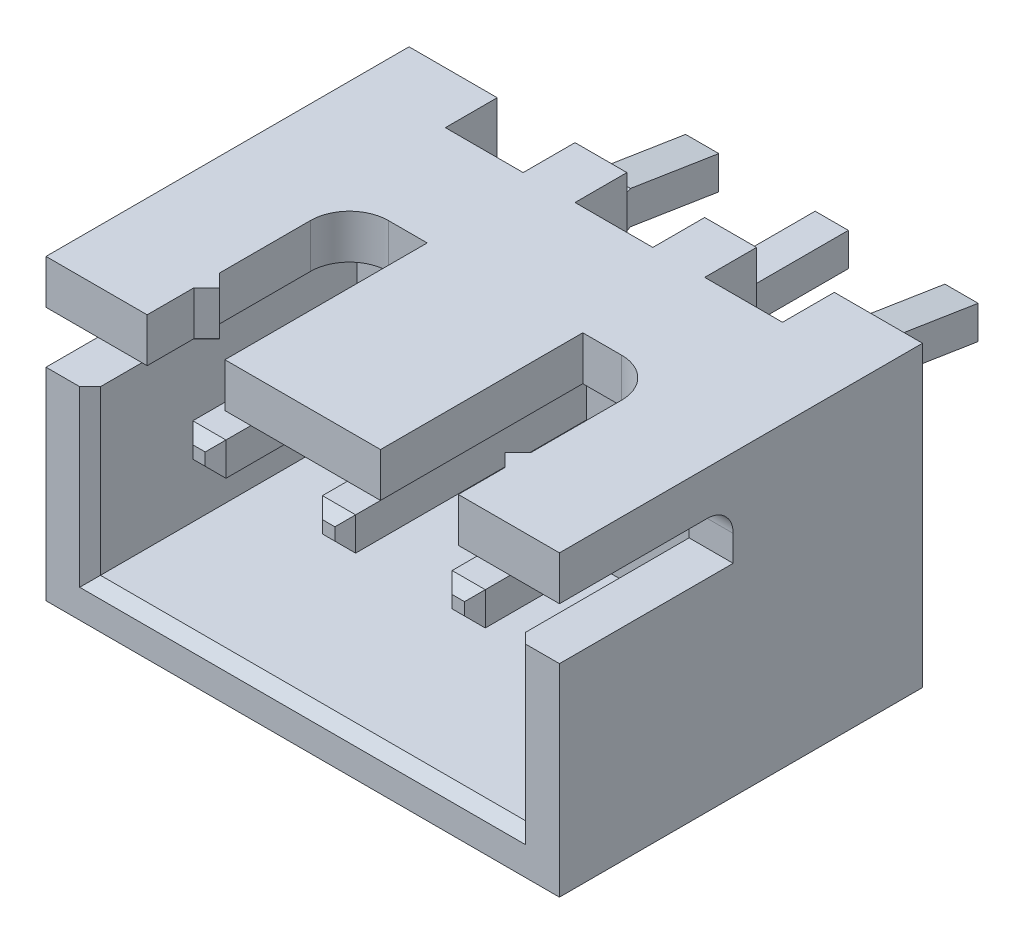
ISO-10303-21;
HEADER;
FILE_DESCRIPTION(('STEP AP214'),'2;1');
FILE_NAME('part.step','',(''),(''),'','','');
FILE_SCHEMA(('AUTOMOTIVE_DESIGN { 1 0 10303 214 1 1 1 1 }'));
ENDSEC;
DATA;
#1=APPLICATION_CONTEXT('core data for automotive mechanical design processes');
#2=APPLICATION_PROTOCOL_DEFINITION('international standard','automotive_design',2000,#1);
#3=PRODUCT_CONTEXT('',#1,'mechanical');
#4=PRODUCT('Part','Part','',(#3));
#5=PRODUCT_RELATED_PRODUCT_CATEGORY('part','',(#4));
#6=PRODUCT_DEFINITION_FORMATION('','',#4);
#7=PRODUCT_DEFINITION_CONTEXT('part definition',#1,'design');
#8=PRODUCT_DEFINITION('design','',#6,#7);
#9=PRODUCT_DEFINITION_SHAPE('','',#8);
#10=(LENGTH_UNIT() NAMED_UNIT(*) SI_UNIT(.MILLI.,.METRE.));
#11=(NAMED_UNIT(*) PLANE_ANGLE_UNIT() SI_UNIT($,.RADIAN.));
#12=(NAMED_UNIT(*) SI_UNIT($,.STERADIAN.) SOLID_ANGLE_UNIT());
#13=UNCERTAINTY_MEASURE_WITH_UNIT(LENGTH_MEASURE(1.E-05),#10,'distance_accuracy_value','');
#14=(GEOMETRIC_REPRESENTATION_CONTEXT(3) GLOBAL_UNCERTAINTY_ASSIGNED_CONTEXT((#13)) GLOBAL_UNIT_ASSIGNED_CONTEXT((#10,
#11,#12)) REPRESENTATION_CONTEXT('',''));
#15=CARTESIAN_POINT('',(0.,0.,0.));
#16=DIRECTION('',(0.,0.,1.));
#17=DIRECTION('',(1.,0.,0.));
#18=AXIS2_PLACEMENT_3D('',#15,#16,#17);
#19=CARTESIAN_POINT('',(5.32,-0.204403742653,-3.301223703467));
#20=DIRECTION('',(0.,-0.760250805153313,-0.649629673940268));
#21=DIRECTION('',(0.,0.649629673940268,-0.760250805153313));
#22=AXIS2_PLACEMENT_3D('',#19,#20,#21);
#23=PLANE('',#22);
#24=DIRECTION('',(-1.,0.,0.));
#25=VECTOR('',#24,1.);
#26=CARTESIAN_POINT('',(5.32,-0.288807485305,-3.202447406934));
#27=LINE('',#26,#25);
#28=CARTESIAN_POINT('',(5.317552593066,-0.288807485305,-3.202447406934));
#29=VERTEX_POINT('',#28);
#30=CARTESIAN_POINT('',(4.682447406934,-0.288807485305,-3.202447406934));
#31=VERTEX_POINT('',#30);
#32=EDGE_CURVE('E1482',#29,#31,#27,.T.);
#33=ORIENTED_EDGE('',*,*,#32,.T.);
#34=DIRECTION('',(-0.605209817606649,-0.5171480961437,0.605209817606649));
#35=VECTOR('',#34,1.);
#36=CARTESIAN_POINT('',(4.961511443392,-0.05034896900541,-3.481511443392));
#37=LINE('',#36,#35);
#38=CARTESIAN_POINT('',(4.88,-0.12,-3.4));
#39=VERTEX_POINT('',#38);
#40=EDGE_CURVE('E1527',#39,#31,#37,.T.);
#41=ORIENTED_EDGE('',*,*,#40,.F.);
#42=DIRECTION('',(-1.,0.,0.));
#43=VECTOR('',#42,1.);
#44=CARTESIAN_POINT('',(5.32,-0.12,-3.4));
#45=LINE('',#44,#43);
#46=CARTESIAN_POINT('',(5.12,-0.12,-3.4));
#47=VERTEX_POINT('',#46);
#48=EDGE_CURVE('E11',#47,#39,#45,.T.);
#49=ORIENTED_EDGE('',*,*,#48,.F.);
#50=DIRECTION('',(0.605209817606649,-0.5171480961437,0.605209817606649));
#51=VECTOR('',#50,1.);
#52=CARTESIAN_POINT('',(5.155697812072,-0.150503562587,-3.364302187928));
#53=LINE('',#52,#51);
#54=EDGE_CURVE('E1481',#47,#29,#53,.T.);
#55=ORIENTED_EDGE('',*,*,#54,.T.);
#56=EDGE_LOOP('',(#33,#41,#49,#55));
#57=FACE_BOUND('',#56,.T.);
#58=ADVANCED_FACE('F17',(#57),#23,.T.);
#59=CARTESIAN_POINT('',(5.32,0.32,-3.4));
#60=DIRECTION('',(0.,0.,1.));
#61=DIRECTION('',(1.,0.,0.));
#62=AXIS2_PLACEMENT_3D('',#59,#60,#61);
#63=PLANE('',#62);
#64=DIRECTION('',(0.,-1.,0.));
#65=VECTOR('',#64,1.);
#66=CARTESIAN_POINT('',(5.12,0.32,-3.4));
#67=LINE('',#66,#65);
#68=CARTESIAN_POINT('',(5.12,0.12,-3.4));
#69=VERTEX_POINT('',#68);
#70=EDGE_CURVE('E1589',#69,#47,#67,.T.);
#71=ORIENTED_EDGE('',*,*,#70,.T.);
#72=ORIENTED_EDGE('',*,*,#48,.T.);
#73=DIRECTION('',(0.,-1.,0.));
#74=VECTOR('',#73,1.);
#75=CARTESIAN_POINT('',(4.88,0.32,-3.4));
#76=LINE('',#75,#74);
#77=CARTESIAN_POINT('',(4.88,0.12,-3.4));
#78=VERTEX_POINT('',#77);
#79=EDGE_CURVE('E1532',#78,#39,#76,.T.);
#80=ORIENTED_EDGE('',*,*,#79,.F.);
#81=DIRECTION('',(-1.,0.,0.));
#82=VECTOR('',#81,1.);
#83=CARTESIAN_POINT('',(5.32,0.12,-3.4));
#84=LINE('',#83,#82);
#85=EDGE_CURVE('E26',#69,#78,#84,.T.);
#86=ORIENTED_EDGE('',*,*,#85,.F.);
#87=EDGE_LOOP('',(#71,#72,#80,#86));
#88=FACE_BOUND('',#87,.T.);
#89=ADVANCED_FACE('F19',(#88),#63,.F.);
#90=CARTESIAN_POINT('',(5.32,0.235596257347,-3.301223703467));
#91=DIRECTION('',(0.,0.649629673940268,-0.760250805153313));
#92=DIRECTION('',(-1.,0.,0.));
#93=AXIS2_PLACEMENT_3D('',#90,#91,#92);
#94=PLANE('',#93);
#95=DIRECTION('',(0.544770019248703,0.637535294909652,0.544770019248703));
#96=VECTOR('',#95,1.);
#97=CARTESIAN_POINT('',(5.24881689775,0.270752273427,-3.27118310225));
#98=LINE('',#97,#96);
#99=CARTESIAN_POINT('',(5.317552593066,0.351192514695,-3.202447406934));
#100=VERTEX_POINT('',#99);
#101=EDGE_CURVE('E1592',#69,#100,#98,.T.);
#102=ORIENTED_EDGE('',*,*,#101,.F.);
#103=ORIENTED_EDGE('',*,*,#85,.T.);
#104=DIRECTION('',(-0.544770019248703,0.637535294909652,0.544770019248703));
#105=VECTOR('',#104,1.);
#106=CARTESIAN_POINT('',(4.846150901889,0.159613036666,-3.366150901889));
#107=LINE('',#106,#105);
#108=CARTESIAN_POINT('',(4.682447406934,0.351192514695,-3.202447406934));
#109=VERTEX_POINT('',#108);
#110=EDGE_CURVE('E1569',#78,#109,#107,.T.);
#111=ORIENTED_EDGE('',*,*,#110,.T.);
#112=DIRECTION('',(-1.,0.,0.));
#113=VECTOR('',#112,1.);
#114=CARTESIAN_POINT('',(5.32,0.351192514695,-3.202447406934));
#115=LINE('',#114,#113);
#116=EDGE_CURVE('E1228',#100,#109,#115,.T.);
#117=ORIENTED_EDGE('',*,*,#116,.F.);
#118=EDGE_LOOP('',(#102,#103,#111,#117));
#119=FACE_BOUND('',#118,.T.);
#120=ADVANCED_FACE('F2165',(#119),#94,.T.);
#121=CARTESIAN_POINT('',(2.82,0.32,-3.4));
#122=DIRECTION('',(0.,0.,1.));
#123=DIRECTION('',(1.,0.,0.));
#124=AXIS2_PLACEMENT_3D('',#121,#122,#123);
#125=PLANE('',#124);
#126=DIRECTION('',(-1.,0.,0.));
#127=VECTOR('',#126,1.);
#128=CARTESIAN_POINT('',(2.82,-0.12,-3.4));
#129=LINE('',#128,#127);
#130=CARTESIAN_POINT('',(2.62,-0.12,-3.4));
#131=VERTEX_POINT('',#130);
#132=CARTESIAN_POINT('',(2.38,-0.12,-3.4));
#133=VERTEX_POINT('',#132);
#134=EDGE_CURVE('E1554',#131,#133,#129,.T.);
#135=ORIENTED_EDGE('',*,*,#134,.T.);
#136=DIRECTION('',(0.,-1.,0.));
#137=VECTOR('',#136,1.);
#138=CARTESIAN_POINT('',(2.38,0.32,-3.4));
#139=LINE('',#138,#137);
#140=CARTESIAN_POINT('',(2.38,0.12,-3.4));
#141=VERTEX_POINT('',#140);
#142=EDGE_CURVE('E1547',#141,#133,#139,.T.);
#143=ORIENTED_EDGE('',*,*,#142,.F.);
#144=DIRECTION('',(-1.,0.,0.));
#145=VECTOR('',#144,1.);
#146=CARTESIAN_POINT('',(2.82,0.12,-3.4));
#147=LINE('',#146,#145);
#148=CARTESIAN_POINT('',(2.62,0.12,-3.4));
#149=VERTEX_POINT('',#148);
#150=EDGE_CURVE('E1566',#149,#141,#147,.T.);
#151=ORIENTED_EDGE('',*,*,#150,.F.);
#152=DIRECTION('',(0.,-1.,0.));
#153=VECTOR('',#152,1.);
#154=CARTESIAN_POINT('',(2.62,0.32,-3.4));
#155=LINE('',#154,#153);
#156=EDGE_CURVE('E1560',#149,#131,#155,.T.);
#157=ORIENTED_EDGE('',*,*,#156,.T.);
#158=EDGE_LOOP('',(#135,#143,#151,#157));
#159=FACE_BOUND('',#158,.T.);
#160=ADVANCED_FACE('F2366',(#159),#125,.F.);
#161=CARTESIAN_POINT('',(0.32,-0.204403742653,-3.301223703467));
#162=DIRECTION('',(0.,-0.760250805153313,-0.649629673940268));
#163=DIRECTION('',(0.,0.649629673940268,-0.760250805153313));
#164=AXIS2_PLACEMENT_3D('',#161,#162,#163);
#165=PLANE('',#164);
#166=DIRECTION('',(-1.,0.,0.));
#167=VECTOR('',#166,1.);
#168=CARTESIAN_POINT('',(0.32,-0.288807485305,-3.202447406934));
#169=LINE('',#168,#167);
#170=CARTESIAN_POINT('',(0.317552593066,-0.288807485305,-3.202447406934));
#171=VERTEX_POINT('',#170);
#172=CARTESIAN_POINT('',(-0.317552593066,-0.288807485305,-3.202447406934));
#173=VERTEX_POINT('',#172);
#174=EDGE_CURVE('E1539',#171,#173,#169,.T.);
#175=ORIENTED_EDGE('',*,*,#174,.T.);
#176=DIRECTION('',(-0.605209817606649,-0.5171480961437,0.605209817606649));
#177=VECTOR('',#176,1.);
#178=CARTESIAN_POINT('',(-0.03848855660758,-0.05034896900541,-3.481511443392));
#179=LINE('',#178,#177);
#180=CARTESIAN_POINT('',(-0.12,-0.12,-3.4));
#181=VERTEX_POINT('',#180);
#182=EDGE_CURVE('E1513',#181,#173,#179,.T.);
#183=ORIENTED_EDGE('',*,*,#182,.F.);
#184=DIRECTION('',(-1.,0.,0.));
#185=VECTOR('',#184,1.);
#186=CARTESIAN_POINT('',(0.32,-0.12,-3.4));
#187=LINE('',#186,#185);
#188=CARTESIAN_POINT('',(0.12,-0.12,-3.4));
#189=VERTEX_POINT('',#188);
#190=EDGE_CURVE('E1450',#189,#181,#187,.T.);
#191=ORIENTED_EDGE('',*,*,#190,.F.);
#192=DIRECTION('',(0.605209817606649,-0.5171480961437,0.605209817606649));
#193=VECTOR('',#192,1.);
#194=CARTESIAN_POINT('',(0.155697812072,-0.150503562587,-3.364302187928));
#195=LINE('',#194,#193);
#196=EDGE_CURVE('E1416',#189,#171,#195,.T.);
#197=ORIENTED_EDGE('',*,*,#196,.T.);
#198=EDGE_LOOP('',(#175,#183,#191,#197));
#199=FACE_BOUND('',#198,.T.);
#200=ADVANCED_FACE('F1607',(#199),#165,.T.);
#201=CARTESIAN_POINT('',(0.32,0.32,-3.4));
#202=DIRECTION('',(0.,0.,1.));
#203=DIRECTION('',(1.,0.,0.));
#204=AXIS2_PLACEMENT_3D('',#201,#202,#203);
#205=PLANE('',#204);
#206=DIRECTION('',(0.,-1.,0.));
#207=VECTOR('',#206,1.);
#208=CARTESIAN_POINT('',(0.12,0.32,-3.4));
#209=LINE('',#208,#207);
#210=CARTESIAN_POINT('',(0.12,0.12,-3.4));
#211=VERTEX_POINT('',#210);
#212=EDGE_CURVE('E1411',#211,#189,#209,.T.);
#213=ORIENTED_EDGE('',*,*,#212,.T.);
#214=ORIENTED_EDGE('',*,*,#190,.T.);
#215=DIRECTION('',(0.,-1.,0.));
#216=VECTOR('',#215,1.);
#217=CARTESIAN_POINT('',(-0.12,0.32,-3.4));
#218=LINE('',#217,#216);
#219=CARTESIAN_POINT('',(-0.12,0.12,-3.4));
#220=VERTEX_POINT('',#219);
#221=EDGE_CURVE('E1509',#220,#181,#218,.T.);
#222=ORIENTED_EDGE('',*,*,#221,.F.);
#223=DIRECTION('',(-1.,0.,0.));
#224=VECTOR('',#223,1.);
#225=CARTESIAN_POINT('',(0.32,0.12,-3.4));
#226=LINE('',#225,#224);
#227=EDGE_CURVE('E1595',#211,#220,#226,.T.);
#228=ORIENTED_EDGE('',*,*,#227,.F.);
#229=EDGE_LOOP('',(#213,#214,#222,#228));
#230=FACE_BOUND('',#229,.T.);
#231=ADVANCED_FACE('F1602',(#230),#205,.F.);
#232=CARTESIAN_POINT('',(0.32,0.235596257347,-3.301223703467));
#233=DIRECTION('',(0.,0.649629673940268,-0.760250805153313));
#234=DIRECTION('',(-1.,0.,0.));
#235=AXIS2_PLACEMENT_3D('',#232,#233,#234);
#236=PLANE('',#235);
#237=DIRECTION('',(0.544770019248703,0.637535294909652,0.544770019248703));
#238=VECTOR('',#237,1.);
#239=CARTESIAN_POINT('',(0.24881689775,0.270752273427,-3.27118310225));
#240=LINE('',#239,#238);
#241=CARTESIAN_POINT('',(0.317552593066,0.351192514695,-3.202447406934));
#242=VERTEX_POINT('',#241);
#243=EDGE_CURVE('E1415',#211,#242,#240,.T.);
#244=ORIENTED_EDGE('',*,*,#243,.F.);
#245=ORIENTED_EDGE('',*,*,#227,.T.);
#246=DIRECTION('',(-0.544770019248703,0.637535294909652,0.544770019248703));
#247=VECTOR('',#246,1.);
#248=CARTESIAN_POINT('',(-0.153849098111,0.159613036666,-3.366150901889));
#249=LINE('',#248,#247);
#250=CARTESIAN_POINT('',(-0.317552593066,0.351192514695,-3.202447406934));
#251=VERTEX_POINT('',#250);
#252=EDGE_CURVE('E1505',#220,#251,#249,.T.);
#253=ORIENTED_EDGE('',*,*,#252,.T.);
#254=DIRECTION('',(-1.,0.,0.));
#255=VECTOR('',#254,1.);
#256=CARTESIAN_POINT('',(0.32,0.351192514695,-3.202447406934));
#257=LINE('',#256,#255);
#258=EDGE_CURVE('E1526',#242,#251,#257,.T.);
#259=ORIENTED_EDGE('',*,*,#258,.F.);
#260=EDGE_LOOP('',(#244,#245,#253,#259));
#261=FACE_BOUND('',#260,.T.);
#262=ADVANCED_FACE('F1617',(#261),#236,.T.);
#263=CARTESIAN_POINT('',(2.82,-0.32,6.5));
#264=DIRECTION('',(0.,0.,-1.));
#265=DIRECTION('',(0.,-1.,0.));
#266=AXIS2_PLACEMENT_3D('',#263,#264,#265);
#267=PLANE('',#266);
#268=DIRECTION('',(0.,1.,0.));
#269=VECTOR('',#268,1.);
#270=CARTESIAN_POINT('',(2.38,-0.32,6.5));
#271=LINE('',#270,#269);
#272=CARTESIAN_POINT('',(2.38,-0.12,6.5));
#273=VERTEX_POINT('',#272);
#274=CARTESIAN_POINT('',(2.38,0.12,6.5));
#275=VERTEX_POINT('',#274);
#276=EDGE_CURVE('E969',#273,#275,#271,.T.);
#277=ORIENTED_EDGE('',*,*,#276,.F.);
#278=DIRECTION('',(-1.,0.,0.));
#279=VECTOR('',#278,1.);
#280=CARTESIAN_POINT('',(2.82,-0.12,6.5));
#281=LINE('',#280,#279);
#282=CARTESIAN_POINT('',(2.62,-0.12,6.5));
#283=VERTEX_POINT('',#282);
#284=EDGE_CURVE('E968',#283,#273,#281,.T.);
#285=ORIENTED_EDGE('',*,*,#284,.F.);
#286=DIRECTION('',(0.,1.,0.));
#287=VECTOR('',#286,1.);
#288=CARTESIAN_POINT('',(2.62,-0.32,6.5));
#289=LINE('',#288,#287);
#290=CARTESIAN_POINT('',(2.62,0.12,6.5));
#291=VERTEX_POINT('',#290);
#292=EDGE_CURVE('E1498',#283,#291,#289,.T.);
#293=ORIENTED_EDGE('',*,*,#292,.T.);
#294=DIRECTION('',(-1.,0.,0.));
#295=VECTOR('',#294,1.);
#296=CARTESIAN_POINT('',(2.82,0.12,6.5));
#297=LINE('',#296,#295);
#298=EDGE_CURVE('E1502',#291,#275,#297,.T.);
#299=ORIENTED_EDGE('',*,*,#298,.T.);
#300=EDGE_LOOP('',(#277,#285,#293,#299));
#301=FACE_BOUND('',#300,.T.);
#302=ADVANCED_FACE('F2229',(#301),#267,.F.);
#303=CARTESIAN_POINT('',(5.32,-0.32,6.5));
#304=DIRECTION('',(0.,0.,-1.));
#305=DIRECTION('',(0.,-1.,0.));
#306=AXIS2_PLACEMENT_3D('',#303,#304,#305);
#307=PLANE('',#306);
#308=DIRECTION('',(-1.,0.,0.));
#309=VECTOR('',#308,1.);
#310=CARTESIAN_POINT('',(5.32,-0.12,6.5));
#311=LINE('',#310,#309);
#312=CARTESIAN_POINT('',(5.12,-0.12,6.5));
#313=VERTEX_POINT('',#312);
#314=CARTESIAN_POINT('',(4.88,-0.12,6.5));
#315=VERTEX_POINT('',#314);
#316=EDGE_CURVE('E1471',#313,#315,#311,.T.);
#317=ORIENTED_EDGE('',*,*,#316,.F.);
#318=DIRECTION('',(0.,1.,0.));
#319=VECTOR('',#318,1.);
#320=CARTESIAN_POINT('',(5.12,-0.32,6.5));
#321=LINE('',#320,#319);
#322=CARTESIAN_POINT('',(5.12,0.12,6.5));
#323=VERTEX_POINT('',#322);
#324=EDGE_CURVE('E1485',#313,#323,#321,.T.);
#325=ORIENTED_EDGE('',*,*,#324,.T.);
#326=DIRECTION('',(-1.,0.,0.));
#327=VECTOR('',#326,1.);
#328=CARTESIAN_POINT('',(5.32,0.12,6.5));
#329=LINE('',#328,#327);
#330=CARTESIAN_POINT('',(4.88,0.12,6.5));
#331=VERTEX_POINT('',#330);
#332=EDGE_CURVE('E1392',#323,#331,#329,.T.);
#333=ORIENTED_EDGE('',*,*,#332,.T.);
#334=DIRECTION('',(0.,1.,0.));
#335=VECTOR('',#334,1.);
#336=CARTESIAN_POINT('',(4.88,-0.32,6.5));
#337=LINE('',#336,#335);
#338=EDGE_CURVE('E1464',#315,#331,#337,.T.);
#339=ORIENTED_EDGE('',*,*,#338,.F.);
#340=EDGE_LOOP('',(#317,#325,#333,#339));
#341=FACE_BOUND('',#340,.T.);
#342=ADVANCED_FACE('F3401',(#341),#307,.F.);
#343=CARTESIAN_POINT('',(0.32,-0.32,6.5));
#344=DIRECTION('',(0.,0.,-1.));
#345=DIRECTION('',(0.,-1.,0.));
#346=AXIS2_PLACEMENT_3D('',#343,#344,#345);
#347=PLANE('',#346);
#348=DIRECTION('',(-1.,0.,0.));
#349=VECTOR('',#348,1.);
#350=CARTESIAN_POINT('',(0.32,-0.12,6.5));
#351=LINE('',#350,#349);
#352=CARTESIAN_POINT('',(0.12,-0.12,6.5));
#353=VERTEX_POINT('',#352);
#354=CARTESIAN_POINT('',(-0.12,-0.12,6.5));
#355=VERTEX_POINT('',#354);
#356=EDGE_CURVE('E1447',#353,#355,#351,.T.);
#357=ORIENTED_EDGE('',*,*,#356,.F.);
#358=DIRECTION('',(0.,1.,0.));
#359=VECTOR('',#358,1.);
#360=CARTESIAN_POINT('',(0.12,-0.32,6.5));
#361=LINE('',#360,#359);
#362=CARTESIAN_POINT('',(0.12,0.12,6.5));
#363=VERTEX_POINT('',#362);
#364=EDGE_CURVE('E1361',#353,#363,#361,.T.);
#365=ORIENTED_EDGE('',*,*,#364,.T.);
#366=DIRECTION('',(-1.,0.,0.));
#367=VECTOR('',#366,1.);
#368=CARTESIAN_POINT('',(0.32,0.12,6.5));
#369=LINE('',#368,#367);
#370=CARTESIAN_POINT('',(-0.12,0.12,6.5));
#371=VERTEX_POINT('',#370);
#372=EDGE_CURVE('E1357',#363,#371,#369,.T.);
#373=ORIENTED_EDGE('',*,*,#372,.T.);
#374=DIRECTION('',(0.,1.,0.));
#375=VECTOR('',#374,1.);
#376=CARTESIAN_POINT('',(-0.12,-0.32,6.5));
#377=LINE('',#376,#375);
#378=EDGE_CURVE('E1170',#355,#371,#377,.T.);
#379=ORIENTED_EDGE('',*,*,#378,.F.);
#380=EDGE_LOOP('',(#357,#365,#373,#379));
#381=FACE_BOUND('',#380,.T.);
#382=ADVANCED_FACE('F2442',(#381),#347,.F.);
#383=CARTESIAN_POINT('',(5.22,0.32,-3.3));
#384=DIRECTION('',(0.707106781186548,0.,-0.707106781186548));
#385=DIRECTION('',(0.,-1.,0.));
#386=AXIS2_PLACEMENT_3D('',#383,#384,#385);
#387=PLANE('',#386);
#388=DIRECTION('',(0.702740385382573,0.110959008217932,0.702740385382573));
#389=VECTOR('',#388,1.);
#390=CARTESIAN_POINT('',(5.699616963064,0.411518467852,-2.820383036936));
#391=LINE('',#390,#389);
#392=CARTESIAN_POINT('',(5.32,0.351578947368,-3.2));
#393=VERTEX_POINT('',#392);
#394=EDGE_CURVE('E1232',#100,#393,#391,.T.);
#395=ORIENTED_EDGE('',*,*,#394,.T.);
#396=DIRECTION('',(0.,-1.,0.));
#397=VECTOR('',#396,1.);
#398=CARTESIAN_POINT('',(5.32,0.32,-3.2));
#399=LINE('',#398,#397);
#400=CARTESIAN_POINT('',(5.32,-0.288421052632,-3.2));
#401=VERTEX_POINT('',#400);
#402=EDGE_CURVE('E1304',#393,#401,#399,.T.);
#403=ORIENTED_EDGE('',*,*,#402,.T.);
#404=DIRECTION('',(0.702740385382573,0.110959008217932,0.702740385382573));
#405=VECTOR('',#404,1.);
#406=CARTESIAN_POINT('',(5.243720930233,-0.300465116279,-3.276279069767));
#407=LINE('',#406,#405);
#408=EDGE_CURVE('E1478',#29,#401,#407,.T.);
#409=ORIENTED_EDGE('',*,*,#408,.F.);
#410=ORIENTED_EDGE('',*,*,#54,.F.);
#411=ORIENTED_EDGE('',*,*,#70,.F.);
#412=ORIENTED_EDGE('',*,*,#101,.T.);
#413=EDGE_LOOP('',(#395,#403,#409,#410,#411,#412));
#414=FACE_BOUND('',#413,.T.);
#415=ADVANCED_FACE('F2359',(#414),#387,.T.);
#416=CARTESIAN_POINT('',(5.32,-0.32,-3.4));
#417=DIRECTION('',(0.,0.987762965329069,-0.155962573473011));
#418=DIRECTION('',(-1.,0.,0.));
#419=AXIS2_PLACEMENT_3D('',#416,#417,#418);
#420=PLANE('',#419);
#421=DIRECTION('',(-1.,0.,0.));
#422=VECTOR('',#421,1.);
#423=CARTESIAN_POINT('',(5.32,-0.02,-1.5));
#424=LINE('',#423,#422);
#425=CARTESIAN_POINT('',(5.32,-0.02,-1.5));
#426=VERTEX_POINT('',#425);
#427=CARTESIAN_POINT('',(4.68,-0.02,-1.5));
#428=VERTEX_POINT('',#427);
#429=EDGE_CURVE('E1440',#426,#428,#424,.T.);
#430=ORIENTED_EDGE('',*,*,#429,.T.);
#431=DIRECTION('',(0.,0.155962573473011,0.987762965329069));
#432=VECTOR('',#431,1.);
#433=CARTESIAN_POINT('',(4.68,-0.32,-3.4));
#434=LINE('',#433,#432);
#435=CARTESIAN_POINT('',(4.68,-0.288421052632,-3.2));
#436=VERTEX_POINT('',#435);
#437=EDGE_CURVE('E1380',#436,#428,#434,.T.);
#438=ORIENTED_EDGE('',*,*,#437,.F.);
#439=DIRECTION('',(-0.702740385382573,0.110959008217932,0.702740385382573));
#440=VECTOR('',#439,1.);
#441=CARTESIAN_POINT('',(4.914309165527,-0.325417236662,-3.434309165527));
#442=LINE('',#441,#440);
#443=EDGE_CURVE('E1531',#31,#436,#442,.T.);
#444=ORIENTED_EDGE('',*,*,#443,.F.);
#445=ORIENTED_EDGE('',*,*,#32,.F.);
#446=ORIENTED_EDGE('',*,*,#408,.T.);
#447=DIRECTION('',(0.,0.155962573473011,0.987762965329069));
#448=VECTOR('',#447,1.);
#449=CARTESIAN_POINT('',(5.32,-0.32,-3.4));
#450=LINE('',#449,#448);
#451=EDGE_CURVE('E1308',#401,#426,#450,.T.);
#452=ORIENTED_EDGE('',*,*,#451,.T.);
#453=EDGE_LOOP('',(#430,#438,#444,#445,#446,#452));
#454=FACE_BOUND('',#453,.T.);
#455=ADVANCED_FACE('F2355',(#454),#420,.F.);
#456=CARTESIAN_POINT('',(5.32,-0.02,-1.5));
#457=DIRECTION('',(0.,0.894427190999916,0.447213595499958));
#458=DIRECTION('',(1.,0.,0.));
#459=AXIS2_PLACEMENT_3D('',#456,#457,#458);
#460=PLANE('',#459);
#461=DIRECTION('',(0.,-0.447213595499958,0.894427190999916));
#462=VECTOR('',#461,1.);
#463=CARTESIAN_POINT('',(5.32,-0.02,-1.5));
#464=LINE('',#463,#462);
#465=CARTESIAN_POINT('',(5.32,-0.32,-0.9));
#466=VERTEX_POINT('',#465);
#467=EDGE_CURVE('E1342',#426,#466,#464,.T.);
#468=ORIENTED_EDGE('',*,*,#467,.T.);
#469=DIRECTION('',(-1.,0.,0.));
#470=VECTOR('',#469,1.);
#471=CARTESIAN_POINT('',(5.32,-0.32,-0.9));
#472=LINE('',#471,#470);
#473=CARTESIAN_POINT('',(4.68,-0.32,-0.9));
#474=VERTEX_POINT('',#473);
#475=EDGE_CURVE('E1407',#466,#474,#472,.T.);
#476=ORIENTED_EDGE('',*,*,#475,.T.);
#477=DIRECTION('',(0.,-0.447213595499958,0.894427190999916));
#478=VECTOR('',#477,1.);
#479=CARTESIAN_POINT('',(4.68,-0.02,-1.5));
#480=LINE('',#479,#478);
#481=EDGE_CURVE('E1384',#428,#474,#480,.T.);
#482=ORIENTED_EDGE('',*,*,#481,.F.);
#483=ORIENTED_EDGE('',*,*,#429,.F.);
#484=EDGE_LOOP('',(#468,#476,#482,#483));
#485=FACE_BOUND('',#484,.T.);
#486=ADVANCED_FACE('F2358',(#485),#460,.F.);
#487=CARTESIAN_POINT('',(5.32,0.32,-0.9));
#488=DIRECTION('',(0.,-0.894427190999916,-0.447213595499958));
#489=DIRECTION('',(0.,0.447213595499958,-0.894427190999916));
#490=AXIS2_PLACEMENT_3D('',#487,#488,#489);
#491=PLANE('',#490);
#492=DIRECTION('',(0.,0.447213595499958,-0.894427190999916));
#493=VECTOR('',#492,1.);
#494=CARTESIAN_POINT('',(5.32,0.32,-0.9));
#495=LINE('',#494,#493);
#496=CARTESIAN_POINT('',(5.32,0.32,-0.9));
#497=VERTEX_POINT('',#496);
#498=CARTESIAN_POINT('',(5.32,0.62,-1.5));
#499=VERTEX_POINT('',#498);
#500=EDGE_CURVE('E1423',#497,#499,#495,.T.);
#501=ORIENTED_EDGE('',*,*,#500,.T.);
#502=DIRECTION('',(-1.,0.,0.));
#503=VECTOR('',#502,1.);
#504=CARTESIAN_POINT('',(5.32,0.62,-1.5));
#505=LINE('',#504,#503);
#506=CARTESIAN_POINT('',(4.68,0.62,-1.5));
#507=VERTEX_POINT('',#506);
#508=EDGE_CURVE('E1231',#499,#507,#505,.T.);
#509=ORIENTED_EDGE('',*,*,#508,.T.);
#510=DIRECTION('',(0.,0.447213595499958,-0.894427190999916));
#511=VECTOR('',#510,1.);
#512=CARTESIAN_POINT('',(4.68,0.32,-0.9));
#513=LINE('',#512,#511);
#514=CARTESIAN_POINT('',(4.68,0.32,-0.9));
#515=VERTEX_POINT('',#514);
#516=EDGE_CURVE('E1399',#515,#507,#513,.T.);
#517=ORIENTED_EDGE('',*,*,#516,.F.);
#518=DIRECTION('',(-1.,0.,0.));
#519=VECTOR('',#518,1.);
#520=CARTESIAN_POINT('',(5.32,0.32,-0.9));
#521=LINE('',#520,#519);
#522=EDGE_CURVE('E1171',#497,#515,#521,.T.);
#523=ORIENTED_EDGE('',*,*,#522,.F.);
#524=EDGE_LOOP('',(#501,#509,#517,#523));
#525=FACE_BOUND('',#524,.T.);
#526=ADVANCED_FACE('F3165',(#525),#491,.F.);
#527=CARTESIAN_POINT('',(5.32,0.62,-1.5));
#528=DIRECTION('',(0.,-0.987762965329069,0.155962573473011));
#529=DIRECTION('',(-1.,0.,0.));
#530=AXIS2_PLACEMENT_3D('',#527,#528,#529);
#531=PLANE('',#530);
#532=ORIENTED_EDGE('',*,*,#394,.F.);
#533=ORIENTED_EDGE('',*,*,#116,.T.);
#534=DIRECTION('',(-0.702740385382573,0.110959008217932,0.702740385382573));
#535=VECTOR('',#534,1.);
#536=CARTESIAN_POINT('',(4.458413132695,0.386566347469,-2.978413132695));
#537=LINE('',#536,#535);
#538=CARTESIAN_POINT('',(4.68,0.351578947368,-3.2));
#539=VERTEX_POINT('',#538);
#540=EDGE_CURVE('E1578',#109,#539,#537,.T.);
#541=ORIENTED_EDGE('',*,*,#540,.T.);
#542=DIRECTION('',(0.,-0.155962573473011,-0.987762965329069));
#543=VECTOR('',#542,1.);
#544=CARTESIAN_POINT('',(4.68,0.62,-1.5));
#545=LINE('',#544,#543);
#546=EDGE_CURVE('E1403',#507,#539,#545,.T.);
#547=ORIENTED_EDGE('',*,*,#546,.F.);
#548=ORIENTED_EDGE('',*,*,#508,.F.);
#549=DIRECTION('',(0.,-0.155962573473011,-0.987762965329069));
#550=VECTOR('',#549,1.);
#551=CARTESIAN_POINT('',(5.32,0.62,-1.5));
#552=LINE('',#551,#550);
#553=EDGE_CURVE('E1419',#499,#393,#552,.T.);
#554=ORIENTED_EDGE('',*,*,#553,.T.);
#555=EDGE_LOOP('',(#532,#533,#541,#547,#548,#554));
#556=FACE_BOUND('',#555,.T.);
#557=ADVANCED_FACE('F3170',(#556),#531,.F.);
#558=CARTESIAN_POINT('',(4.78,0.32,-3.3));
#559=DIRECTION('',(0.707106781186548,0.,0.707106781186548));
#560=DIRECTION('',(0.,-1.,0.));
#561=AXIS2_PLACEMENT_3D('',#558,#559,#560);
#562=PLANE('',#561);
#563=ORIENTED_EDGE('',*,*,#110,.F.);
#564=ORIENTED_EDGE('',*,*,#79,.T.);
#565=ORIENTED_EDGE('',*,*,#40,.T.);
#566=ORIENTED_EDGE('',*,*,#443,.T.);
#567=DIRECTION('',(0.,-1.,0.));
#568=VECTOR('',#567,1.);
#569=CARTESIAN_POINT('',(4.68,0.32,-3.2));
#570=LINE('',#569,#568);
#571=EDGE_CURVE('E1376',#539,#436,#570,.T.);
#572=ORIENTED_EDGE('',*,*,#571,.F.);
#573=ORIENTED_EDGE('',*,*,#540,.F.);
#574=EDGE_LOOP('',(#563,#564,#565,#566,#572,#573));
#575=FACE_BOUND('',#574,.T.);
#576=ADVANCED_FACE('F3423',(#575),#562,.F.);
#577=CARTESIAN_POINT('',(2.82,0.22,-3.3));
#578=DIRECTION('',(0.,0.707106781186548,-0.707106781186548));
#579=DIRECTION('',(-1.,0.,0.));
#580=AXIS2_PLACEMENT_3D('',#577,#578,#579);
#581=PLANE('',#580);
#582=DIRECTION('',(0.577350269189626,0.577350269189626,0.577350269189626));
#583=VECTOR('',#582,1.);
#584=CARTESIAN_POINT('',(2.753333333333,0.253333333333,-3.266666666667));
#585=LINE('',#584,#583);
#586=CARTESIAN_POINT('',(2.82,0.32,-3.2));
#587=VERTEX_POINT('',#586);
#588=EDGE_CURVE('E1563',#149,#587,#585,.T.);
#589=ORIENTED_EDGE('',*,*,#588,.F.);
#590=ORIENTED_EDGE('',*,*,#150,.T.);
#591=DIRECTION('',(-0.577350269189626,0.577350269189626,0.577350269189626));
#592=VECTOR('',#591,1.);
#593=CARTESIAN_POINT('',(2.353333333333,0.146666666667,-3.373333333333));
#594=LINE('',#593,#592);
#595=CARTESIAN_POINT('',(2.18,0.32,-3.2));
#596=VERTEX_POINT('',#595);
#597=EDGE_CURVE('E1544',#141,#596,#594,.T.);
#598=ORIENTED_EDGE('',*,*,#597,.T.);
#599=DIRECTION('',(-1.,0.,0.));
#600=VECTOR('',#599,1.);
#601=CARTESIAN_POINT('',(2.82,0.32,-3.2));
#602=LINE('',#601,#600);
#603=EDGE_CURVE('E1372',#587,#596,#602,.T.);
#604=ORIENTED_EDGE('',*,*,#603,.F.);
#605=EDGE_LOOP('',(#589,#590,#598,#604));
#606=FACE_BOUND('',#605,.T.);
#607=ADVANCED_FACE('F3412',(#606),#581,.T.);
#608=CARTESIAN_POINT('',(2.72,0.32,-3.3));
#609=DIRECTION('',(0.707106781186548,0.,-0.707106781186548));
#610=DIRECTION('',(0.,-1.,0.));
#611=AXIS2_PLACEMENT_3D('',#608,#609,#610);
#612=PLANE('',#611);
#613=DIRECTION('',(0.,-1.,0.));
#614=VECTOR('',#613,1.);
#615=CARTESIAN_POINT('',(2.82,0.32,-3.2));
#616=LINE('',#615,#614);
#617=CARTESIAN_POINT('',(2.82,-0.32,-3.2));
#618=VERTEX_POINT('',#617);
#619=EDGE_CURVE('E1368',#587,#618,#616,.T.);
#620=ORIENTED_EDGE('',*,*,#619,.T.);
#621=DIRECTION('',(0.577350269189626,-0.577350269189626,0.577350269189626));
#622=VECTOR('',#621,1.);
#623=CARTESIAN_POINT('',(2.646666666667,-0.146666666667,-3.373333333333));
#624=LINE('',#623,#622);
#625=EDGE_CURVE('E1557',#131,#618,#624,.T.);
#626=ORIENTED_EDGE('',*,*,#625,.F.);
#627=ORIENTED_EDGE('',*,*,#156,.F.);
#628=ORIENTED_EDGE('',*,*,#588,.T.);
#629=EDGE_LOOP('',(#620,#626,#627,#628));
#630=FACE_BOUND('',#629,.T.);
#631=ADVANCED_FACE('F2380',(#630),#612,.T.);
#632=CARTESIAN_POINT('',(2.82,-0.22,-3.3));
#633=DIRECTION('',(0.,-0.707106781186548,-0.707106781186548));
#634=DIRECTION('',(0.,-0.707106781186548,0.707106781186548));
#635=AXIS2_PLACEMENT_3D('',#632,#633,#634);
#636=PLANE('',#635);
#637=DIRECTION('',(-1.,0.,0.));
#638=VECTOR('',#637,1.);
#639=CARTESIAN_POINT('',(2.82,-0.32,-3.2));
#640=LINE('',#639,#638);
#641=CARTESIAN_POINT('',(2.18,-0.32,-3.2));
#642=VERTEX_POINT('',#641);
#643=EDGE_CURVE('E1280',#618,#642,#640,.T.);
#644=ORIENTED_EDGE('',*,*,#643,.T.);
#645=DIRECTION('',(-0.577350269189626,-0.577350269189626,0.577350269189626));
#646=VECTOR('',#645,1.);
#647=CARTESIAN_POINT('',(2.46,-0.04,-3.48));
#648=LINE('',#647,#646);
#649=EDGE_CURVE('E1551',#133,#642,#648,.T.);
#650=ORIENTED_EDGE('',*,*,#649,.F.);
#651=ORIENTED_EDGE('',*,*,#134,.F.);
#652=ORIENTED_EDGE('',*,*,#625,.T.);
#653=EDGE_LOOP('',(#644,#650,#651,#652));
#654=FACE_BOUND('',#653,.T.);
#655=ADVANCED_FACE('F2376',(#654),#636,.T.);
#656=CARTESIAN_POINT('',(2.28,0.32,-3.3));
#657=DIRECTION('',(0.707106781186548,0.,0.707106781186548));
#658=DIRECTION('',(0.,-1.,0.));
#659=AXIS2_PLACEMENT_3D('',#656,#657,#658);
#660=PLANE('',#659);
#661=ORIENTED_EDGE('',*,*,#597,.F.);
#662=ORIENTED_EDGE('',*,*,#142,.T.);
#663=ORIENTED_EDGE('',*,*,#649,.T.);
#664=DIRECTION('',(0.,-1.,0.));
#665=VECTOR('',#664,1.);
#666=CARTESIAN_POINT('',(2.18,0.32,-3.2));
#667=LINE('',#666,#665);
#668=EDGE_CURVE('E1251',#596,#642,#667,.T.);
#669=ORIENTED_EDGE('',*,*,#668,.F.);
#670=EDGE_LOOP('',(#661,#662,#663,#669));
#671=FACE_BOUND('',#670,.T.);
#672=ADVANCED_FACE('F2379',(#671),#660,.F.);
#673=CARTESIAN_POINT('',(0.22,0.32,-3.3));
#674=DIRECTION('',(0.707106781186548,0.,-0.707106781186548));
#675=DIRECTION('',(0.,-1.,0.));
#676=AXIS2_PLACEMENT_3D('',#673,#674,#675);
#677=PLANE('',#676);
#678=DIRECTION('',(0.702740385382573,0.110959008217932,0.702740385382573));
#679=VECTOR('',#678,1.);
#680=CARTESIAN_POINT('',(0.699616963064,0.411518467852,-2.820383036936));
#681=LINE('',#680,#679);
#682=CARTESIAN_POINT('',(0.32,0.351578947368,-3.2));
#683=VERTEX_POINT('',#682);
#684=EDGE_CURVE('E1523',#242,#683,#681,.T.);
#685=ORIENTED_EDGE('',*,*,#684,.T.);
#686=DIRECTION('',(0.,-1.,0.));
#687=VECTOR('',#686,1.);
#688=CARTESIAN_POINT('',(0.32,0.32,-3.2));
#689=LINE('',#688,#687);
#690=CARTESIAN_POINT('',(0.32,-0.288421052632,-3.2));
#691=VERTEX_POINT('',#690);
#692=EDGE_CURVE('E1335',#683,#691,#689,.T.);
#693=ORIENTED_EDGE('',*,*,#692,.T.);
#694=DIRECTION('',(0.702740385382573,0.110959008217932,0.702740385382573));
#695=VECTOR('',#694,1.);
#696=CARTESIAN_POINT('',(0.243720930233,-0.300465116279,-3.276279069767));
#697=LINE('',#696,#695);
#698=EDGE_CURVE('E1426',#171,#691,#697,.T.);
#699=ORIENTED_EDGE('',*,*,#698,.F.);
#700=ORIENTED_EDGE('',*,*,#196,.F.);
#701=ORIENTED_EDGE('',*,*,#212,.F.);
#702=ORIENTED_EDGE('',*,*,#243,.T.);
#703=EDGE_LOOP('',(#685,#693,#699,#700,#701,#702));
#704=FACE_BOUND('',#703,.T.);
#705=ADVANCED_FACE('F1620',(#704),#677,.T.);
#706=CARTESIAN_POINT('',(0.32,-0.32,-3.4));
#707=DIRECTION('',(0.,0.987762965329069,-0.155962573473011));
#708=DIRECTION('',(-1.,0.,0.));
#709=AXIS2_PLACEMENT_3D('',#706,#707,#708);
#710=PLANE('',#709);
#711=DIRECTION('',(-1.,0.,0.));
#712=VECTOR('',#711,1.);
#713=CARTESIAN_POINT('',(0.32,-0.02,-1.5));
#714=LINE('',#713,#712);
#715=CARTESIAN_POINT('',(0.32,-0.02,-1.5));
#716=VERTEX_POINT('',#715);
#717=CARTESIAN_POINT('',(-0.32,-0.02,-1.5));
#718=VERTEX_POINT('',#717);
#719=EDGE_CURVE('E1536',#716,#718,#714,.T.);
#720=ORIENTED_EDGE('',*,*,#719,.T.);
#721=DIRECTION('',(0.,0.155962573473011,0.987762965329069));
#722=VECTOR('',#721,1.);
#723=CARTESIAN_POINT('',(-0.32,-0.32,-3.4));
#724=LINE('',#723,#722);
#725=CARTESIAN_POINT('',(-0.32,-0.288421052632,-3.2));
#726=VERTEX_POINT('',#725);
#727=EDGE_CURVE('E1303',#726,#718,#724,.T.);
#728=ORIENTED_EDGE('',*,*,#727,.F.);
#729=DIRECTION('',(-0.702740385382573,0.110959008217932,0.702740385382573));
#730=VECTOR('',#729,1.);
#731=CARTESIAN_POINT('',(-0.08569083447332,-0.325417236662,-3.434309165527));
#732=LINE('',#731,#730);
#733=EDGE_CURVE('E1517',#173,#726,#732,.T.);
#734=ORIENTED_EDGE('',*,*,#733,.F.);
#735=ORIENTED_EDGE('',*,*,#174,.F.);
#736=ORIENTED_EDGE('',*,*,#698,.T.);
#737=DIRECTION('',(0.,0.155962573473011,0.987762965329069));
#738=VECTOR('',#737,1.);
#739=CARTESIAN_POINT('',(0.32,-0.32,-3.4));
#740=LINE('',#739,#738);
#741=EDGE_CURVE('E1338',#691,#716,#740,.T.);
#742=ORIENTED_EDGE('',*,*,#741,.T.);
#743=EDGE_LOOP('',(#720,#728,#734,#735,#736,#742));
#744=FACE_BOUND('',#743,.T.);
#745=ADVANCED_FACE('F1625',(#744),#710,.F.);
#746=CARTESIAN_POINT('',(0.32,-0.02,-1.5));
#747=DIRECTION('',(0.,0.894427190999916,0.447213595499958));
#748=DIRECTION('',(1.,0.,0.));
#749=AXIS2_PLACEMENT_3D('',#746,#747,#748);
#750=PLANE('',#749);
#751=DIRECTION('',(0.,-0.447213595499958,0.894427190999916));
#752=VECTOR('',#751,1.);
#753=CARTESIAN_POINT('',(0.32,-0.02,-1.5));
#754=LINE('',#753,#752);
#755=CARTESIAN_POINT('',(0.32,-0.32,-0.9));
#756=VERTEX_POINT('',#755);
#757=EDGE_CURVE('E851',#716,#756,#754,.T.);
#758=ORIENTED_EDGE('',*,*,#757,.T.);
#759=DIRECTION('',(-1.,0.,0.));
#760=VECTOR('',#759,1.);
#761=CARTESIAN_POINT('',(0.32,-0.32,-0.9));
#762=LINE('',#761,#760);
#763=CARTESIAN_POINT('',(-0.32,-0.32,-0.9));
#764=VERTEX_POINT('',#763);
#765=EDGE_CURVE('E1177',#756,#764,#762,.T.);
#766=ORIENTED_EDGE('',*,*,#765,.T.);
#767=DIRECTION('',(0.,-0.447213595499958,0.894427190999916));
#768=VECTOR('',#767,1.);
#769=CARTESIAN_POINT('',(-0.32,-0.02,-1.5));
#770=LINE('',#769,#768);
#771=EDGE_CURVE('E1312',#718,#764,#770,.T.);
#772=ORIENTED_EDGE('',*,*,#771,.F.);
#773=ORIENTED_EDGE('',*,*,#719,.F.);
#774=EDGE_LOOP('',(#758,#766,#772,#773));
#775=FACE_BOUND('',#774,.T.);
#776=ADVANCED_FACE('F2406',(#775),#750,.F.);
#777=CARTESIAN_POINT('',(0.32,0.32,-0.9));
#778=DIRECTION('',(0.,-0.894427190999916,-0.447213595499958));
#779=DIRECTION('',(0.,0.447213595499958,-0.894427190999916));
#780=AXIS2_PLACEMENT_3D('',#777,#778,#779);
#781=PLANE('',#780);
#782=DIRECTION('',(0.,0.447213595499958,-0.894427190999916));
#783=VECTOR('',#782,1.);
#784=CARTESIAN_POINT('',(0.32,0.32,-0.9));
#785=LINE('',#784,#783);
#786=CARTESIAN_POINT('',(0.32,0.32,-0.9));
#787=VERTEX_POINT('',#786);
#788=CARTESIAN_POINT('',(0.32,0.62,-1.5));
#789=VERTEX_POINT('',#788);
#790=EDGE_CURVE('E848',#787,#789,#785,.T.);
#791=ORIENTED_EDGE('',*,*,#790,.T.);
#792=DIRECTION('',(-1.,0.,0.));
#793=VECTOR('',#792,1.);
#794=CARTESIAN_POINT('',(0.32,0.62,-1.5));
#795=LINE('',#794,#793);
#796=CARTESIAN_POINT('',(-0.32,0.62,-1.5));
#797=VERTEX_POINT('',#796);
#798=EDGE_CURVE('E1533',#789,#797,#795,.T.);
#799=ORIENTED_EDGE('',*,*,#798,.T.);
#800=DIRECTION('',(0.,0.447213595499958,-0.894427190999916));
#801=VECTOR('',#800,1.);
#802=CARTESIAN_POINT('',(-0.32,0.32,-0.9));
#803=LINE('',#802,#801);
#804=CARTESIAN_POINT('',(-0.32,0.32,-0.9));
#805=VERTEX_POINT('',#804);
#806=EDGE_CURVE('E1178',#805,#797,#803,.T.);
#807=ORIENTED_EDGE('',*,*,#806,.F.);
#808=DIRECTION('',(-1.,0.,0.));
#809=VECTOR('',#808,1.);
#810=CARTESIAN_POINT('',(0.32,0.32,-0.9));
#811=LINE('',#810,#809);
#812=EDGE_CURVE('E1256',#787,#805,#811,.T.);
#813=ORIENTED_EDGE('',*,*,#812,.F.);
#814=EDGE_LOOP('',(#791,#799,#807,#813));
#815=FACE_BOUND('',#814,.T.);
#816=ADVANCED_FACE('F3354',(#815),#781,.F.);
#817=CARTESIAN_POINT('',(0.32,0.62,-1.5));
#818=DIRECTION('',(0.,-0.987762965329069,0.155962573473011));
#819=DIRECTION('',(-1.,0.,0.));
#820=AXIS2_PLACEMENT_3D('',#817,#818,#819);
#821=PLANE('',#820);
#822=ORIENTED_EDGE('',*,*,#684,.F.);
#823=ORIENTED_EDGE('',*,*,#258,.T.);
#824=DIRECTION('',(-0.702740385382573,0.110959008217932,0.702740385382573));
#825=VECTOR('',#824,1.);
#826=CARTESIAN_POINT('',(-0.541586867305,0.386566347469,-2.978413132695));
#827=LINE('',#826,#825);
#828=CARTESIAN_POINT('',(-0.32,0.351578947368,-3.2));
#829=VERTEX_POINT('',#828);
#830=EDGE_CURVE('E1520',#251,#829,#827,.T.);
#831=ORIENTED_EDGE('',*,*,#830,.T.);
#832=DIRECTION('',(0.,-0.155962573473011,-0.987762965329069));
#833=VECTOR('',#832,1.);
#834=CARTESIAN_POINT('',(-0.32,0.62,-1.5));
#835=LINE('',#834,#833);
#836=EDGE_CURVE('E1173',#797,#829,#835,.T.);
#837=ORIENTED_EDGE('',*,*,#836,.F.);
#838=ORIENTED_EDGE('',*,*,#798,.F.);
#839=DIRECTION('',(0.,-0.155962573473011,-0.987762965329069));
#840=VECTOR('',#839,1.);
#841=CARTESIAN_POINT('',(0.32,0.62,-1.5));
#842=LINE('',#841,#840);
#843=EDGE_CURVE('E1329',#789,#683,#842,.T.);
#844=ORIENTED_EDGE('',*,*,#843,.T.);
#845=EDGE_LOOP('',(#822,#823,#831,#837,#838,#844));
#846=FACE_BOUND('',#845,.T.);
#847=ADVANCED_FACE('F3344',(#846),#821,.F.);
#848=CARTESIAN_POINT('',(-0.22,0.32,-3.3));
#849=DIRECTION('',(0.707106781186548,0.,0.707106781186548));
#850=DIRECTION('',(0.,-1.,0.));
#851=AXIS2_PLACEMENT_3D('',#848,#849,#850);
#852=PLANE('',#851);
#853=ORIENTED_EDGE('',*,*,#252,.F.);
#854=ORIENTED_EDGE('',*,*,#221,.T.);
#855=ORIENTED_EDGE('',*,*,#182,.T.);
#856=ORIENTED_EDGE('',*,*,#733,.T.);
#857=DIRECTION('',(0.,-1.,0.));
#858=VECTOR('',#857,1.);
#859=CARTESIAN_POINT('',(-0.32,0.32,-3.2));
#860=LINE('',#859,#858);
#861=EDGE_CURVE('E1299',#829,#726,#860,.T.);
#862=ORIENTED_EDGE('',*,*,#861,.F.);
#863=ORIENTED_EDGE('',*,*,#830,.F.);
#864=EDGE_LOOP('',(#853,#854,#855,#856,#862,#863));
#865=FACE_BOUND('',#864,.T.);
#866=ADVANCED_FACE('F1611',(#865),#852,.F.);
#867=CARTESIAN_POINT('',(2.82,0.22,6.4));
#868=DIRECTION('',(0.,0.707106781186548,0.707106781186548));
#869=DIRECTION('',(1.,0.,0.));
#870=AXIS2_PLACEMENT_3D('',#867,#868,#869);
#871=PLANE('',#870);
#872=DIRECTION('',(-1.,0.,0.));
#873=VECTOR('',#872,1.);
#874=CARTESIAN_POINT('',(2.82,0.32,6.3));
#875=LINE('',#874,#873);
#876=CARTESIAN_POINT('',(2.82,0.32,6.3));
#877=VERTEX_POINT('',#876);
#878=CARTESIAN_POINT('',(2.18,0.32,6.3));
#879=VERTEX_POINT('',#878);
#880=EDGE_CURVE('E1295',#877,#879,#875,.T.);
#881=ORIENTED_EDGE('',*,*,#880,.T.);
#882=DIRECTION('',(-0.577350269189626,0.577350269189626,-0.577350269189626));
#883=VECTOR('',#882,1.);
#884=CARTESIAN_POINT('',(2.46,0.04,6.58));
#885=LINE('',#884,#883);
#886=EDGE_CURVE('E965',#275,#879,#885,.T.);
#887=ORIENTED_EDGE('',*,*,#886,.F.);
#888=ORIENTED_EDGE('',*,*,#298,.F.);
#889=DIRECTION('',(0.577350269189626,0.577350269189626,-0.577350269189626));
#890=VECTOR('',#889,1.);
#891=CARTESIAN_POINT('',(2.646666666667,0.146666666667,6.473333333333));
#892=LINE('',#891,#890);
#893=EDGE_CURVE('E1002',#291,#877,#892,.T.);
#894=ORIENTED_EDGE('',*,*,#893,.T.);
#895=EDGE_LOOP('',(#881,#887,#888,#894));
#896=FACE_BOUND('',#895,.T.);
#897=ADVANCED_FACE('F3325',(#896),#871,.T.);
#898=CARTESIAN_POINT('',(2.72,-0.32,6.4));
#899=DIRECTION('',(0.707106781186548,0.,0.707106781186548));
#900=DIRECTION('',(0.,-1.,0.));
#901=AXIS2_PLACEMENT_3D('',#898,#899,#900);
#902=PLANE('',#901);
#903=DIRECTION('',(0.,1.,0.));
#904=VECTOR('',#903,1.);
#905=CARTESIAN_POINT('',(2.82,-0.32,6.3));
#906=LINE('',#905,#904);
#907=CARTESIAN_POINT('',(2.82,-0.32,6.3));
#908=VERTEX_POINT('',#907);
#909=EDGE_CURVE('E1291',#908,#877,#906,.T.);
#910=ORIENTED_EDGE('',*,*,#909,.T.);
#911=ORIENTED_EDGE('',*,*,#893,.F.);
#912=ORIENTED_EDGE('',*,*,#292,.F.);
#913=DIRECTION('',(-0.577350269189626,0.577350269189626,0.577350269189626));
#914=VECTOR('',#913,1.);
#915=CARTESIAN_POINT('',(2.753333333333,-0.253333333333,6.366666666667));
#916=LINE('',#915,#914);
#917=EDGE_CURVE('E998',#908,#283,#916,.T.);
#918=ORIENTED_EDGE('',*,*,#917,.F.);
#919=EDGE_LOOP('',(#910,#911,#912,#918));
#920=FACE_BOUND('',#919,.T.);
#921=ADVANCED_FACE('F2222',(#920),#902,.T.);
#922=CARTESIAN_POINT('',(2.82,-0.22,6.4));
#923=DIRECTION('',(0.,-0.707106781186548,0.707106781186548));
#924=DIRECTION('',(-1.,0.,0.));
#925=AXIS2_PLACEMENT_3D('',#922,#923,#924);
#926=PLANE('',#925);
#927=ORIENTED_EDGE('',*,*,#284,.T.);
#928=DIRECTION('',(-0.577350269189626,-0.577350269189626,-0.577350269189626));
#929=VECTOR('',#928,1.);
#930=CARTESIAN_POINT('',(2.353333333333,-0.146666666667,6.473333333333));
#931=LINE('',#930,#929);
#932=CARTESIAN_POINT('',(2.18,-0.32,6.3));
#933=VERTEX_POINT('',#932);
#934=EDGE_CURVE('E1389',#273,#933,#931,.T.);
#935=ORIENTED_EDGE('',*,*,#934,.T.);
#936=DIRECTION('',(-1.,0.,0.));
#937=VECTOR('',#936,1.);
#938=CARTESIAN_POINT('',(2.82,-0.32,6.3));
#939=LINE('',#938,#937);
#940=EDGE_CURVE('E1275',#908,#933,#939,.T.);
#941=ORIENTED_EDGE('',*,*,#940,.F.);
#942=ORIENTED_EDGE('',*,*,#917,.T.);
#943=EDGE_LOOP('',(#927,#935,#941,#942));
#944=FACE_BOUND('',#943,.T.);
#945=ADVANCED_FACE('F2226',(#944),#926,.T.);
#946=CARTESIAN_POINT('',(2.28,-0.32,6.4));
#947=DIRECTION('',(0.707106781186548,0.,-0.707106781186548));
#948=DIRECTION('',(0.,-1.,0.));
#949=AXIS2_PLACEMENT_3D('',#946,#947,#948);
#950=PLANE('',#949);
#951=ORIENTED_EDGE('',*,*,#934,.F.);
#952=ORIENTED_EDGE('',*,*,#276,.T.);
#953=ORIENTED_EDGE('',*,*,#886,.T.);
#954=DIRECTION('',(0.,1.,0.));
#955=VECTOR('',#954,1.);
#956=CARTESIAN_POINT('',(2.18,-0.32,6.3));
#957=LINE('',#956,#955);
#958=EDGE_CURVE('E1268',#933,#879,#957,.T.);
#959=ORIENTED_EDGE('',*,*,#958,.F.);
#960=EDGE_LOOP('',(#951,#952,#953,#959));
#961=FACE_BOUND('',#960,.T.);
#962=ADVANCED_FACE('F2233',(#961),#950,.F.);
#963=CARTESIAN_POINT('',(5.32,0.22,6.4));
#964=DIRECTION('',(0.,0.707106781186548,0.707106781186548));
#965=DIRECTION('',(1.,0.,0.));
#966=AXIS2_PLACEMENT_3D('',#963,#964,#965);
#967=PLANE('',#966);
#968=DIRECTION('',(-1.,0.,0.));
#969=VECTOR('',#968,1.);
#970=CARTESIAN_POINT('',(5.32,0.32,6.3));
#971=LINE('',#970,#969);
#972=CARTESIAN_POINT('',(5.32,0.32,6.3));
#973=VERTEX_POINT('',#972);
#974=CARTESIAN_POINT('',(4.68,0.32,6.3));
#975=VERTEX_POINT('',#974);
#976=EDGE_CURVE('E1260',#973,#975,#971,.T.);
#977=ORIENTED_EDGE('',*,*,#976,.T.);
#978=DIRECTION('',(-0.577350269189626,0.577350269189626,-0.577350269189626));
#979=VECTOR('',#978,1.);
#980=CARTESIAN_POINT('',(4.96,0.04,6.58));
#981=LINE('',#980,#979);
#982=EDGE_CURVE('E1468',#331,#975,#981,.T.);
#983=ORIENTED_EDGE('',*,*,#982,.F.);
#984=ORIENTED_EDGE('',*,*,#332,.F.);
#985=DIRECTION('',(0.577350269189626,0.577350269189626,-0.577350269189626));
#986=VECTOR('',#985,1.);
#987=CARTESIAN_POINT('',(5.146666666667,0.146666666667,6.473333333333));
#988=LINE('',#987,#986);
#989=EDGE_CURVE('E1477',#323,#973,#988,.T.);
#990=ORIENTED_EDGE('',*,*,#989,.T.);
#991=EDGE_LOOP('',(#977,#983,#984,#990));
#992=FACE_BOUND('',#991,.T.);
#993=ADVANCED_FACE('F2304',(#992),#967,.T.);
#994=CARTESIAN_POINT('',(5.22,-0.32,6.4));
#995=DIRECTION('',(0.707106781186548,0.,0.707106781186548));
#996=DIRECTION('',(0.,-1.,0.));
#997=AXIS2_PLACEMENT_3D('',#994,#995,#996);
#998=PLANE('',#997);
#999=DIRECTION('',(0.,1.,0.));
#1000=VECTOR('',#999,1.);
#1001=CARTESIAN_POINT('',(5.32,-0.32,6.3));
#1002=LINE('',#1001,#1000);
#1003=CARTESIAN_POINT('',(5.32,-0.32,6.3));
#1004=VERTEX_POINT('',#1003);
#1005=EDGE_CURVE('E1250',#1004,#973,#1002,.T.);
#1006=ORIENTED_EDGE('',*,*,#1005,.T.);
#1007=ORIENTED_EDGE('',*,*,#989,.F.);
#1008=ORIENTED_EDGE('',*,*,#324,.F.);
#1009=DIRECTION('',(0.577350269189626,-0.577350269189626,-0.577350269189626));
#1010=VECTOR('',#1009,1.);
#1011=CARTESIAN_POINT('',(5.253333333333,-0.253333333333,6.366666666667));
#1012=LINE('',#1011,#1010);
#1013=EDGE_CURVE('E1474',#313,#1004,#1012,.T.);
#1014=ORIENTED_EDGE('',*,*,#1013,.T.);
#1015=EDGE_LOOP('',(#1006,#1007,#1008,#1014));
#1016=FACE_BOUND('',#1015,.T.);
#1017=ADVANCED_FACE('F3295',(#1016),#998,.T.);
#1018=CARTESIAN_POINT('',(5.32,-0.22,6.4));
#1019=DIRECTION('',(0.,-0.707106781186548,0.707106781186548));
#1020=DIRECTION('',(-1.,0.,0.));
#1021=AXIS2_PLACEMENT_3D('',#1018,#1019,#1020);
#1022=PLANE('',#1021);
#1023=ORIENTED_EDGE('',*,*,#316,.T.);
#1024=DIRECTION('',(-0.577350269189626,-0.577350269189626,-0.577350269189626));
#1025=VECTOR('',#1024,1.);
#1026=CARTESIAN_POINT('',(4.853333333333,-0.146666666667,6.473333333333));
#1027=LINE('',#1026,#1025);
#1028=CARTESIAN_POINT('',(4.68,-0.32,6.3));
#1029=VERTEX_POINT('',#1028);
#1030=EDGE_CURVE('E1360',#315,#1029,#1027,.T.);
#1031=ORIENTED_EDGE('',*,*,#1030,.T.);
#1032=DIRECTION('',(-1.,0.,0.));
#1033=VECTOR('',#1032,1.);
#1034=CARTESIAN_POINT('',(5.32,-0.32,6.3));
#1035=LINE('',#1034,#1033);
#1036=EDGE_CURVE('E1239',#1004,#1029,#1035,.T.);
#1037=ORIENTED_EDGE('',*,*,#1036,.F.);
#1038=ORIENTED_EDGE('',*,*,#1013,.F.);
#1039=EDGE_LOOP('',(#1023,#1031,#1037,#1038));
#1040=FACE_BOUND('',#1039,.T.);
#1041=ADVANCED_FACE('F2419',(#1040),#1022,.T.);
#1042=CARTESIAN_POINT('',(4.78,-0.32,6.4));
#1043=DIRECTION('',(0.707106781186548,0.,-0.707106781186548));
#1044=DIRECTION('',(0.,-1.,0.));
#1045=AXIS2_PLACEMENT_3D('',#1042,#1043,#1044);
#1046=PLANE('',#1045);
#1047=ORIENTED_EDGE('',*,*,#1030,.F.);
#1048=ORIENTED_EDGE('',*,*,#338,.T.);
#1049=ORIENTED_EDGE('',*,*,#982,.T.);
#1050=DIRECTION('',(0.,1.,0.));
#1051=VECTOR('',#1050,1.);
#1052=CARTESIAN_POINT('',(4.68,-0.32,6.3));
#1053=LINE('',#1052,#1051);
#1054=EDGE_CURVE('E1227',#1029,#975,#1053,.T.);
#1055=ORIENTED_EDGE('',*,*,#1054,.F.);
#1056=EDGE_LOOP('',(#1047,#1048,#1049,#1055));
#1057=FACE_BOUND('',#1056,.T.);
#1058=ADVANCED_FACE('F2312',(#1057),#1046,.F.);
#1059=CARTESIAN_POINT('',(0.32,0.22,6.4));
#1060=DIRECTION('',(0.,0.707106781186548,0.707106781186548));
#1061=DIRECTION('',(1.,0.,0.));
#1062=AXIS2_PLACEMENT_3D('',#1059,#1060,#1061);
#1063=PLANE('',#1062);
#1064=DIRECTION('',(-1.,0.,0.));
#1065=VECTOR('',#1064,1.);
#1066=CARTESIAN_POINT('',(0.32,0.32,6.3));
#1067=LINE('',#1066,#1065);
#1068=CARTESIAN_POINT('',(0.32,0.32,6.3));
#1069=VERTEX_POINT('',#1068);
#1070=CARTESIAN_POINT('',(-0.32,0.32,6.3));
#1071=VERTEX_POINT('',#1070);
#1072=EDGE_CURVE('E953',#1069,#1071,#1067,.T.);
#1073=ORIENTED_EDGE('',*,*,#1072,.T.);
#1074=DIRECTION('',(-0.577350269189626,0.577350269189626,-0.577350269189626));
#1075=VECTOR('',#1074,1.);
#1076=CARTESIAN_POINT('',(-0.04,0.04,6.58));
#1077=LINE('',#1076,#1075);
#1078=EDGE_CURVE('E1444',#371,#1071,#1077,.T.);
#1079=ORIENTED_EDGE('',*,*,#1078,.F.);
#1080=ORIENTED_EDGE('',*,*,#372,.F.);
#1081=DIRECTION('',(0.577350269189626,0.577350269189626,-0.577350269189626));
#1082=VECTOR('',#1081,1.);
#1083=CARTESIAN_POINT('',(0.146666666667,0.146666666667,6.473333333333));
#1084=LINE('',#1083,#1082);
#1085=EDGE_CURVE('E1456',#363,#1069,#1084,.T.);
#1086=ORIENTED_EDGE('',*,*,#1085,.T.);
#1087=EDGE_LOOP('',(#1073,#1079,#1080,#1086));
#1088=FACE_BOUND('',#1087,.T.);
#1089=ADVANCED_FACE('F2308',(#1088),#1063,.T.);
#1090=CARTESIAN_POINT('',(0.22,-0.32,6.4));
#1091=DIRECTION('',(0.707106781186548,0.,0.707106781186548));
#1092=DIRECTION('',(0.,-1.,0.));
#1093=AXIS2_PLACEMENT_3D('',#1090,#1091,#1092);
#1094=PLANE('',#1093);
#1095=DIRECTION('',(0.,1.,0.));
#1096=VECTOR('',#1095,1.);
#1097=CARTESIAN_POINT('',(0.32,-0.32,6.3));
#1098=LINE('',#1097,#1096);
#1099=CARTESIAN_POINT('',(0.32,-0.32,6.3));
#1100=VERTEX_POINT('',#1099);
#1101=EDGE_CURVE('E949',#1100,#1069,#1098,.T.);
#1102=ORIENTED_EDGE('',*,*,#1101,.T.);
#1103=ORIENTED_EDGE('',*,*,#1085,.F.);
#1104=ORIENTED_EDGE('',*,*,#364,.F.);
#1105=DIRECTION('',(0.577350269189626,-0.577350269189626,-0.577350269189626));
#1106=VECTOR('',#1105,1.);
#1107=CARTESIAN_POINT('',(0.253333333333,-0.253333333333,6.366666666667));
#1108=LINE('',#1107,#1106);
#1109=EDGE_CURVE('E1453',#353,#1100,#1108,.T.);
#1110=ORIENTED_EDGE('',*,*,#1109,.T.);
#1111=EDGE_LOOP('',(#1102,#1103,#1104,#1110));
#1112=FACE_BOUND('',#1111,.T.);
#1113=ADVANCED_FACE('F2311',(#1112),#1094,.T.);
#1114=CARTESIAN_POINT('',(0.32,-0.22,6.4));
#1115=DIRECTION('',(0.,-0.707106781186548,0.707106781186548));
#1116=DIRECTION('',(-1.,0.,0.));
#1117=AXIS2_PLACEMENT_3D('',#1114,#1115,#1116);
#1118=PLANE('',#1117);
#1119=ORIENTED_EDGE('',*,*,#356,.T.);
#1120=DIRECTION('',(-0.577350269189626,-0.577350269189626,-0.577350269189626));
#1121=VECTOR('',#1120,1.);
#1122=CARTESIAN_POINT('',(-0.146666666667,-0.146666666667,6.473333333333));
#1123=LINE('',#1122,#1121);
#1124=CARTESIAN_POINT('',(-0.32,-0.32,6.3));
#1125=VERTEX_POINT('',#1124);
#1126=EDGE_CURVE('E1168',#355,#1125,#1123,.T.);
#1127=ORIENTED_EDGE('',*,*,#1126,.T.);
#1128=DIRECTION('',(-1.,0.,0.));
#1129=VECTOR('',#1128,1.);
#1130=CARTESIAN_POINT('',(0.32,-0.32,6.3));
#1131=LINE('',#1130,#1129);
#1132=EDGE_CURVE('E1210',#1100,#1125,#1131,.T.);
#1133=ORIENTED_EDGE('',*,*,#1132,.F.);
#1134=ORIENTED_EDGE('',*,*,#1109,.F.);
#1135=EDGE_LOOP('',(#1119,#1127,#1133,#1134));
#1136=FACE_BOUND('',#1135,.T.);
#1137=ADVANCED_FACE('F2423',(#1136),#1118,.T.);
#1138=CARTESIAN_POINT('',(-0.22,-0.32,6.4));
#1139=DIRECTION('',(0.707106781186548,0.,-0.707106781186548));
#1140=DIRECTION('',(0.,-1.,0.));
#1141=AXIS2_PLACEMENT_3D('',#1138,#1139,#1140);
#1142=PLANE('',#1141);
#1143=ORIENTED_EDGE('',*,*,#1126,.F.);
#1144=ORIENTED_EDGE('',*,*,#378,.T.);
#1145=ORIENTED_EDGE('',*,*,#1078,.T.);
#1146=DIRECTION('',(0.,1.,0.));
#1147=VECTOR('',#1146,1.);
#1148=CARTESIAN_POINT('',(-0.32,-0.32,6.3));
#1149=LINE('',#1148,#1147);
#1150=EDGE_CURVE('E1203',#1125,#1071,#1149,.T.);
#1151=ORIENTED_EDGE('',*,*,#1150,.F.);
#1152=EDGE_LOOP('',(#1143,#1144,#1145,#1151));
#1153=FACE_BOUND('',#1152,.T.);
#1154=ADVANCED_FACE('F2425',(#1153),#1142,.F.);
#1155=CARTESIAN_POINT('',(5.32,0.32,6.5));
#1156=DIRECTION('',(0.,-1.,0.));
#1157=DIRECTION('',(-1.,0.,0.));
#1158=AXIS2_PLACEMENT_3D('',#1155,#1156,#1157);
#1159=PLANE('',#1158);
#1160=ORIENTED_EDGE('',*,*,#522,.T.);
#1161=DIRECTION('',(0.,0.,-1.));
#1162=VECTOR('',#1161,1.);
#1163=CARTESIAN_POINT('',(4.68,0.32,6.5));
#1164=LINE('',#1163,#1162);
#1165=CARTESIAN_POINT('',(4.68,0.32,0.3));
#1166=VERTEX_POINT('',#1165);
#1167=EDGE_CURVE('E1395',#1166,#515,#1164,.T.);
#1168=ORIENTED_EDGE('',*,*,#1167,.F.);
#1169=DIRECTION('',(1.,0.,0.));
#1170=VECTOR('',#1169,1.);
#1171=CARTESIAN_POINT('',(5.535,0.32,0.3));
#1172=LINE('',#1171,#1170);
#1173=CARTESIAN_POINT('',(5.32,0.32,0.3));
#1174=VERTEX_POINT('',#1173);
#1175=EDGE_CURVE('E1101',#1166,#1174,#1172,.T.);
#1176=ORIENTED_EDGE('',*,*,#1175,.T.);
#1177=DIRECTION('',(0.,0.,-1.));
#1178=VECTOR('',#1177,1.);
#1179=CARTESIAN_POINT('',(5.32,0.32,6.5));
#1180=LINE('',#1179,#1178);
#1181=EDGE_CURVE('E1345',#1174,#497,#1180,.T.);
#1182=ORIENTED_EDGE('',*,*,#1181,.T.);
#1183=EDGE_LOOP('',(#1160,#1168,#1176,#1182));
#1184=FACE_BOUND('',#1183,.T.);
#1185=ADVANCED_FACE('F2431',(#1184),#1159,.F.);
#1186=CARTESIAN_POINT('',(5.32,0.0365940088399,1.522832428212));
#1187=DIRECTION('',(-1.,0.,0.));
#1188=DIRECTION('',(0.,0.,1.));
#1189=AXIS2_PLACEMENT_3D('',#1186,#1187,#1188);
#1190=PLANE('',#1189);
#1191=ORIENTED_EDGE('',*,*,#553,.F.);
#1192=ORIENTED_EDGE('',*,*,#500,.F.);
#1193=ORIENTED_EDGE('',*,*,#1181,.F.);
#1194=DIRECTION('',(0.,-1.,0.));
#1195=VECTOR('',#1194,1.);
#1196=CARTESIAN_POINT('',(5.32,0.26829700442,0.3));
#1197=LINE('',#1196,#1195);
#1198=CARTESIAN_POINT('',(5.32,-0.32,0.3));
#1199=VERTEX_POINT('',#1198);
#1200=EDGE_CURVE('E1193',#1174,#1199,#1197,.T.);
#1201=ORIENTED_EDGE('',*,*,#1200,.T.);
#1202=DIRECTION('',(0.,0.,1.));
#1203=VECTOR('',#1202,1.);
#1204=CARTESIAN_POINT('',(5.32,-0.32,-0.9));
#1205=LINE('',#1204,#1203);
#1206=EDGE_CURVE('E1410',#466,#1199,#1205,.T.);
#1207=ORIENTED_EDGE('',*,*,#1206,.F.);
#1208=ORIENTED_EDGE('',*,*,#467,.F.);
#1209=ORIENTED_EDGE('',*,*,#451,.F.);
#1210=ORIENTED_EDGE('',*,*,#402,.F.);
#1211=EDGE_LOOP('',(#1191,#1192,#1193,#1201,#1207,#1208,#1209,#1210));
#1212=FACE_BOUND('',#1211,.T.);
#1213=ADVANCED_FACE('F2506',(#1212),#1190,.F.);
#1214=CARTESIAN_POINT('',(5.32,-0.32,-0.9));
#1215=DIRECTION('',(0.,1.,0.));
#1216=DIRECTION('',(1.,0.,0.));
#1217=AXIS2_PLACEMENT_3D('',#1214,#1215,#1216);
#1218=PLANE('',#1217);
#1219=DIRECTION('',(-1.,0.,0.));
#1220=VECTOR('',#1219,1.);
#1221=CARTESIAN_POINT('',(5.535,-0.32,0.3));
#1222=LINE('',#1221,#1220);
#1223=CARTESIAN_POINT('',(4.68,-0.32,0.3));
#1224=VERTEX_POINT('',#1223);
#1225=EDGE_CURVE('E1189',#1199,#1224,#1222,.T.);
#1226=ORIENTED_EDGE('',*,*,#1225,.T.);
#1227=DIRECTION('',(0.,0.,1.));
#1228=VECTOR('',#1227,1.);
#1229=CARTESIAN_POINT('',(4.68,-0.32,-0.9));
#1230=LINE('',#1229,#1228);
#1231=EDGE_CURVE('E1388',#474,#1224,#1230,.T.);
#1232=ORIENTED_EDGE('',*,*,#1231,.F.);
#1233=ORIENTED_EDGE('',*,*,#475,.F.);
#1234=ORIENTED_EDGE('',*,*,#1206,.T.);
#1235=EDGE_LOOP('',(#1226,#1232,#1233,#1234));
#1236=FACE_BOUND('',#1235,.T.);
#1237=ADVANCED_FACE('F2503',(#1236),#1218,.F.);
#1238=CARTESIAN_POINT('',(4.68,0.0365940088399,1.522832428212));
#1239=DIRECTION('',(-1.,0.,0.));
#1240=DIRECTION('',(0.,0.,1.));
#1241=AXIS2_PLACEMENT_3D('',#1238,#1239,#1240);
#1242=PLANE('',#1241);
#1243=ORIENTED_EDGE('',*,*,#571,.T.);
#1244=ORIENTED_EDGE('',*,*,#437,.T.);
#1245=ORIENTED_EDGE('',*,*,#481,.T.);
#1246=ORIENTED_EDGE('',*,*,#1231,.T.);
#1247=DIRECTION('',(0.,-1.,0.));
#1248=VECTOR('',#1247,1.);
#1249=CARTESIAN_POINT('',(4.68,0.26829700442,0.3));
#1250=LINE('',#1249,#1248);
#1251=EDGE_CURVE('E1096',#1166,#1224,#1250,.T.);
#1252=ORIENTED_EDGE('',*,*,#1251,.F.);
#1253=ORIENTED_EDGE('',*,*,#1167,.T.);
#1254=ORIENTED_EDGE('',*,*,#516,.T.);
#1255=ORIENTED_EDGE('',*,*,#546,.T.);
#1256=EDGE_LOOP('',(#1243,#1244,#1245,#1246,#1252,#1253,#1254,#1255));
#1257=FACE_BOUND('',#1256,.T.);
#1258=ADVANCED_FACE('F2178',(#1257),#1242,.T.);
#1259=CARTESIAN_POINT('',(2.82,0.32,6.5));
#1260=DIRECTION('',(0.,-1.,0.));
#1261=DIRECTION('',(-1.,0.,0.));
#1262=AXIS2_PLACEMENT_3D('',#1259,#1260,#1261);
#1263=PLANE('',#1262);
#1264=ORIENTED_EDGE('',*,*,#603,.T.);
#1265=DIRECTION('',(0.,0.,-1.));
#1266=VECTOR('',#1265,1.);
#1267=CARTESIAN_POINT('',(2.18,0.32,6.5));
#1268=LINE('',#1267,#1266);
#1269=CARTESIAN_POINT('',(2.18,0.32,0.3));
#1270=VERTEX_POINT('',#1269);
#1271=EDGE_CURVE('E1276',#1270,#596,#1268,.T.);
#1272=ORIENTED_EDGE('',*,*,#1271,.F.);
#1273=DIRECTION('',(1.,0.,0.));
#1274=VECTOR('',#1273,1.);
#1275=CARTESIAN_POINT('',(3.035,0.32,0.3));
#1276=LINE('',#1275,#1274);
#1277=CARTESIAN_POINT('',(2.82,0.32,0.3));
#1278=VERTEX_POINT('',#1277);
#1279=EDGE_CURVE('E1078',#1270,#1278,#1276,.T.);
#1280=ORIENTED_EDGE('',*,*,#1279,.T.);
#1281=DIRECTION('',(0.,0.,-1.));
#1282=VECTOR('',#1281,1.);
#1283=CARTESIAN_POINT('',(2.82,0.32,6.5));
#1284=LINE('',#1283,#1282);
#1285=EDGE_CURVE('E1364',#1278,#587,#1284,.T.);
#1286=ORIENTED_EDGE('',*,*,#1285,.T.);
#1287=EDGE_LOOP('',(#1264,#1272,#1280,#1286));
#1288=FACE_BOUND('',#1287,.T.);
#1289=ADVANCED_FACE('F2174',(#1288),#1263,.F.);
#1290=CARTESIAN_POINT('',(2.82,0.,1.55));
#1291=DIRECTION('',(-1.,0.,0.));
#1292=DIRECTION('',(0.,0.,1.));
#1293=AXIS2_PLACEMENT_3D('',#1290,#1291,#1292);
#1294=PLANE('',#1293);
#1295=ORIENTED_EDGE('',*,*,#1285,.F.);
#1296=DIRECTION('',(0.,-1.,0.));
#1297=VECTOR('',#1296,1.);
#1298=CARTESIAN_POINT('',(2.82,0.25,0.3));
#1299=LINE('',#1298,#1297);
#1300=CARTESIAN_POINT('',(2.82,-0.32,0.3));
#1301=VERTEX_POINT('',#1300);
#1302=EDGE_CURVE('E1074',#1278,#1301,#1299,.T.);
#1303=ORIENTED_EDGE('',*,*,#1302,.T.);
#1304=DIRECTION('',(0.,0.,1.));
#1305=VECTOR('',#1304,1.);
#1306=CARTESIAN_POINT('',(2.82,-0.32,-3.4));
#1307=LINE('',#1306,#1305);
#1308=EDGE_CURVE('E1356',#618,#1301,#1307,.T.);
#1309=ORIENTED_EDGE('',*,*,#1308,.F.);
#1310=ORIENTED_EDGE('',*,*,#619,.F.);
#1311=EDGE_LOOP('',(#1295,#1303,#1309,#1310));
#1312=FACE_BOUND('',#1311,.T.);
#1313=ADVANCED_FACE('F2177',(#1312),#1294,.F.);
#1314=CARTESIAN_POINT('',(2.82,-0.32,-3.4));
#1315=DIRECTION('',(0.,1.,0.));
#1316=DIRECTION('',(1.,0.,0.));
#1317=AXIS2_PLACEMENT_3D('',#1314,#1315,#1316);
#1318=PLANE('',#1317);
#1319=DIRECTION('',(-1.,0.,0.));
#1320=VECTOR('',#1319,1.);
#1321=CARTESIAN_POINT('',(3.035,-0.32,0.3));
#1322=LINE('',#1321,#1320);
#1323=CARTESIAN_POINT('',(2.18,-0.32,0.3));
#1324=VERTEX_POINT('',#1323);
#1325=EDGE_CURVE('E1070',#1301,#1324,#1322,.T.);
#1326=ORIENTED_EDGE('',*,*,#1325,.T.);
#1327=DIRECTION('',(0.,0.,1.));
#1328=VECTOR('',#1327,1.);
#1329=CARTESIAN_POINT('',(2.18,-0.32,-3.4));
#1330=LINE('',#1329,#1328);
#1331=EDGE_CURVE('E1255',#642,#1324,#1330,.T.);
#1332=ORIENTED_EDGE('',*,*,#1331,.F.);
#1333=ORIENTED_EDGE('',*,*,#643,.F.);
#1334=ORIENTED_EDGE('',*,*,#1308,.T.);
#1335=EDGE_LOOP('',(#1326,#1332,#1333,#1334));
#1336=FACE_BOUND('',#1335,.T.);
#1337=ADVANCED_FACE('F2391',(#1336),#1318,.F.);
#1338=CARTESIAN_POINT('',(2.18,0.,1.55));
#1339=DIRECTION('',(-1.,0.,0.));
#1340=DIRECTION('',(0.,0.,1.));
#1341=AXIS2_PLACEMENT_3D('',#1338,#1339,#1340);
#1342=PLANE('',#1341);
#1343=ORIENTED_EDGE('',*,*,#668,.T.);
#1344=ORIENTED_EDGE('',*,*,#1331,.T.);
#1345=DIRECTION('',(0.,-1.,0.));
#1346=VECTOR('',#1345,1.);
#1347=CARTESIAN_POINT('',(2.18,0.25,0.3));
#1348=LINE('',#1347,#1346);
#1349=EDGE_CURVE('E1185',#1270,#1324,#1348,.T.);
#1350=ORIENTED_EDGE('',*,*,#1349,.F.);
#1351=ORIENTED_EDGE('',*,*,#1271,.T.);
#1352=EDGE_LOOP('',(#1343,#1344,#1350,#1351));
#1353=FACE_BOUND('',#1352,.T.);
#1354=ADVANCED_FACE('F2407',(#1353),#1342,.T.);
#1355=CARTESIAN_POINT('',(0.32,0.32,6.5));
#1356=DIRECTION('',(0.,-1.,0.));
#1357=DIRECTION('',(-1.,0.,0.));
#1358=AXIS2_PLACEMENT_3D('',#1355,#1356,#1357);
#1359=PLANE('',#1358);
#1360=ORIENTED_EDGE('',*,*,#812,.T.);
#1361=DIRECTION('',(0.,0.,-1.));
#1362=VECTOR('',#1361,1.);
#1363=CARTESIAN_POINT('',(-0.32,0.32,6.5));
#1364=LINE('',#1363,#1362);
#1365=CARTESIAN_POINT('',(-0.32,0.32,0.3));
#1366=VERTEX_POINT('',#1365);
#1367=EDGE_CURVE('E857',#1366,#805,#1364,.T.);
#1368=ORIENTED_EDGE('',*,*,#1367,.F.);
#1369=DIRECTION('',(1.,0.,0.));
#1370=VECTOR('',#1369,1.);
#1371=CARTESIAN_POINT('',(0.535,0.32,0.3));
#1372=LINE('',#1371,#1370);
#1373=CARTESIAN_POINT('',(0.32,0.32,0.3));
#1374=VERTEX_POINT('',#1373);
#1375=EDGE_CURVE('E854',#1366,#1374,#1372,.T.);
#1376=ORIENTED_EDGE('',*,*,#1375,.T.);
#1377=DIRECTION('',(0.,0.,-1.));
#1378=VECTOR('',#1377,1.);
#1379=CARTESIAN_POINT('',(0.32,0.32,6.5));
#1380=LINE('',#1379,#1378);
#1381=EDGE_CURVE('E839',#1374,#787,#1380,.T.);
#1382=ORIENTED_EDGE('',*,*,#1381,.T.);
#1383=EDGE_LOOP('',(#1360,#1368,#1376,#1382));
#1384=FACE_BOUND('',#1383,.T.);
#1385=ADVANCED_FACE('F855',(#1384),#1359,.F.);
#1386=CARTESIAN_POINT('',(0.32,0.0365940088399,1.522832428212));
#1387=DIRECTION('',(-1.,0.,0.));
#1388=DIRECTION('',(0.,0.,1.));
#1389=AXIS2_PLACEMENT_3D('',#1386,#1387,#1388);
#1390=PLANE('',#1389);
#1391=ORIENTED_EDGE('',*,*,#843,.F.);
#1392=ORIENTED_EDGE('',*,*,#790,.F.);
#1393=ORIENTED_EDGE('',*,*,#1381,.F.);
#1394=DIRECTION('',(0.,-1.,0.));
#1395=VECTOR('',#1394,1.);
#1396=CARTESIAN_POINT('',(0.32,0.26829700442,0.3));
#1397=LINE('',#1396,#1395);
#1398=CARTESIAN_POINT('',(0.32,-0.32,0.3));
#1399=VERTEX_POINT('',#1398);
#1400=EDGE_CURVE('E845',#1374,#1399,#1397,.T.);
#1401=ORIENTED_EDGE('',*,*,#1400,.T.);
#1402=DIRECTION('',(0.,0.,1.));
#1403=VECTOR('',#1402,1.);
#1404=CARTESIAN_POINT('',(0.32,-0.32,-0.9));
#1405=LINE('',#1404,#1403);
#1406=EDGE_CURVE('E1326',#756,#1399,#1405,.T.);
#1407=ORIENTED_EDGE('',*,*,#1406,.F.);
#1408=ORIENTED_EDGE('',*,*,#757,.F.);
#1409=ORIENTED_EDGE('',*,*,#741,.F.);
#1410=ORIENTED_EDGE('',*,*,#692,.F.);
#1411=EDGE_LOOP('',(#1391,#1392,#1393,#1401,#1407,#1408,#1409,#1410));
#1412=FACE_BOUND('',#1411,.T.);
#1413=ADVANCED_FACE('F842',(#1412),#1390,.F.);
#1414=CARTESIAN_POINT('',(0.32,-0.32,-0.9));
#1415=DIRECTION('',(0.,1.,0.));
#1416=DIRECTION('',(1.,0.,0.));
#1417=AXIS2_PLACEMENT_3D('',#1414,#1415,#1416);
#1418=PLANE('',#1417);
#1419=DIRECTION('',(-1.,0.,0.));
#1420=VECTOR('',#1419,1.);
#1421=CARTESIAN_POINT('',(0.535,-0.32,0.3));
#1422=LINE('',#1421,#1420);
#1423=CARTESIAN_POINT('',(-0.32,-0.32,0.3));
#1424=VERTEX_POINT('',#1423);
#1425=EDGE_CURVE('E867',#1399,#1424,#1422,.T.);
#1426=ORIENTED_EDGE('',*,*,#1425,.T.);
#1427=DIRECTION('',(0.,0.,1.));
#1428=VECTOR('',#1427,1.);
#1429=CARTESIAN_POINT('',(-0.32,-0.32,-0.9));
#1430=LINE('',#1429,#1428);
#1431=EDGE_CURVE('E1316',#764,#1424,#1430,.T.);
#1432=ORIENTED_EDGE('',*,*,#1431,.F.);
#1433=ORIENTED_EDGE('',*,*,#765,.F.);
#1434=ORIENTED_EDGE('',*,*,#1406,.T.);
#1435=EDGE_LOOP('',(#1426,#1432,#1433,#1434));
#1436=FACE_BOUND('',#1435,.T.);
#1437=ADVANCED_FACE('F2340',(#1436),#1418,.F.);
#1438=CARTESIAN_POINT('',(-0.32,0.0365940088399,1.522832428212));
#1439=DIRECTION('',(-1.,0.,0.));
#1440=DIRECTION('',(0.,0.,1.));
#1441=AXIS2_PLACEMENT_3D('',#1438,#1439,#1440);
#1442=PLANE('',#1441);
#1443=ORIENTED_EDGE('',*,*,#861,.T.);
#1444=ORIENTED_EDGE('',*,*,#727,.T.);
#1445=ORIENTED_EDGE('',*,*,#771,.T.);
#1446=ORIENTED_EDGE('',*,*,#1431,.T.);
#1447=DIRECTION('',(0.,-1.,0.));
#1448=VECTOR('',#1447,1.);
#1449=CARTESIAN_POINT('',(-0.32,0.26829700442,0.3));
#1450=LINE('',#1449,#1448);
#1451=EDGE_CURVE('E862',#1366,#1424,#1450,.T.);
#1452=ORIENTED_EDGE('',*,*,#1451,.F.);
#1453=ORIENTED_EDGE('',*,*,#1367,.T.);
#1454=ORIENTED_EDGE('',*,*,#806,.T.);
#1455=ORIENTED_EDGE('',*,*,#836,.T.);
#1456=EDGE_LOOP('',(#1443,#1444,#1445,#1446,#1452,#1453,#1454,#1455));
#1457=FACE_BOUND('',#1456,.T.);
#1458=ADVANCED_FACE('F2208',(#1457),#1442,.T.);
#1459=CARTESIAN_POINT('',(2.82,0.32,6.5));
#1460=DIRECTION('',(0.,-1.,0.));
#1461=DIRECTION('',(-1.,0.,0.));
#1462=AXIS2_PLACEMENT_3D('',#1459,#1460,#1461);
#1463=PLANE('',#1462);
#1464=DIRECTION('',(1.,0.,0.));
#1465=VECTOR('',#1464,1.);
#1466=CARTESIAN_POINT('',(2.66,0.32,1.85));
#1467=LINE('',#1466,#1465);
#1468=CARTESIAN_POINT('',(2.18,0.32,1.85));
#1469=VERTEX_POINT('',#1468);
#1470=CARTESIAN_POINT('',(2.82,0.32,1.85));
#1471=VERTEX_POINT('',#1470);
#1472=EDGE_CURVE('E1111',#1469,#1471,#1467,.T.);
#1473=ORIENTED_EDGE('',*,*,#1472,.F.);
#1474=DIRECTION('',(0.,0.,-1.));
#1475=VECTOR('',#1474,1.);
#1476=CARTESIAN_POINT('',(2.18,0.32,6.5));
#1477=LINE('',#1476,#1475);
#1478=EDGE_CURVE('E1272',#879,#1469,#1477,.T.);
#1479=ORIENTED_EDGE('',*,*,#1478,.F.);
#1480=ORIENTED_EDGE('',*,*,#880,.F.);
#1481=DIRECTION('',(0.,0.,-1.));
#1482=VECTOR('',#1481,1.);
#1483=CARTESIAN_POINT('',(2.82,0.32,6.5));
#1484=LINE('',#1483,#1482);
#1485=EDGE_CURVE('E1288',#877,#1471,#1484,.T.);
#1486=ORIENTED_EDGE('',*,*,#1485,.T.);
#1487=EDGE_LOOP('',(#1473,#1479,#1480,#1486));
#1488=FACE_BOUND('',#1487,.T.);
#1489=ADVANCED_FACE('F2199',(#1488),#1463,.F.);
#1490=CARTESIAN_POINT('',(2.82,0.,1.55));
#1491=DIRECTION('',(-1.,0.,0.));
#1492=DIRECTION('',(0.,0.,1.));
#1493=AXIS2_PLACEMENT_3D('',#1490,#1491,#1492);
#1494=PLANE('',#1493);
#1495=ORIENTED_EDGE('',*,*,#1485,.F.);
#1496=ORIENTED_EDGE('',*,*,#909,.F.);
#1497=DIRECTION('',(0.,0.,1.));
#1498=VECTOR('',#1497,1.);
#1499=CARTESIAN_POINT('',(2.82,-0.32,-3.4));
#1500=LINE('',#1499,#1498);
#1501=CARTESIAN_POINT('',(2.82,-0.32,1.85));
#1502=VERTEX_POINT('',#1501);
#1503=EDGE_CURVE('E1284',#1502,#908,#1500,.T.);
#1504=ORIENTED_EDGE('',*,*,#1503,.F.);
#1505=DIRECTION('',(0.,-1.,0.));
#1506=VECTOR('',#1505,1.);
#1507=CARTESIAN_POINT('',(2.82,-0.2875,1.85));
#1508=LINE('',#1507,#1506);
#1509=EDGE_CURVE('E1115',#1471,#1502,#1508,.T.);
#1510=ORIENTED_EDGE('',*,*,#1509,.F.);
#1511=EDGE_LOOP('',(#1495,#1496,#1504,#1510));
#1512=FACE_BOUND('',#1511,.T.);
#1513=ADVANCED_FACE('F2196',(#1512),#1494,.F.);
#1514=CARTESIAN_POINT('',(2.82,-0.32,-3.4));
#1515=DIRECTION('',(0.,1.,0.));
#1516=DIRECTION('',(1.,0.,0.));
#1517=AXIS2_PLACEMENT_3D('',#1514,#1515,#1516);
#1518=PLANE('',#1517);
#1519=ORIENTED_EDGE('',*,*,#940,.T.);
#1520=DIRECTION('',(0.,0.,1.));
#1521=VECTOR('',#1520,1.);
#1522=CARTESIAN_POINT('',(2.18,-0.32,-3.4));
#1523=LINE('',#1522,#1521);
#1524=CARTESIAN_POINT('',(2.18,-0.32,1.85));
#1525=VERTEX_POINT('',#1524);
#1526=EDGE_CURVE('E1264',#1525,#933,#1523,.T.);
#1527=ORIENTED_EDGE('',*,*,#1526,.F.);
#1528=DIRECTION('',(-1.,0.,0.));
#1529=VECTOR('',#1528,1.);
#1530=CARTESIAN_POINT('',(2.66,-0.32,1.85));
#1531=LINE('',#1530,#1529);
#1532=EDGE_CURVE('E1119',#1502,#1525,#1531,.T.);
#1533=ORIENTED_EDGE('',*,*,#1532,.F.);
#1534=ORIENTED_EDGE('',*,*,#1503,.T.);
#1535=EDGE_LOOP('',(#1519,#1527,#1533,#1534));
#1536=FACE_BOUND('',#1535,.T.);
#1537=ADVANCED_FACE('F2198',(#1536),#1518,.F.);
#1538=CARTESIAN_POINT('',(2.18,0.,1.55));
#1539=DIRECTION('',(-1.,0.,0.));
#1540=DIRECTION('',(0.,0.,1.));
#1541=AXIS2_PLACEMENT_3D('',#1538,#1539,#1540);
#1542=PLANE('',#1541);
#1543=DIRECTION('',(0.,-1.,0.));
#1544=VECTOR('',#1543,1.);
#1545=CARTESIAN_POINT('',(2.18,-0.2875,1.85));
#1546=LINE('',#1545,#1544);
#1547=EDGE_CURVE('E1107',#1469,#1525,#1546,.T.);
#1548=ORIENTED_EDGE('',*,*,#1547,.T.);
#1549=ORIENTED_EDGE('',*,*,#1526,.T.);
#1550=ORIENTED_EDGE('',*,*,#958,.T.);
#1551=ORIENTED_EDGE('',*,*,#1478,.T.);
#1552=EDGE_LOOP('',(#1548,#1549,#1550,#1551));
#1553=FACE_BOUND('',#1552,.T.);
#1554=ADVANCED_FACE('F2205',(#1553),#1542,.T.);
#1555=CARTESIAN_POINT('',(5.32,0.32,6.5));
#1556=DIRECTION('',(0.,-1.,0.));
#1557=DIRECTION('',(-1.,0.,0.));
#1558=AXIS2_PLACEMENT_3D('',#1555,#1556,#1557);
#1559=PLANE('',#1558);
#1560=DIRECTION('',(1.,0.,0.));
#1561=VECTOR('',#1560,1.);
#1562=CARTESIAN_POINT('',(3.91,0.32,1.85));
#1563=LINE('',#1562,#1561);
#1564=CARTESIAN_POINT('',(4.68,0.32,1.85));
#1565=VERTEX_POINT('',#1564);
#1566=CARTESIAN_POINT('',(5.32,0.32,1.85));
#1567=VERTEX_POINT('',#1566);
#1568=EDGE_CURVE('E1095',#1565,#1567,#1563,.T.);
#1569=ORIENTED_EDGE('',*,*,#1568,.F.);
#1570=DIRECTION('',(0.,0.,-1.));
#1571=VECTOR('',#1570,1.);
#1572=CARTESIAN_POINT('',(4.68,0.32,6.5));
#1573=LINE('',#1572,#1571);
#1574=EDGE_CURVE('E1236',#975,#1565,#1573,.T.);
#1575=ORIENTED_EDGE('',*,*,#1574,.F.);
#1576=ORIENTED_EDGE('',*,*,#976,.F.);
#1577=DIRECTION('',(0.,0.,-1.));
#1578=VECTOR('',#1577,1.);
#1579=CARTESIAN_POINT('',(5.32,0.32,6.5));
#1580=LINE('',#1579,#1578);
#1581=EDGE_CURVE('E1247',#973,#1567,#1580,.T.);
#1582=ORIENTED_EDGE('',*,*,#1581,.T.);
#1583=EDGE_LOOP('',(#1569,#1575,#1576,#1582));
#1584=FACE_BOUND('',#1583,.T.);
#1585=ADVANCED_FACE('F2240',(#1584),#1559,.F.);
#1586=CARTESIAN_POINT('',(5.32,0.0365940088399,1.522832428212));
#1587=DIRECTION('',(-1.,0.,0.));
#1588=DIRECTION('',(0.,0.,1.));
#1589=AXIS2_PLACEMENT_3D('',#1586,#1587,#1588);
#1590=PLANE('',#1589);
#1591=ORIENTED_EDGE('',*,*,#1581,.F.);
#1592=ORIENTED_EDGE('',*,*,#1005,.F.);
#1593=DIRECTION('',(0.,0.,1.));
#1594=VECTOR('',#1593,1.);
#1595=CARTESIAN_POINT('',(5.32,-0.32,-0.9));
#1596=LINE('',#1595,#1594);
#1597=CARTESIAN_POINT('',(5.32,-0.32,1.85));
#1598=VERTEX_POINT('',#1597);
#1599=EDGE_CURVE('E1243',#1598,#1004,#1596,.T.);
#1600=ORIENTED_EDGE('',*,*,#1599,.F.);
#1601=DIRECTION('',(0.,-1.,0.));
#1602=VECTOR('',#1601,1.);
#1603=CARTESIAN_POINT('',(5.32,-0.26920299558,1.85));
#1604=LINE('',#1603,#1602);
#1605=EDGE_CURVE('E1102',#1567,#1598,#1604,.T.);
#1606=ORIENTED_EDGE('',*,*,#1605,.F.);
#1607=EDGE_LOOP('',(#1591,#1592,#1600,#1606));
#1608=FACE_BOUND('',#1607,.T.);
#1609=ADVANCED_FACE('F2245',(#1608),#1590,.F.);
#1610=CARTESIAN_POINT('',(5.32,-0.32,-0.9));
#1611=DIRECTION('',(0.,1.,0.));
#1612=DIRECTION('',(1.,0.,0.));
#1613=AXIS2_PLACEMENT_3D('',#1610,#1611,#1612);
#1614=PLANE('',#1613);
#1615=ORIENTED_EDGE('',*,*,#1036,.T.);
#1616=DIRECTION('',(0.,0.,1.));
#1617=VECTOR('',#1616,1.);
#1618=CARTESIAN_POINT('',(4.68,-0.32,-0.9));
#1619=LINE('',#1618,#1617);
#1620=CARTESIAN_POINT('',(4.68,-0.32,1.85));
#1621=VERTEX_POINT('',#1620);
#1622=EDGE_CURVE('E1223',#1621,#1029,#1619,.T.);
#1623=ORIENTED_EDGE('',*,*,#1622,.F.);
#1624=DIRECTION('',(-1.,0.,0.));
#1625=VECTOR('',#1624,1.);
#1626=CARTESIAN_POINT('',(3.91,-0.32,1.85));
#1627=LINE('',#1626,#1625);
#1628=EDGE_CURVE('E1106',#1598,#1621,#1627,.T.);
#1629=ORIENTED_EDGE('',*,*,#1628,.F.);
#1630=ORIENTED_EDGE('',*,*,#1599,.T.);
#1631=EDGE_LOOP('',(#1615,#1623,#1629,#1630));
#1632=FACE_BOUND('',#1631,.T.);
#1633=ADVANCED_FACE('F2324',(#1632),#1614,.F.);
#1634=CARTESIAN_POINT('',(4.68,0.0365940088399,1.522832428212));
#1635=DIRECTION('',(-1.,0.,0.));
#1636=DIRECTION('',(0.,0.,1.));
#1637=AXIS2_PLACEMENT_3D('',#1634,#1635,#1636);
#1638=PLANE('',#1637);
#1639=DIRECTION('',(0.,-1.,0.));
#1640=VECTOR('',#1639,1.);
#1641=CARTESIAN_POINT('',(4.68,-0.26920299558,1.85));
#1642=LINE('',#1641,#1640);
#1643=EDGE_CURVE('E1091',#1565,#1621,#1642,.T.);
#1644=ORIENTED_EDGE('',*,*,#1643,.T.);
#1645=ORIENTED_EDGE('',*,*,#1622,.T.);
#1646=ORIENTED_EDGE('',*,*,#1054,.T.);
#1647=ORIENTED_EDGE('',*,*,#1574,.T.);
#1648=EDGE_LOOP('',(#1644,#1645,#1646,#1647));
#1649=FACE_BOUND('',#1648,.T.);
#1650=ADVANCED_FACE('F2184',(#1649),#1638,.T.);
#1651=CARTESIAN_POINT('',(0.32,0.32,6.5));
#1652=DIRECTION('',(0.,-1.,0.));
#1653=DIRECTION('',(-1.,0.,0.));
#1654=AXIS2_PLACEMENT_3D('',#1651,#1652,#1653);
#1655=PLANE('',#1654);
#1656=DIRECTION('',(1.,0.,0.));
#1657=VECTOR('',#1656,1.);
#1658=CARTESIAN_POINT('',(1.41,0.32,1.85));
#1659=LINE('',#1658,#1657);
#1660=CARTESIAN_POINT('',(-0.32,0.32,1.85));
#1661=VERTEX_POINT('',#1660);
#1662=CARTESIAN_POINT('',(0.32,0.32,1.85));
#1663=VERTEX_POINT('',#1662);
#1664=EDGE_CURVE('E1082',#1661,#1663,#1659,.T.);
#1665=ORIENTED_EDGE('',*,*,#1664,.F.);
#1666=DIRECTION('',(0.,0.,-1.));
#1667=VECTOR('',#1666,1.);
#1668=CARTESIAN_POINT('',(-0.32,0.32,6.5));
#1669=LINE('',#1668,#1667);
#1670=EDGE_CURVE('E1207',#1071,#1661,#1669,.T.);
#1671=ORIENTED_EDGE('',*,*,#1670,.F.);
#1672=ORIENTED_EDGE('',*,*,#1072,.F.);
#1673=DIRECTION('',(0.,0.,-1.));
#1674=VECTOR('',#1673,1.);
#1675=CARTESIAN_POINT('',(0.32,0.32,6.5));
#1676=LINE('',#1675,#1674);
#1677=EDGE_CURVE('E954',#1069,#1663,#1676,.T.);
#1678=ORIENTED_EDGE('',*,*,#1677,.T.);
#1679=EDGE_LOOP('',(#1665,#1671,#1672,#1678));
#1680=FACE_BOUND('',#1679,.T.);
#1681=ADVANCED_FACE('F2180',(#1680),#1655,.F.);
#1682=CARTESIAN_POINT('',(0.32,0.0365940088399,1.522832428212));
#1683=DIRECTION('',(-1.,0.,0.));
#1684=DIRECTION('',(0.,0.,1.));
#1685=AXIS2_PLACEMENT_3D('',#1682,#1683,#1684);
#1686=PLANE('',#1685);
#1687=ORIENTED_EDGE('',*,*,#1677,.F.);
#1688=ORIENTED_EDGE('',*,*,#1101,.F.);
#1689=DIRECTION('',(0.,0.,1.));
#1690=VECTOR('',#1689,1.);
#1691=CARTESIAN_POINT('',(0.32,-0.32,-0.9));
#1692=LINE('',#1691,#1690);
#1693=CARTESIAN_POINT('',(0.32,-0.32,1.85));
#1694=VERTEX_POINT('',#1693);
#1695=EDGE_CURVE('E1214',#1694,#1100,#1692,.T.);
#1696=ORIENTED_EDGE('',*,*,#1695,.F.);
#1697=DIRECTION('',(0.,-1.,0.));
#1698=VECTOR('',#1697,1.);
#1699=CARTESIAN_POINT('',(0.32,-0.26920299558,1.85));
#1700=LINE('',#1699,#1698);
#1701=EDGE_CURVE('E1086',#1663,#1694,#1700,.T.);
#1702=ORIENTED_EDGE('',*,*,#1701,.F.);
#1703=EDGE_LOOP('',(#1687,#1688,#1696,#1702));
#1704=FACE_BOUND('',#1703,.T.);
#1705=ADVANCED_FACE('F2183',(#1704),#1686,.F.);
#1706=CARTESIAN_POINT('',(0.32,-0.32,-0.9));
#1707=DIRECTION('',(0.,1.,0.));
#1708=DIRECTION('',(1.,0.,0.));
#1709=AXIS2_PLACEMENT_3D('',#1706,#1707,#1708);
#1710=PLANE('',#1709);
#1711=ORIENTED_EDGE('',*,*,#1132,.T.);
#1712=DIRECTION('',(0.,0.,1.));
#1713=VECTOR('',#1712,1.);
#1714=CARTESIAN_POINT('',(-0.32,-0.32,-0.9));
#1715=LINE('',#1714,#1713);
#1716=CARTESIAN_POINT('',(-0.32,-0.32,1.85));
#1717=VERTEX_POINT('',#1716);
#1718=EDGE_CURVE('E1100',#1717,#1125,#1715,.T.);
#1719=ORIENTED_EDGE('',*,*,#1718,.F.);
#1720=DIRECTION('',(-1.,0.,0.));
#1721=VECTOR('',#1720,1.);
#1722=CARTESIAN_POINT('',(1.41,-0.32,1.85));
#1723=LINE('',#1722,#1721);
#1724=EDGE_CURVE('E1087',#1694,#1717,#1723,.T.);
#1725=ORIENTED_EDGE('',*,*,#1724,.F.);
#1726=ORIENTED_EDGE('',*,*,#1695,.T.);
#1727=EDGE_LOOP('',(#1711,#1719,#1725,#1726));
#1728=FACE_BOUND('',#1727,.T.);
#1729=ADVANCED_FACE('F2155',(#1728),#1710,.F.);
#1730=CARTESIAN_POINT('',(-0.32,0.0365940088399,1.522832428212));
#1731=DIRECTION('',(-1.,0.,0.));
#1732=DIRECTION('',(0.,0.,1.));
#1733=AXIS2_PLACEMENT_3D('',#1730,#1731,#1732);
#1734=PLANE('',#1733);
#1735=DIRECTION('',(0.,-1.,0.));
#1736=VECTOR('',#1735,1.);
#1737=CARTESIAN_POINT('',(-0.32,-0.26920299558,1.85));
#1738=LINE('',#1737,#1736);
#1739=EDGE_CURVE('E1073',#1661,#1717,#1738,.T.);
#1740=ORIENTED_EDGE('',*,*,#1739,.T.);
#1741=ORIENTED_EDGE('',*,*,#1718,.T.);
#1742=ORIENTED_EDGE('',*,*,#1150,.T.);
#1743=ORIENTED_EDGE('',*,*,#1670,.T.);
#1744=EDGE_LOOP('',(#1740,#1741,#1742,#1743));
#1745=FACE_BOUND('',#1744,.T.);
#1746=ADVANCED_FACE('F2145',(#1745),#1734,.T.);
#1747=CARTESIAN_POINT('',(5.75,0.5,0.3));
#1748=DIRECTION('',(0.,0.,1.));
#1749=DIRECTION('',(1.,0.,0.));
#1750=AXIS2_PLACEMENT_3D('',#1747,#1748,#1749);
#1751=PLANE('',#1750);
#1752=ORIENTED_EDGE('',*,*,#1225,.F.);
#1753=ORIENTED_EDGE('',*,*,#1200,.F.);
#1754=ORIENTED_EDGE('',*,*,#1175,.F.);
#1755=ORIENTED_EDGE('',*,*,#1251,.T.);
#1756=EDGE_LOOP('',(#1752,#1753,#1754,#1755));
#1757=FACE_BOUND('',#1756,.T.);
#1758=DIRECTION('',(0.,-1.,0.));
#1759=VECTOR('',#1758,1.);
#1760=CARTESIAN_POINT('',(5.75,0.5,0.3));
#1761=LINE('',#1760,#1759);
#1762=CARTESIAN_POINT('',(5.75,0.5,0.3));
#1763=VERTEX_POINT('',#1762);
#1764=CARTESIAN_POINT('',(5.75,-0.5,0.3));
#1765=VERTEX_POINT('',#1764);
#1766=EDGE_CURVE('E1050',#1763,#1765,#1761,.T.);
#1767=ORIENTED_EDGE('',*,*,#1766,.T.);
#1768=DIRECTION('',(-1.,0.,0.));
#1769=VECTOR('',#1768,1.);
#1770=CARTESIAN_POINT('',(5.75,-0.5,0.3));
#1771=LINE('',#1770,#1769);
#1772=CARTESIAN_POINT('',(4.25,-0.5,0.3));
#1773=VERTEX_POINT('',#1772);
#1774=EDGE_CURVE('E1044',#1765,#1773,#1771,.T.);
#1775=ORIENTED_EDGE('',*,*,#1774,.T.);
#1776=DIRECTION('',(0.,-1.,0.));
#1777=VECTOR('',#1776,1.);
#1778=CARTESIAN_POINT('',(4.25,0.5,0.3));
#1779=LINE('',#1778,#1777);
#1780=CARTESIAN_POINT('',(4.25,0.5,0.3));
#1781=VERTEX_POINT('',#1780);
#1782=EDGE_CURVE('E1033',#1781,#1773,#1779,.T.);
#1783=ORIENTED_EDGE('',*,*,#1782,.F.);
#1784=DIRECTION('',(-1.,0.,0.));
#1785=VECTOR('',#1784,1.);
#1786=CARTESIAN_POINT('',(5.75,0.5,0.3));
#1787=LINE('',#1786,#1785);
#1788=EDGE_CURVE('E1160',#1763,#1781,#1787,.T.);
#1789=ORIENTED_EDGE('',*,*,#1788,.F.);
#1790=EDGE_LOOP('',(#1767,#1775,#1783,#1789));
#1791=FACE_BOUND('',#1790,.T.);
#1792=ADVANCED_FACE('F2143',(#1757,#1791),#1751,.F.);
#1793=CARTESIAN_POINT('',(3.25,0.5,0.3));
#1794=DIRECTION('',(0.,0.,1.));
#1795=DIRECTION('',(1.,0.,0.));
#1796=AXIS2_PLACEMENT_3D('',#1793,#1794,#1795);
#1797=PLANE('',#1796);
#1798=ORIENTED_EDGE('',*,*,#1325,.F.);
#1799=ORIENTED_EDGE('',*,*,#1302,.F.);
#1800=ORIENTED_EDGE('',*,*,#1279,.F.);
#1801=ORIENTED_EDGE('',*,*,#1349,.T.);
#1802=EDGE_LOOP('',(#1798,#1799,#1800,#1801));
#1803=FACE_BOUND('',#1802,.T.);
#1804=DIRECTION('',(0.,-1.,0.));
#1805=VECTOR('',#1804,1.);
#1806=CARTESIAN_POINT('',(3.25,0.5,0.3));
#1807=LINE('',#1806,#1805);
#1808=CARTESIAN_POINT('',(3.25,0.5,0.3));
#1809=VERTEX_POINT('',#1808);
#1810=CARTESIAN_POINT('',(3.25,-0.5,0.3));
#1811=VERTEX_POINT('',#1810);
#1812=EDGE_CURVE('E911',#1809,#1811,#1807,.T.);
#1813=ORIENTED_EDGE('',*,*,#1812,.T.);
#1814=DIRECTION('',(-1.,0.,0.));
#1815=VECTOR('',#1814,1.);
#1816=CARTESIAN_POINT('',(3.25,-0.5,0.3));
#1817=LINE('',#1816,#1815);
#1818=CARTESIAN_POINT('',(1.75,-0.5,0.3));
#1819=VERTEX_POINT('',#1818);
#1820=EDGE_CURVE('E912',#1811,#1819,#1817,.T.);
#1821=ORIENTED_EDGE('',*,*,#1820,.T.);
#1822=DIRECTION('',(0.,-1.,0.));
#1823=VECTOR('',#1822,1.);
#1824=CARTESIAN_POINT('',(1.75,0.5,0.3));
#1825=LINE('',#1824,#1823);
#1826=CARTESIAN_POINT('',(1.75,0.5,0.3));
#1827=VERTEX_POINT('',#1826);
#1828=EDGE_CURVE('E895',#1827,#1819,#1825,.T.);
#1829=ORIENTED_EDGE('',*,*,#1828,.F.);
#1830=DIRECTION('',(-1.,0.,0.));
#1831=VECTOR('',#1830,1.);
#1832=CARTESIAN_POINT('',(3.25,0.5,0.3));
#1833=LINE('',#1832,#1831);
#1834=EDGE_CURVE('E1163',#1809,#1827,#1833,.T.);
#1835=ORIENTED_EDGE('',*,*,#1834,.F.);
#1836=EDGE_LOOP('',(#1813,#1821,#1829,#1835));
#1837=FACE_BOUND('',#1836,.T.);
#1838=ADVANCED_FACE('F2134',(#1803,#1837),#1797,.F.);
#1839=CARTESIAN_POINT('',(0.75,0.5,0.3));
#1840=DIRECTION('',(0.,0.,1.));
#1841=DIRECTION('',(1.,0.,0.));
#1842=AXIS2_PLACEMENT_3D('',#1839,#1840,#1841);
#1843=PLANE('',#1842);
#1844=ORIENTED_EDGE('',*,*,#1425,.F.);
#1845=ORIENTED_EDGE('',*,*,#1400,.F.);
#1846=ORIENTED_EDGE('',*,*,#1375,.F.);
#1847=ORIENTED_EDGE('',*,*,#1451,.T.);
#1848=EDGE_LOOP('',(#1844,#1845,#1846,#1847));
#1849=FACE_BOUND('',#1848,.T.);
#1850=DIRECTION('',(0.,-1.,0.));
#1851=VECTOR('',#1850,1.);
#1852=CARTESIAN_POINT('',(0.75,0.5,0.3));
#1853=LINE('',#1852,#1851);
#1854=CARTESIAN_POINT('',(0.75,0.5,0.3));
#1855=VERTEX_POINT('',#1854);
#1856=CARTESIAN_POINT('',(0.75,-0.5,0.3));
#1857=VERTEX_POINT('',#1856);
#1858=EDGE_CURVE('E983',#1855,#1857,#1853,.T.);
#1859=ORIENTED_EDGE('',*,*,#1858,.T.);
#1860=DIRECTION('',(-1.,0.,0.));
#1861=VECTOR('',#1860,1.);
#1862=CARTESIAN_POINT('',(0.75,-0.5,0.3));
#1863=LINE('',#1862,#1861);
#1864=CARTESIAN_POINT('',(-0.75,-0.5,0.3));
#1865=VERTEX_POINT('',#1864);
#1866=EDGE_CURVE('E1025',#1857,#1865,#1863,.T.);
#1867=ORIENTED_EDGE('',*,*,#1866,.T.);
#1868=DIRECTION('',(0.,-1.,0.));
#1869=VECTOR('',#1868,1.);
#1870=CARTESIAN_POINT('',(-0.75,0.5,0.3));
#1871=LINE('',#1870,#1869);
#1872=CARTESIAN_POINT('',(-0.75,0.5,0.3));
#1873=VERTEX_POINT('',#1872);
#1874=EDGE_CURVE('E1019',#1873,#1865,#1871,.T.);
#1875=ORIENTED_EDGE('',*,*,#1874,.F.);
#1876=DIRECTION('',(-1.,0.,0.));
#1877=VECTOR('',#1876,1.);
#1878=CARTESIAN_POINT('',(0.75,0.5,0.3));
#1879=LINE('',#1878,#1877);
#1880=EDGE_CURVE('E874',#1855,#1873,#1879,.T.);
#1881=ORIENTED_EDGE('',*,*,#1880,.F.);
#1882=EDGE_LOOP('',(#1859,#1867,#1875,#1881));
#1883=FACE_BOUND('',#1882,.T.);
#1884=ADVANCED_FACE('F864',(#1849,#1883),#1843,.F.);
#1885=CARTESIAN_POINT('',(0.75,2.35,1.));
#1886=DIRECTION('',(0.,-0.35389209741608,0.935286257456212));
#1887=DIRECTION('',(-1.,0.,0.));
#1888=AXIS2_PLACEMENT_3D('',#1885,#1886,#1887);
#1889=PLANE('',#1888);
#1890=DIRECTION('',(0.,-0.935286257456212,-0.35389209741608));
#1891=VECTOR('',#1890,1.);
#1892=CARTESIAN_POINT('',(0.75,2.35,1.));
#1893=LINE('',#1892,#1891);
#1894=CARTESIAN_POINT('',(0.75,2.35,1.));
#1895=VERTEX_POINT('',#1894);
#1896=EDGE_CURVE('E959',#1895,#1855,#1893,.T.);
#1897=ORIENTED_EDGE('',*,*,#1896,.T.);
#1898=ORIENTED_EDGE('',*,*,#1880,.T.);
#1899=DIRECTION('',(0.,-0.935286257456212,-0.35389209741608));
#1900=VECTOR('',#1899,1.);
#1901=CARTESIAN_POINT('',(-0.75,2.35,1.));
#1902=LINE('',#1901,#1900);
#1903=CARTESIAN_POINT('',(-0.75,2.35,1.));
#1904=VERTEX_POINT('',#1903);
#1905=EDGE_CURVE('E1014',#1904,#1873,#1902,.T.);
#1906=ORIENTED_EDGE('',*,*,#1905,.F.);
#1907=DIRECTION('',(-1.,0.,0.));
#1908=VECTOR('',#1907,1.);
#1909=CARTESIAN_POINT('',(0.75,2.35,1.));
#1910=LINE('',#1909,#1908);
#1911=EDGE_CURVE('E948',#1895,#1904,#1910,.T.);
#1912=ORIENTED_EDGE('',*,*,#1911,.F.);
#1913=EDGE_LOOP('',(#1897,#1898,#1906,#1912));
#1914=FACE_BOUND('',#1913,.T.);
#1915=ADVANCED_FACE('F1872',(#1914),#1889,.F.);
#1916=CARTESIAN_POINT('',(3.25,2.35,1.));
#1917=DIRECTION('',(0.,-0.35389209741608,0.935286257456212));
#1918=DIRECTION('',(-1.,0.,0.));
#1919=AXIS2_PLACEMENT_3D('',#1916,#1917,#1918);
#1920=PLANE('',#1919);
#1921=DIRECTION('',(0.,-0.935286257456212,-0.35389209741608));
#1922=VECTOR('',#1921,1.);
#1923=CARTESIAN_POINT('',(3.25,2.35,1.));
#1924=LINE('',#1923,#1922);
#1925=CARTESIAN_POINT('',(3.25,2.35,1.));
#1926=VERTEX_POINT('',#1925);
#1927=EDGE_CURVE('E1028',#1926,#1809,#1924,.T.);
#1928=ORIENTED_EDGE('',*,*,#1927,.T.);
#1929=ORIENTED_EDGE('',*,*,#1834,.T.);
#1930=DIRECTION('',(0.,-0.935286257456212,-0.35389209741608));
#1931=VECTOR('',#1930,1.);
#1932=CARTESIAN_POINT('',(1.75,2.35,1.));
#1933=LINE('',#1932,#1931);
#1934=CARTESIAN_POINT('',(1.75,2.35,1.));
#1935=VERTEX_POINT('',#1934);
#1936=EDGE_CURVE('E958',#1935,#1827,#1933,.T.);
#1937=ORIENTED_EDGE('',*,*,#1936,.F.);
#1938=DIRECTION('',(-1.,0.,0.));
#1939=VECTOR('',#1938,1.);
#1940=CARTESIAN_POINT('',(3.25,2.35,1.));
#1941=LINE('',#1940,#1939);
#1942=EDGE_CURVE('E940',#1926,#1935,#1941,.T.);
#1943=ORIENTED_EDGE('',*,*,#1942,.F.);
#1944=EDGE_LOOP('',(#1928,#1929,#1937,#1943));
#1945=FACE_BOUND('',#1944,.T.);
#1946=ADVANCED_FACE('F2131',(#1945),#1920,.F.);
#1947=CARTESIAN_POINT('',(5.75,2.35,1.));
#1948=DIRECTION('',(0.,-0.35389209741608,0.935286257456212));
#1949=DIRECTION('',(-1.,0.,0.));
#1950=AXIS2_PLACEMENT_3D('',#1947,#1948,#1949);
#1951=PLANE('',#1950);
#1952=DIRECTION('',(0.,-0.935286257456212,-0.35389209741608));
#1953=VECTOR('',#1952,1.);
#1954=CARTESIAN_POINT('',(5.75,2.35,1.));
#1955=LINE('',#1954,#1953);
#1956=CARTESIAN_POINT('',(5.75,2.35,1.));
#1957=VERTEX_POINT('',#1956);
#1958=EDGE_CURVE('E1053',#1957,#1763,#1955,.T.);
#1959=ORIENTED_EDGE('',*,*,#1958,.T.);
#1960=ORIENTED_EDGE('',*,*,#1788,.T.);
#1961=DIRECTION('',(0.,-0.935286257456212,-0.35389209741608));
#1962=VECTOR('',#1961,1.);
#1963=CARTESIAN_POINT('',(4.25,2.35,1.));
#1964=LINE('',#1963,#1962);
#1965=CARTESIAN_POINT('',(4.25,2.35,1.));
#1966=VERTEX_POINT('',#1965);
#1967=EDGE_CURVE('E1038',#1966,#1781,#1964,.T.);
#1968=ORIENTED_EDGE('',*,*,#1967,.F.);
#1969=DIRECTION('',(-1.,0.,0.));
#1970=VECTOR('',#1969,1.);
#1971=CARTESIAN_POINT('',(5.75,2.35,1.));
#1972=LINE('',#1971,#1970);
#1973=EDGE_CURVE('E933',#1957,#1966,#1972,.T.);
#1974=ORIENTED_EDGE('',*,*,#1973,.F.);
#1975=EDGE_LOOP('',(#1959,#1960,#1968,#1974));
#1976=FACE_BOUND('',#1975,.T.);
#1977=ADVANCED_FACE('F2114',(#1976),#1951,.F.);
#1978=CARTESIAN_POINT('',(5.5,2.35,6.1));
#1979=DIRECTION('',(-1.,0.,0.));
#1980=DIRECTION('',(0.,1.,0.));
#1981=AXIS2_PLACEMENT_3D('',#1978,#1979,#1980);
#1982=PLANE('',#1981);
#1983=DIRECTION('',(0.,0.,1.));
#1984=VECTOR('',#1983,1.);
#1985=CARTESIAN_POINT('',(5.5,2.35,6.1));
#1986=LINE('',#1985,#1984);
#1987=CARTESIAN_POINT('',(5.5,2.35,6.1));
#1988=VERTEX_POINT('',#1987);
#1989=CARTESIAN_POINT('',(5.5,2.35,7.));
#1990=VERTEX_POINT('',#1989);
#1991=EDGE_CURVE('E1007',#1988,#1990,#1986,.T.);
#1992=ORIENTED_EDGE('',*,*,#1991,.F.);
#1993=DIRECTION('',(0.,-1.,0.));
#1994=VECTOR('',#1993,1.);
#1995=CARTESIAN_POINT('',(5.5,2.35,6.1));
#1996=LINE('',#1995,#1994);
#1997=CARTESIAN_POINT('',(5.5,1.5,6.1));
#1998=VERTEX_POINT('',#1997);
#1999=EDGE_CURVE('E1155',#1988,#1998,#1996,.T.);
#2000=ORIENTED_EDGE('',*,*,#1999,.T.);
#2001=DIRECTION('',(0.,0.,-1.));
#2002=VECTOR('',#2001,1.);
#2003=CARTESIAN_POINT('',(5.5,1.5,5.327450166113));
#2004=LINE('',#2003,#2002);
#2005=CARTESIAN_POINT('',(5.5,1.5,7.));
#2006=VERTEX_POINT('',#2005);
#2007=EDGE_CURVE('E1707',#2006,#1998,#2004,.T.);
#2008=ORIENTED_EDGE('',*,*,#2007,.F.);
#2009=DIRECTION('',(0.,-1.,0.));
#2010=VECTOR('',#2009,1.);
#2011=CARTESIAN_POINT('',(5.5,2.35,7.));
#2012=LINE('',#2011,#2010);
#2013=EDGE_CURVE('E1064',#1990,#2006,#2012,.T.);
#2014=ORIENTED_EDGE('',*,*,#2013,.F.);
#2015=EDGE_LOOP('',(#1992,#2000,#2008,#2014));
#2016=FACE_BOUND('',#2015,.T.);
#2017=ADVANCED_FACE('F2095',(#2016),#1982,.T.);
#2018=CARTESIAN_POINT('',(5.25,2.35,5.85));
#2019=DIRECTION('',(-0.707106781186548,0.,0.707106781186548));
#2020=DIRECTION('',(0.,1.,0.));
#2021=AXIS2_PLACEMENT_3D('',#2018,#2019,#2020);
#2022=PLANE('',#2021);
#2023=DIRECTION('',(0.707106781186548,0.,0.707106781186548));
#2024=VECTOR('',#2023,1.);
#2025=CARTESIAN_POINT('',(5.25,2.35,5.85));
#2026=LINE('',#2025,#2024);
#2027=CARTESIAN_POINT('',(5.25,2.35,5.85));
#2028=VERTEX_POINT('',#2027);
#2029=EDGE_CURVE('E997',#2028,#1988,#2026,.T.);
#2030=ORIENTED_EDGE('',*,*,#2029,.F.);
#2031=DIRECTION('',(0.,-1.,0.));
#2032=VECTOR('',#2031,1.);
#2033=CARTESIAN_POINT('',(5.25,2.35,5.85));
#2034=LINE('',#2033,#2032);
#2035=CARTESIAN_POINT('',(5.25,1.5,5.85));
#2036=VERTEX_POINT('',#2035);
#2037=EDGE_CURVE('E1152',#2028,#2036,#2034,.T.);
#2038=ORIENTED_EDGE('',*,*,#2037,.T.);
#2039=DIRECTION('',(-0.707106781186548,0.,-0.707106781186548));
#2040=VECTOR('',#2039,1.);
#2041=CARTESIAN_POINT('',(4.238725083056,1.5,4.838725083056));
#2042=LINE('',#2041,#2040);
#2043=EDGE_CURVE('E1702',#1998,#2036,#2042,.T.);
#2044=ORIENTED_EDGE('',*,*,#2043,.F.);
#2045=ORIENTED_EDGE('',*,*,#1999,.F.);
#2046=EDGE_LOOP('',(#2030,#2038,#2044,#2045));
#2047=FACE_BOUND('',#2046,.T.);
#2048=ADVANCED_FACE('F2091',(#2047),#2022,.T.);
#2049=CARTESIAN_POINT('',(5.5,2.35,5.6));
#2050=DIRECTION('',(-0.707106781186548,0.,-0.707106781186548));
#2051=DIRECTION('',(-0.707106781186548,0.,0.707106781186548));
#2052=AXIS2_PLACEMENT_3D('',#2049,#2050,#2051);
#2053=PLANE('',#2052);
#2054=DIRECTION('',(-0.707106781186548,0.,0.707106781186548));
#2055=VECTOR('',#2054,1.);
#2056=CARTESIAN_POINT('',(5.5,2.35,5.6));
#2057=LINE('',#2056,#2055);
#2058=CARTESIAN_POINT('',(5.5,2.35,5.6));
#2059=VERTEX_POINT('',#2058);
#2060=EDGE_CURVE('E992',#2059,#2028,#2057,.T.);
#2061=ORIENTED_EDGE('',*,*,#2060,.F.);
#2062=DIRECTION('',(0.,-1.,0.));
#2063=VECTOR('',#2062,1.);
#2064=CARTESIAN_POINT('',(5.5,2.35,5.6));
#2065=LINE('',#2064,#2063);
#2066=CARTESIAN_POINT('',(5.5,1.5,5.6));
#2067=VERTEX_POINT('',#2066);
#2068=EDGE_CURVE('E1151',#2059,#2067,#2065,.T.);
#2069=ORIENTED_EDGE('',*,*,#2068,.T.);
#2070=DIRECTION('',(0.707106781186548,0.,-0.707106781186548));
#2071=VECTOR('',#2070,1.);
#2072=CARTESIAN_POINT('',(5.011274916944,1.5,6.088725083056));
#2073=LINE('',#2072,#2071);
#2074=EDGE_CURVE('E1706',#2036,#2067,#2073,.T.);
#2075=ORIENTED_EDGE('',*,*,#2074,.F.);
#2076=ORIENTED_EDGE('',*,*,#2037,.F.);
#2077=EDGE_LOOP('',(#2061,#2069,#2075,#2076));
#2078=FACE_BOUND('',#2077,.T.);
#2079=ADVANCED_FACE('F2082',(#2078),#2053,.T.);
#2080=CARTESIAN_POINT('',(5.5,2.35,3.1));
#2081=DIRECTION('',(-1.,0.,0.));
#2082=DIRECTION('',(0.,0.,1.));
#2083=AXIS2_PLACEMENT_3D('',#2080,#2081,#2082);
#2084=PLANE('',#2083);
#2085=DIRECTION('',(0.,0.,1.));
#2086=VECTOR('',#2085,1.);
#2087=CARTESIAN_POINT('',(5.5,2.35,3.1));
#2088=LINE('',#2087,#2086);
#2089=CARTESIAN_POINT('',(5.5,2.35,3.85));
#2090=VERTEX_POINT('',#2089);
#2091=EDGE_CURVE('E988',#2090,#2059,#2088,.T.);
#2092=ORIENTED_EDGE('',*,*,#2091,.F.);
#2093=DIRECTION('',(0.,-1.,0.));
#2094=VECTOR('',#2093,1.);
#2095=CARTESIAN_POINT('',(5.5,2.35,3.85));
#2096=LINE('',#2095,#2094);
#2097=CARTESIAN_POINT('',(5.5,1.5,3.85));
#2098=VERTEX_POINT('',#2097);
#2099=EDGE_CURVE('E1148',#2090,#2098,#2096,.T.);
#2100=ORIENTED_EDGE('',*,*,#2099,.T.);
#2101=DIRECTION('',(0.,0.,-1.));
#2102=VECTOR('',#2101,1.);
#2103=CARTESIAN_POINT('',(5.5,1.5,3.827450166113));
#2104=LINE('',#2103,#2102);
#2105=EDGE_CURVE('E1928',#2067,#2098,#2104,.T.);
#2106=ORIENTED_EDGE('',*,*,#2105,.F.);
#2107=ORIENTED_EDGE('',*,*,#2068,.F.);
#2108=EDGE_LOOP('',(#2092,#2100,#2106,#2107));
#2109=FACE_BOUND('',#2108,.T.);
#2110=ADVANCED_FACE('F2078',(#2109),#2084,.T.);
#2111=CARTESIAN_POINT('',(4.75,2.35,3.85));
#2112=DIRECTION('',(0.,-1.,0.));
#2113=DIRECTION('',(0.,0.,-1.));
#2114=AXIS2_PLACEMENT_3D('',#2111,#2112,#2113);
#2115=CYLINDRICAL_SURFACE('',#2114,0.75);
#2116=CARTESIAN_POINT('',(4.75,1.5,3.85));
#2117=DIRECTION('',(0.,-1.,0.));
#2118=DIRECTION('',(0.,0.,-1.));
#2119=AXIS2_PLACEMENT_3D('',#2116,#2117,#2118);
#2120=CIRCLE('',#2119,0.75);
#2121=CARTESIAN_POINT('',(4.75,1.5,3.1));
#2122=VERTEX_POINT('',#2121);
#2123=EDGE_CURVE('E1795',#2122,#2098,#2120,.T.);
#2124=ORIENTED_EDGE('',*,*,#2123,.T.);
#2125=ORIENTED_EDGE('',*,*,#2099,.F.);
#2126=CARTESIAN_POINT('',(4.75,2.35,3.85));
#2127=DIRECTION('',(0.,-1.,0.));
#2128=DIRECTION('',(0.,0.,1.));
#2129=AXIS2_PLACEMENT_3D('',#2126,#2127,#2128);
#2130=CIRCLE('',#2129,0.75);
#2131=CARTESIAN_POINT('',(4.75,2.35,3.1));
#2132=VERTEX_POINT('',#2131);
#2133=EDGE_CURVE('E993',#2132,#2090,#2130,.T.);
#2134=ORIENTED_EDGE('',*,*,#2133,.F.);
#2135=DIRECTION('',(0.,-1.,0.));
#2136=VECTOR('',#2135,1.);
#2137=CARTESIAN_POINT('',(4.75,2.35,3.1));
#2138=LINE('',#2137,#2136);
#2139=EDGE_CURVE('E1145',#2132,#2122,#2138,.T.);
#2140=ORIENTED_EDGE('',*,*,#2139,.T.);
#2141=EDGE_LOOP('',(#2124,#2125,#2134,#2140));
#2142=FACE_BOUND('',#2141,.T.);
#2143=ADVANCED_FACE('F2073',(#2142),#2115,.F.);
#2144=CARTESIAN_POINT('',(4.,2.35,3.1));
#2145=DIRECTION('',(0.,0.,1.));
#2146=DIRECTION('',(1.,0.,0.));
#2147=AXIS2_PLACEMENT_3D('',#2144,#2145,#2146);
#2148=PLANE('',#2147);
#2149=ORIENTED_EDGE('',*,*,#2139,.F.);
#2150=DIRECTION('',(1.,0.,0.));
#2151=VECTOR('',#2150,1.);
#2152=CARTESIAN_POINT('',(4.,2.35,3.1));
#2153=LINE('',#2152,#2151);
#2154=CARTESIAN_POINT('',(4.,2.35,3.1));
#2155=VERTEX_POINT('',#2154);
#2156=EDGE_CURVE('E1891',#2155,#2132,#2153,.T.);
#2157=ORIENTED_EDGE('',*,*,#2156,.F.);
#2158=DIRECTION('',(0.,-1.,0.));
#2159=VECTOR('',#2158,1.);
#2160=CARTESIAN_POINT('',(4.,2.35,3.1));
#2161=LINE('',#2160,#2159);
#2162=CARTESIAN_POINT('',(4.,1.5,3.1));
#2163=VERTEX_POINT('',#2162);
#2164=EDGE_CURVE('E1142',#2155,#2163,#2161,.T.);
#2165=ORIENTED_EDGE('',*,*,#2164,.T.);
#2166=DIRECTION('',(-1.,0.,0.));
#2167=VECTOR('',#2166,1.);
#2168=CARTESIAN_POINT('',(3.25,1.5,3.1));
#2169=LINE('',#2168,#2167);
#2170=EDGE_CURVE('E1790',#2122,#2163,#2169,.T.);
#2171=ORIENTED_EDGE('',*,*,#2170,.F.);
#2172=EDGE_LOOP('',(#2149,#2157,#2165,#2171));
#2173=FACE_BOUND('',#2172,.T.);
#2174=ADVANCED_FACE('F2170',(#2173),#2148,.T.);
#2175=CARTESIAN_POINT('',(4.,2.35,7.));
#2176=DIRECTION('',(1.,0.,0.));
#2177=DIRECTION('',(0.,-1.,0.));
#2178=AXIS2_PLACEMENT_3D('',#2175,#2176,#2177);
#2179=PLANE('',#2178);
#2180=DIRECTION('',(0.,0.,-1.));
#2181=VECTOR('',#2180,1.);
#2182=CARTESIAN_POINT('',(4.,2.35,7.));
#2183=LINE('',#2182,#2181);
#2184=CARTESIAN_POINT('',(4.,2.35,7.));
#2185=VERTEX_POINT('',#2184);
#2186=EDGE_CURVE('E1802',#2185,#2155,#2183,.T.);
#2187=ORIENTED_EDGE('',*,*,#2186,.F.);
#2188=DIRECTION('',(0.,-1.,0.));
#2189=VECTOR('',#2188,1.);
#2190=CARTESIAN_POINT('',(4.,2.35,7.));
#2191=LINE('',#2190,#2189);
#2192=CARTESIAN_POINT('',(4.,1.5,7.));
#2193=VERTEX_POINT('',#2192);
#2194=EDGE_CURVE('E1139',#2185,#2193,#2191,.T.);
#2195=ORIENTED_EDGE('',*,*,#2194,.T.);
#2196=DIRECTION('',(0.,0.,1.));
#2197=VECTOR('',#2196,1.);
#2198=CARTESIAN_POINT('',(4.,1.5,5.777450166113));
#2199=LINE('',#2198,#2197);
#2200=EDGE_CURVE('E1794',#2163,#2193,#2199,.T.);
#2201=ORIENTED_EDGE('',*,*,#2200,.F.);
#2202=ORIENTED_EDGE('',*,*,#2164,.F.);
#2203=EDGE_LOOP('',(#2187,#2195,#2201,#2202));
#2204=FACE_BOUND('',#2203,.T.);
#2205=ADVANCED_FACE('F2168',(#2204),#2179,.T.);
#2206=CARTESIAN_POINT('',(2.5,-0.525,7.));
#2207=DIRECTION('',(0.,0.,1.));
#2208=DIRECTION('',(1.,0.,0.));
#2209=AXIS2_PLACEMENT_3D('',#2206,#2207,#2208);
#2210=PLANE('',#2209);
#2211=DIRECTION('',(-1.,0.,0.));
#2212=VECTOR('',#2211,1.);
#2213=CARTESIAN_POINT('',(7.45,1.5,7.));
#2214=LINE('',#2213,#2212);
#2215=CARTESIAN_POINT('',(1.,1.5,7.));
#2216=VERTEX_POINT('',#2215);
#2217=EDGE_CURVE('E1691',#2193,#2216,#2214,.T.);
#2218=ORIENTED_EDGE('',*,*,#2217,.F.);
#2219=ORIENTED_EDGE('',*,*,#2194,.F.);
#2220=DIRECTION('',(-1.,0.,0.));
#2221=VECTOR('',#2220,1.);
#2222=CARTESIAN_POINT('',(7.45,2.35,7.));
#2223=LINE('',#2222,#2221);
#2224=CARTESIAN_POINT('',(1.,2.35,7.));
#2225=VERTEX_POINT('',#2224);
#2226=EDGE_CURVE('E987',#2185,#2225,#2223,.T.);
#2227=ORIENTED_EDGE('',*,*,#2226,.T.);
#2228=DIRECTION('',(0.,-1.,0.));
#2229=VECTOR('',#2228,1.);
#2230=CARTESIAN_POINT('',(1.,2.35,7.));
#2231=LINE('',#2230,#2229);
#2232=EDGE_CURVE('E1136',#2225,#2216,#2231,.T.);
#2233=ORIENTED_EDGE('',*,*,#2232,.T.);
#2234=EDGE_LOOP('',(#2218,#2219,#2227,#2233));
#2235=FACE_BOUND('',#2234,.T.);
#2236=ADVANCED_FACE('F2396',(#2235),#2210,.T.);
#2237=CARTESIAN_POINT('',(1.,2.35,7.));
#2238=DIRECTION('',(1.,0.,0.));
#2239=DIRECTION('',(0.,-1.,0.));
#2240=AXIS2_PLACEMENT_3D('',#2237,#2238,#2239);
#2241=PLANE('',#2240);
#2242=DIRECTION('',(0.,-1.,0.));
#2243=VECTOR('',#2242,1.);
#2244=CARTESIAN_POINT('',(1.,2.35,3.1));
#2245=LINE('',#2244,#2243);
#2246=CARTESIAN_POINT('',(1.,2.35,3.1));
#2247=VERTEX_POINT('',#2246);
#2248=CARTESIAN_POINT('',(1.,1.5,3.1));
#2249=VERTEX_POINT('',#2248);
#2250=EDGE_CURVE('E1133',#2247,#2249,#2245,.T.);
#2251=ORIENTED_EDGE('',*,*,#2250,.T.);
#2252=DIRECTION('',(0.,0.,1.));
#2253=VECTOR('',#2252,1.);
#2254=CARTESIAN_POINT('',(1.,1.5,5.777450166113));
#2255=LINE('',#2254,#2253);
#2256=EDGE_CURVE('E1687',#2249,#2216,#2255,.T.);
#2257=ORIENTED_EDGE('',*,*,#2256,.T.);
#2258=ORIENTED_EDGE('',*,*,#2232,.F.);
#2259=DIRECTION('',(0.,0.,-1.));
#2260=VECTOR('',#2259,1.);
#2261=CARTESIAN_POINT('',(1.,2.35,7.));
#2262=LINE('',#2261,#2260);
#2263=EDGE_CURVE('E978',#2225,#2247,#2262,.T.);
#2264=ORIENTED_EDGE('',*,*,#2263,.T.);
#2265=EDGE_LOOP('',(#2251,#2257,#2258,#2264));
#2266=FACE_BOUND('',#2265,.T.);
#2267=ADVANCED_FACE('F2399',(#2266),#2241,.F.);
#2268=CARTESIAN_POINT('',(1.,2.35,3.1));
#2269=DIRECTION('',(0.,0.,-1.));
#2270=DIRECTION('',(0.,-1.,0.));
#2271=AXIS2_PLACEMENT_3D('',#2268,#2269,#2270);
#2272=PLANE('',#2271);
#2273=DIRECTION('',(1.,0.,0.));
#2274=VECTOR('',#2273,1.);
#2275=CARTESIAN_POINT('',(1.75,1.5,3.1));
#2276=LINE('',#2275,#2274);
#2277=CARTESIAN_POINT('',(0.25,1.5,3.1));
#2278=VERTEX_POINT('',#2277);
#2279=EDGE_CURVE('E878',#2278,#2249,#2276,.T.);
#2280=ORIENTED_EDGE('',*,*,#2279,.T.);
#2281=ORIENTED_EDGE('',*,*,#2250,.F.);
#2282=DIRECTION('',(-1.,0.,0.));
#2283=VECTOR('',#2282,1.);
#2284=CARTESIAN_POINT('',(1.,2.35,3.1));
#2285=LINE('',#2284,#2283);
#2286=CARTESIAN_POINT('',(0.25,2.35,3.1));
#2287=VERTEX_POINT('',#2286);
#2288=EDGE_CURVE('E974',#2247,#2287,#2285,.T.);
#2289=ORIENTED_EDGE('',*,*,#2288,.T.);
#2290=DIRECTION('',(0.,-1.,0.));
#2291=VECTOR('',#2290,1.);
#2292=CARTESIAN_POINT('',(0.25,2.35,3.1));
#2293=LINE('',#2292,#2291);
#2294=EDGE_CURVE('E1130',#2287,#2278,#2293,.T.);
#2295=ORIENTED_EDGE('',*,*,#2294,.T.);
#2296=EDGE_LOOP('',(#2280,#2281,#2289,#2295));
#2297=FACE_BOUND('',#2296,.T.);
#2298=ADVANCED_FACE('F2413',(#2297),#2272,.F.);
#2299=CARTESIAN_POINT('',(0.25,2.35,3.85));
#2300=DIRECTION('',(0.,-1.,0.));
#2301=DIRECTION('',(0.,0.,-1.));
#2302=AXIS2_PLACEMENT_3D('',#2299,#2300,#2301);
#2303=CYLINDRICAL_SURFACE('',#2302,0.75);
#2304=ORIENTED_EDGE('',*,*,#2294,.F.);
#2305=CARTESIAN_POINT('',(0.25,2.35,3.85));
#2306=DIRECTION('',(0.,1.,0.));
#2307=DIRECTION('',(0.,0.,1.));
#2308=AXIS2_PLACEMENT_3D('',#2305,#2306,#2307);
#2309=CIRCLE('',#2308,0.75);
#2310=CARTESIAN_POINT('',(-0.5,2.35,3.85));
#2311=VERTEX_POINT('',#2310);
#2312=EDGE_CURVE('E979',#2287,#2311,#2309,.T.);
#2313=ORIENTED_EDGE('',*,*,#2312,.T.);
#2314=DIRECTION('',(0.,-1.,0.));
#2315=VECTOR('',#2314,1.);
#2316=CARTESIAN_POINT('',(-0.5,2.35,3.85));
#2317=LINE('',#2316,#2315);
#2318=CARTESIAN_POINT('',(-0.5,1.5,3.85));
#2319=VERTEX_POINT('',#2318);
#2320=EDGE_CURVE('E1127',#2311,#2319,#2317,.T.);
#2321=ORIENTED_EDGE('',*,*,#2320,.T.);
#2322=CARTESIAN_POINT('',(0.25,1.5,3.85));
#2323=DIRECTION('',(0.,-1.,0.));
#2324=DIRECTION('',(0.,0.,-1.));
#2325=AXIS2_PLACEMENT_3D('',#2322,#2323,#2324);
#2326=CIRCLE('',#2325,0.75);
#2327=EDGE_CURVE('E890',#2319,#2278,#2326,.T.);
#2328=ORIENTED_EDGE('',*,*,#2327,.T.);
#2329=EDGE_LOOP('',(#2304,#2313,#2321,#2328));
#2330=FACE_BOUND('',#2329,.T.);
#2331=ADVANCED_FACE('F2256',(#2330),#2303,.F.);
#2332=CARTESIAN_POINT('',(-0.5,2.35,3.1));
#2333=DIRECTION('',(-1.,0.,0.));
#2334=DIRECTION('',(0.,0.,1.));
#2335=AXIS2_PLACEMENT_3D('',#2332,#2333,#2334);
#2336=PLANE('',#2335);
#2337=DIRECTION('',(0.,-1.,0.));
#2338=VECTOR('',#2337,1.);
#2339=CARTESIAN_POINT('',(-0.5,2.35,5.6));
#2340=LINE('',#2339,#2338);
#2341=CARTESIAN_POINT('',(-0.5,2.35,5.6));
#2342=VERTEX_POINT('',#2341);
#2343=CARTESIAN_POINT('',(-0.5,1.5,5.6));
#2344=VERTEX_POINT('',#2343);
#2345=EDGE_CURVE('E927',#2342,#2344,#2340,.T.);
#2346=ORIENTED_EDGE('',*,*,#2345,.T.);
#2347=DIRECTION('',(0.,0.,-1.));
#2348=VECTOR('',#2347,1.);
#2349=CARTESIAN_POINT('',(-0.5,1.5,3.827450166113));
#2350=LINE('',#2349,#2348);
#2351=EDGE_CURVE('E885',#2344,#2319,#2350,.T.);
#2352=ORIENTED_EDGE('',*,*,#2351,.T.);
#2353=ORIENTED_EDGE('',*,*,#2320,.F.);
#2354=DIRECTION('',(0.,0.,1.));
#2355=VECTOR('',#2354,1.);
#2356=CARTESIAN_POINT('',(-0.5,2.35,3.1));
#2357=LINE('',#2356,#2355);
#2358=EDGE_CURVE('E1648',#2311,#2342,#2357,.T.);
#2359=ORIENTED_EDGE('',*,*,#2358,.T.);
#2360=EDGE_LOOP('',(#2346,#2352,#2353,#2359));
#2361=FACE_BOUND('',#2360,.T.);
#2362=ADVANCED_FACE('F2252',(#2361),#2336,.F.);
#2363=CARTESIAN_POINT('',(-0.5,2.35,5.6));
#2364=DIRECTION('',(-0.707106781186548,0.,0.707106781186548));
#2365=DIRECTION('',(0.,1.,0.));
#2366=AXIS2_PLACEMENT_3D('',#2363,#2364,#2365);
#2367=PLANE('',#2366);
#2368=DIRECTION('',(0.,-1.,0.));
#2369=VECTOR('',#2368,1.);
#2370=CARTESIAN_POINT('',(-0.25,2.35,5.85));
#2371=LINE('',#2370,#2369);
#2372=CARTESIAN_POINT('',(-0.25,2.35,5.85));
#2373=VERTEX_POINT('',#2372);
#2374=CARTESIAN_POINT('',(-0.25,1.5,5.85));
#2375=VERTEX_POINT('',#2374);
#2376=EDGE_CURVE('E924',#2373,#2375,#2371,.T.);
#2377=ORIENTED_EDGE('',*,*,#2376,.T.);
#2378=DIRECTION('',(-0.707106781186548,0.,-0.707106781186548));
#2379=VECTOR('',#2378,1.);
#2380=CARTESIAN_POINT('',(-0.01127491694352,1.5,6.088725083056));
#2381=LINE('',#2380,#2379);
#2382=EDGE_CURVE('E889',#2375,#2344,#2381,.T.);
#2383=ORIENTED_EDGE('',*,*,#2382,.T.);
#2384=ORIENTED_EDGE('',*,*,#2345,.F.);
#2385=DIRECTION('',(0.707106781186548,0.,0.707106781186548));
#2386=VECTOR('',#2385,1.);
#2387=CARTESIAN_POINT('',(-0.5,2.35,5.6));
#2388=LINE('',#2387,#2386);
#2389=EDGE_CURVE('E973',#2342,#2373,#2388,.T.);
#2390=ORIENTED_EDGE('',*,*,#2389,.T.);
#2391=EDGE_LOOP('',(#2377,#2383,#2384,#2390));
#2392=FACE_BOUND('',#2391,.T.);
#2393=ADVANCED_FACE('F2255',(#2392),#2367,.F.);
#2394=CARTESIAN_POINT('',(-0.25,2.35,5.85));
#2395=DIRECTION('',(-0.707106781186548,0.,-0.707106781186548));
#2396=DIRECTION('',(-0.707106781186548,0.,0.707106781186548));
#2397=AXIS2_PLACEMENT_3D('',#2394,#2395,#2396);
#2398=PLANE('',#2397);
#2399=DIRECTION('',(0.,-1.,0.));
#2400=VECTOR('',#2399,1.);
#2401=CARTESIAN_POINT('',(-0.5,2.35,6.1));
#2402=LINE('',#2401,#2400);
#2403=CARTESIAN_POINT('',(-0.5,2.35,6.1));
#2404=VERTEX_POINT('',#2403);
#2405=CARTESIAN_POINT('',(-0.5,1.5,6.1));
#2406=VERTEX_POINT('',#2405);
#2407=EDGE_CURVE('E928',#2404,#2406,#2402,.T.);
#2408=ORIENTED_EDGE('',*,*,#2407,.T.);
#2409=DIRECTION('',(0.707106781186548,0.,-0.707106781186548));
#2410=VECTOR('',#2409,1.);
#2411=CARTESIAN_POINT('',(0.761274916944,1.5,4.838725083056));
#2412=LINE('',#2411,#2410);
#2413=EDGE_CURVE('E896',#2406,#2375,#2412,.T.);
#2414=ORIENTED_EDGE('',*,*,#2413,.T.);
#2415=ORIENTED_EDGE('',*,*,#2376,.F.);
#2416=DIRECTION('',(-0.707106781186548,0.,0.707106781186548));
#2417=VECTOR('',#2416,1.);
#2418=CARTESIAN_POINT('',(-0.25,2.35,5.85));
#2419=LINE('',#2418,#2417);
#2420=EDGE_CURVE('E963',#2373,#2404,#2419,.T.);
#2421=ORIENTED_EDGE('',*,*,#2420,.T.);
#2422=EDGE_LOOP('',(#2408,#2414,#2415,#2421));
#2423=FACE_BOUND('',#2422,.T.);
#2424=ADVANCED_FACE('F2387',(#2423),#2398,.F.);
#2425=CARTESIAN_POINT('',(-0.5,2.35,6.1));
#2426=DIRECTION('',(-1.,0.,0.));
#2427=DIRECTION('',(0.,0.,1.));
#2428=AXIS2_PLACEMENT_3D('',#2425,#2426,#2427);
#2429=PLANE('',#2428);
#2430=DIRECTION('',(0.,-1.,0.));
#2431=VECTOR('',#2430,1.);
#2432=CARTESIAN_POINT('',(-0.5,2.35,7.));
#2433=LINE('',#2432,#2431);
#2434=CARTESIAN_POINT('',(-0.5,2.35,7.));
#2435=VERTEX_POINT('',#2434);
#2436=CARTESIAN_POINT('',(-0.5,1.5,7.));
#2437=VERTEX_POINT('',#2436);
#2438=EDGE_CURVE('E923',#2435,#2437,#2433,.T.);
#2439=ORIENTED_EDGE('',*,*,#2438,.T.);
#2440=DIRECTION('',(0.,0.,-1.));
#2441=VECTOR('',#2440,1.);
#2442=CARTESIAN_POINT('',(-0.5,1.5,5.327450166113));
#2443=LINE('',#2442,#2441);
#2444=EDGE_CURVE('E900',#2437,#2406,#2443,.T.);
#2445=ORIENTED_EDGE('',*,*,#2444,.T.);
#2446=ORIENTED_EDGE('',*,*,#2407,.F.);
#2447=DIRECTION('',(0.,0.,1.));
#2448=VECTOR('',#2447,1.);
#2449=CARTESIAN_POINT('',(-0.5,2.35,6.1));
#2450=LINE('',#2449,#2448);
#2451=EDGE_CURVE('E960',#2404,#2435,#2450,.T.);
#2452=ORIENTED_EDGE('',*,*,#2451,.T.);
#2453=EDGE_LOOP('',(#2439,#2445,#2446,#2452));
#2454=FACE_BOUND('',#2453,.T.);
#2455=ADVANCED_FACE('F2384',(#2454),#2429,.F.);
#2456=CARTESIAN_POINT('',(2.5,-0.575,1.85));
#2457=DIRECTION('',(0.,0.,1.));
#2458=DIRECTION('',(1.,0.,0.));
#2459=AXIS2_PLACEMENT_3D('',#2456,#2457,#2458);
#2460=PLANE('',#2459);
#2461=ORIENTED_EDGE('',*,*,#1547,.F.);
#2462=ORIENTED_EDGE('',*,*,#1472,.T.);
#2463=ORIENTED_EDGE('',*,*,#1509,.T.);
#2464=ORIENTED_EDGE('',*,*,#1532,.T.);
#2465=EDGE_LOOP('',(#2461,#2462,#2463,#2464));
#2466=FACE_BOUND('',#2465,.T.);
#2467=ORIENTED_EDGE('',*,*,#1643,.F.);
#2468=ORIENTED_EDGE('',*,*,#1568,.T.);
#2469=ORIENTED_EDGE('',*,*,#1605,.T.);
#2470=ORIENTED_EDGE('',*,*,#1628,.T.);
#2471=EDGE_LOOP('',(#2467,#2468,#2469,#2470));
#2472=FACE_BOUND('',#2471,.T.);
#2473=ORIENTED_EDGE('',*,*,#1739,.F.);
#2474=ORIENTED_EDGE('',*,*,#1664,.T.);
#2475=ORIENTED_EDGE('',*,*,#1701,.T.);
#2476=ORIENTED_EDGE('',*,*,#1724,.T.);
#2477=EDGE_LOOP('',(#2473,#2474,#2475,#2476));
#2478=FACE_BOUND('',#2477,.T.);
#2479=DIRECTION('',(-1.,0.,0.));
#2480=VECTOR('',#2479,1.);
#2481=CARTESIAN_POINT('',(6.6,1.5,1.85));
#2482=LINE('',#2481,#2480);
#2483=CARTESIAN_POINT('',(6.6,1.5,1.85));
#2484=VERTEX_POINT('',#2483);
#2485=CARTESIAN_POINT('',(-1.6,1.5,1.85));
#2486=VERTEX_POINT('',#2485);
#2487=EDGE_CURVE('E907',#2484,#2486,#2482,.T.);
#2488=ORIENTED_EDGE('',*,*,#2487,.T.);
#2489=DIRECTION('',(0.,-1.,0.));
#2490=VECTOR('',#2489,1.);
#2491=CARTESIAN_POINT('',(-1.6,1.5,1.85));
#2492=LINE('',#2491,#2490);
#2493=CARTESIAN_POINT('',(-1.6,-2.65,1.85));
#2494=VERTEX_POINT('',#2493);
#2495=EDGE_CURVE('E1760',#2486,#2494,#2492,.T.);
#2496=ORIENTED_EDGE('',*,*,#2495,.T.);
#2497=DIRECTION('',(1.,0.,0.));
#2498=VECTOR('',#2497,1.);
#2499=CARTESIAN_POINT('',(-1.6,-2.65,1.85));
#2500=LINE('',#2499,#2498);
#2501=CARTESIAN_POINT('',(6.6,-2.65,1.85));
#2502=VERTEX_POINT('',#2501);
#2503=EDGE_CURVE('E883',#2494,#2502,#2500,.T.);
#2504=ORIENTED_EDGE('',*,*,#2503,.T.);
#2505=DIRECTION('',(0.,1.,0.));
#2506=VECTOR('',#2505,1.);
#2507=CARTESIAN_POINT('',(6.6,-2.65,1.85));
#2508=LINE('',#2507,#2506);
#2509=EDGE_CURVE('E1061',#2502,#2484,#2508,.T.);
#2510=ORIENTED_EDGE('',*,*,#2509,.T.);
#2511=EDGE_LOOP('',(#2488,#2496,#2504,#2510));
#2512=FACE_BOUND('',#2511,.T.);
#2513=ADVANCED_FACE('F2236',(#2466,#2472,#2478,#2512),#2460,.T.);
#2514=CARTESIAN_POINT('',(7.45,1.,3.65));
#2515=DIRECTION('',(0.,0.,1.));
#2516=DIRECTION('',(1.,0.,0.));
#2517=AXIS2_PLACEMENT_3D('',#2514,#2515,#2516);
#2518=PLANE('',#2517);
#2519=DIRECTION('',(0.,-1.,0.));
#2520=VECTOR('',#2519,1.);
#2521=CARTESIAN_POINT('',(7.45,1.,3.65));
#2522=LINE('',#2521,#2520);
#2523=CARTESIAN_POINT('',(7.45,1.,3.65));
#2524=VERTEX_POINT('',#2523);
#2525=CARTESIAN_POINT('',(7.45,0.5,3.65));
#2526=VERTEX_POINT('',#2525);
#2527=EDGE_CURVE('E1662',#2524,#2526,#2522,.T.);
#2528=ORIENTED_EDGE('',*,*,#2527,.F.);
#2529=DIRECTION('',(-1.,0.,0.));
#2530=VECTOR('',#2529,1.);
#2531=CARTESIAN_POINT('',(7.45,1.,3.65));
#2532=LINE('',#2531,#2530);
#2533=CARTESIAN_POINT('',(6.6,1.,3.65));
#2534=VERTEX_POINT('',#2533);
#2535=EDGE_CURVE('E1067',#2524,#2534,#2532,.T.);
#2536=ORIENTED_EDGE('',*,*,#2535,.T.);
#2537=DIRECTION('',(0.,-1.,0.));
#2538=VECTOR('',#2537,1.);
#2539=CARTESIAN_POINT('',(6.6,-0.825,3.65));
#2540=LINE('',#2539,#2538);
#2541=CARTESIAN_POINT('',(6.6,0.5,3.65));
#2542=VERTEX_POINT('',#2541);
#2543=EDGE_CURVE('E1057',#2534,#2542,#2540,.T.);
#2544=ORIENTED_EDGE('',*,*,#2543,.T.);
#2545=DIRECTION('',(-1.,0.,0.));
#2546=VECTOR('',#2545,1.);
#2547=CARTESIAN_POINT('',(7.45,0.5,3.65));
#2548=LINE('',#2547,#2546);
#2549=EDGE_CURVE('E1712',#2526,#2542,#2548,.T.);
#2550=ORIENTED_EDGE('',*,*,#2549,.F.);
#2551=EDGE_LOOP('',(#2528,#2536,#2544,#2550));
#2552=FACE_BOUND('',#2551,.T.);
#2553=ADVANCED_FACE('F2291',(#2552),#2518,.T.);
#2554=CARTESIAN_POINT('',(7.45,1.,4.15));
#2555=DIRECTION('',(1.,0.,0.));
#2556=DIRECTION('',(0.,1.,0.));
#2557=AXIS2_PLACEMENT_3D('',#2554,#2555,#2556);
#2558=CYLINDRICAL_SURFACE('',#2557,0.5);
#2559=CARTESIAN_POINT('',(7.45,1.,4.15));
#2560=DIRECTION('',(-1.,0.,0.));
#2561=DIRECTION('',(0.,1.,0.));
#2562=AXIS2_PLACEMENT_3D('',#2559,#2560,#2561);
#2563=CIRCLE('',#2562,0.5);
#2564=CARTESIAN_POINT('',(7.45,1.5,4.15));
#2565=VERTEX_POINT('',#2564);
#2566=EDGE_CURVE('E1658',#2565,#2524,#2563,.T.);
#2567=ORIENTED_EDGE('',*,*,#2566,.F.);
#2568=DIRECTION('',(-1.,0.,0.));
#2569=VECTOR('',#2568,1.);
#2570=CARTESIAN_POINT('',(7.45,1.5,4.15));
#2571=LINE('',#2570,#2569);
#2572=CARTESIAN_POINT('',(6.6,1.5,4.15));
#2573=VERTEX_POINT('',#2572);
#2574=EDGE_CURVE('E919',#2565,#2573,#2571,.T.);
#2575=ORIENTED_EDGE('',*,*,#2574,.T.);
#2576=CARTESIAN_POINT('',(6.6,1.,4.15));
#2577=DIRECTION('',(1.,0.,0.));
#2578=DIRECTION('',(0.,1.,0.));
#2579=AXIS2_PLACEMENT_3D('',#2576,#2577,#2578);
#2580=CIRCLE('',#2579,0.5);
#2581=EDGE_CURVE('E1060',#2534,#2573,#2580,.T.);
#2582=ORIENTED_EDGE('',*,*,#2581,.F.);
#2583=ORIENTED_EDGE('',*,*,#2535,.F.);
#2584=EDGE_LOOP('',(#2567,#2575,#2582,#2583));
#2585=FACE_BOUND('',#2584,.T.);
#2586=ADVANCED_FACE('F2294',(#2585),#2558,.F.);
#2587=CARTESIAN_POINT('',(2.5,-0.525,7.));
#2588=DIRECTION('',(0.,0.,1.));
#2589=DIRECTION('',(1.,0.,0.));
#2590=AXIS2_PLACEMENT_3D('',#2587,#2588,#2589);
#2591=PLANE('',#2590);
#2592=DIRECTION('',(-1.,0.,0.));
#2593=VECTOR('',#2592,1.);
#2594=CARTESIAN_POINT('',(7.45,1.5,7.));
#2595=LINE('',#2594,#2593);
#2596=CARTESIAN_POINT('',(7.45,1.5,7.));
#2597=VERTEX_POINT('',#2596);
#2598=EDGE_CURVE('E1727',#2597,#2006,#2595,.T.);
#2599=ORIENTED_EDGE('',*,*,#2598,.F.);
#2600=DIRECTION('',(0.,1.,0.));
#2601=VECTOR('',#2600,1.);
#2602=CARTESIAN_POINT('',(7.45,-3.4,7.));
#2603=LINE('',#2602,#2601);
#2604=CARTESIAN_POINT('',(7.45,2.35,7.));
#2605=VERTEX_POINT('',#2604);
#2606=EDGE_CURVE('E1674',#2597,#2605,#2603,.T.);
#2607=ORIENTED_EDGE('',*,*,#2606,.T.);
#2608=DIRECTION('',(-1.,0.,0.));
#2609=VECTOR('',#2608,1.);
#2610=CARTESIAN_POINT('',(7.45,2.35,7.));
#2611=LINE('',#2610,#2609);
#2612=EDGE_CURVE('E1003',#2605,#1990,#2611,.T.);
#2613=ORIENTED_EDGE('',*,*,#2612,.T.);
#2614=ORIENTED_EDGE('',*,*,#2013,.T.);
#2615=EDGE_LOOP('',(#2599,#2607,#2613,#2614));
#2616=FACE_BOUND('',#2615,.T.);
#2617=ADVANCED_FACE('F2097',(#2616),#2591,.T.);
#2618=CARTESIAN_POINT('',(6.6,-2.65,7.));
#2619=DIRECTION('',(1.,0.,0.));
#2620=DIRECTION('',(0.,-1.,0.));
#2621=AXIS2_PLACEMENT_3D('',#2618,#2619,#2620);
#2622=PLANE('',#2621);
#2623=ORIENTED_EDGE('',*,*,#2543,.F.);
#2624=ORIENTED_EDGE('',*,*,#2581,.T.);
#2625=DIRECTION('',(0.,0.,-1.));
#2626=VECTOR('',#2625,1.);
#2627=CARTESIAN_POINT('',(6.6,1.5,7.));
#2628=LINE('',#2627,#2626);
#2629=EDGE_CURVE('E915',#2573,#2484,#2628,.T.);
#2630=ORIENTED_EDGE('',*,*,#2629,.T.);
#2631=ORIENTED_EDGE('',*,*,#2509,.F.);
#2632=DIRECTION('',(0.,0.,-1.));
#2633=VECTOR('',#2632,1.);
#2634=CARTESIAN_POINT('',(6.6,-2.65,7.));
#2635=LINE('',#2634,#2633);
#2636=CARTESIAN_POINT('',(6.6,-2.65,6.8));
#2637=VERTEX_POINT('',#2636);
#2638=EDGE_CURVE('E880',#2637,#2502,#2635,.T.);
#2639=ORIENTED_EDGE('',*,*,#2638,.F.);
#2640=DIRECTION('',(0.,1.,0.));
#2641=VECTOR('',#2640,1.);
#2642=CARTESIAN_POINT('',(6.6,-2.65,6.8));
#2643=LINE('',#2642,#2641);
#2644=CARTESIAN_POINT('',(6.6,0.5,6.8));
#2645=VERTEX_POINT('',#2644);
#2646=EDGE_CURVE('E1701',#2637,#2645,#2643,.T.);
#2647=ORIENTED_EDGE('',*,*,#2646,.T.);
#2648=DIRECTION('',(0.,0.,1.));
#2649=VECTOR('',#2648,1.);
#2650=CARTESIAN_POINT('',(6.6,0.5,5.325));
#2651=LINE('',#2650,#2649);
#2652=EDGE_CURVE('E1708',#2542,#2645,#2651,.T.);
#2653=ORIENTED_EDGE('',*,*,#2652,.F.);
#2654=EDGE_LOOP('',(#2623,#2624,#2630,#2631,#2639,#2647,#2653));
#2655=FACE_BOUND('',#2654,.T.);
#2656=ADVANCED_FACE('F2354',(#2655),#2622,.F.);
#2657=CARTESIAN_POINT('',(2.5,-0.525,0.));
#2658=DIRECTION('',(0.,0.,1.));
#2659=DIRECTION('',(1.,0.,0.));
#2660=AXIS2_PLACEMENT_3D('',#2657,#2658,#2659);
#2661=PLANE('',#2660);
#2662=DIRECTION('',(1.,0.,0.));
#2663=VECTOR('',#2662,1.);
#2664=CARTESIAN_POINT('',(-2.45,-3.4,0.));
#2665=LINE('',#2664,#2663);
#2666=CARTESIAN_POINT('',(5.75,-3.4,0.));
#2667=VERTEX_POINT('',#2666);
#2668=CARTESIAN_POINT('',(7.45,-3.4,0.));
#2669=VERTEX_POINT('',#2668);
#2670=EDGE_CURVE('E1679',#2667,#2669,#2665,.T.);
#2671=ORIENTED_EDGE('',*,*,#2670,.F.);
#2672=DIRECTION('',(0.,1.,0.));
#2673=VECTOR('',#2672,1.);
#2674=CARTESIAN_POINT('',(5.75,-3.4,0.));
#2675=LINE('',#2674,#2673);
#2676=CARTESIAN_POINT('',(5.75,2.35,0.));
#2677=VERTEX_POINT('',#2676);
#2678=EDGE_CURVE('E1047',#2667,#2677,#2675,.T.);
#2679=ORIENTED_EDGE('',*,*,#2678,.T.);
#2680=DIRECTION('',(-1.,0.,0.));
#2681=VECTOR('',#2680,1.);
#2682=CARTESIAN_POINT('',(7.45,2.35,0.));
#2683=LINE('',#2682,#2681);
#2684=CARTESIAN_POINT('',(7.45,2.35,0.));
#2685=VERTEX_POINT('',#2684);
#2686=EDGE_CURVE('E884',#2685,#2677,#2683,.T.);
#2687=ORIENTED_EDGE('',*,*,#2686,.F.);
#2688=DIRECTION('',(0.,1.,0.));
#2689=VECTOR('',#2688,1.);
#2690=CARTESIAN_POINT('',(7.45,-3.4,0.));
#2691=LINE('',#2690,#2689);
#2692=EDGE_CURVE('E1742',#2669,#2685,#2691,.T.);
#2693=ORIENTED_EDGE('',*,*,#2692,.F.);
#2694=EDGE_LOOP('',(#2671,#2679,#2687,#2693));
#2695=FACE_BOUND('',#2694,.T.);
#2696=ADVANCED_FACE('F2103',(#2695),#2661,.F.);
#2697=CARTESIAN_POINT('',(5.75,-0.515451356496,0.330008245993));
#2698=DIRECTION('',(1.,0.,0.));
#2699=DIRECTION('',(0.,-1.,0.));
#2700=AXIS2_PLACEMENT_3D('',#2697,#2698,#2699);
#2701=PLANE('',#2700);
#2702=ORIENTED_EDGE('',*,*,#2678,.F.);
#2703=DIRECTION('',(0.,0.,-1.));
#2704=VECTOR('',#2703,1.);
#2705=CARTESIAN_POINT('',(5.75,-3.4,1.));
#2706=LINE('',#2705,#2704);
#2707=CARTESIAN_POINT('',(5.75,-3.4,1.));
#2708=VERTEX_POINT('',#2707);
#2709=EDGE_CURVE('E1634',#2708,#2667,#2706,.T.);
#2710=ORIENTED_EDGE('',*,*,#2709,.F.);
#2711=DIRECTION('',(0.,-0.972082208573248,0.23464053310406));
#2712=VECTOR('',#2711,1.);
#2713=CARTESIAN_POINT('',(5.75,-0.5,0.3));
#2714=LINE('',#2713,#2712);
#2715=EDGE_CURVE('E1041',#1765,#2708,#2714,.T.);
#2716=ORIENTED_EDGE('',*,*,#2715,.F.);
#2717=ORIENTED_EDGE('',*,*,#1766,.F.);
#2718=ORIENTED_EDGE('',*,*,#1958,.F.);
#2719=DIRECTION('',(0.,0.,1.));
#2720=VECTOR('',#2719,1.);
#2721=CARTESIAN_POINT('',(5.75,2.35,0.));
#2722=LINE('',#2721,#2720);
#2723=EDGE_CURVE('E929',#2677,#1957,#2722,.T.);
#2724=ORIENTED_EDGE('',*,*,#2723,.F.);
#2725=EDGE_LOOP('',(#2702,#2710,#2716,#2717,#2718,#2724));
#2726=FACE_BOUND('',#2725,.T.);
#2727=ADVANCED_FACE('F2107',(#2726),#2701,.F.);
#2728=CARTESIAN_POINT('',(5.75,-0.5,0.3));
#2729=DIRECTION('',(0.,0.23464053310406,0.972082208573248));
#2730=DIRECTION('',(1.,0.,0.));
#2731=AXIS2_PLACEMENT_3D('',#2728,#2729,#2730);
#2732=PLANE('',#2731);
#2733=ORIENTED_EDGE('',*,*,#2715,.T.);
#2734=DIRECTION('',(-1.,0.,0.));
#2735=VECTOR('',#2734,1.);
#2736=CARTESIAN_POINT('',(5.75,-3.4,1.));
#2737=LINE('',#2736,#2735);
#2738=CARTESIAN_POINT('',(4.25,-3.4,1.));
#2739=VERTEX_POINT('',#2738);
#2740=EDGE_CURVE('E1675',#2708,#2739,#2737,.T.);
#2741=ORIENTED_EDGE('',*,*,#2740,.T.);
#2742=DIRECTION('',(0.,-0.972082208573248,0.23464053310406));
#2743=VECTOR('',#2742,1.);
#2744=CARTESIAN_POINT('',(4.25,-0.5,0.3));
#2745=LINE('',#2744,#2743);
#2746=EDGE_CURVE('E1037',#1773,#2739,#2745,.T.);
#2747=ORIENTED_EDGE('',*,*,#2746,.F.);
#2748=ORIENTED_EDGE('',*,*,#1774,.F.);
#2749=EDGE_LOOP('',(#2733,#2741,#2747,#2748));
#2750=FACE_BOUND('',#2749,.T.);
#2751=ADVANCED_FACE('F2140',(#2750),#2732,.F.);
#2752=CARTESIAN_POINT('',(4.25,-0.515451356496,0.330008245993));
#2753=DIRECTION('',(1.,0.,0.));
#2754=DIRECTION('',(0.,-1.,0.));
#2755=AXIS2_PLACEMENT_3D('',#2752,#2753,#2754);
#2756=PLANE('',#2755);
#2757=DIRECTION('',(0.,0.,1.));
#2758=VECTOR('',#2757,1.);
#2759=CARTESIAN_POINT('',(4.25,2.35,0.));
#2760=LINE('',#2759,#2758);
#2761=CARTESIAN_POINT('',(4.25,2.35,0.));
#2762=VERTEX_POINT('',#2761);
#2763=EDGE_CURVE('E1726',#2762,#1966,#2760,.T.);
#2764=ORIENTED_EDGE('',*,*,#2763,.T.);
#2765=ORIENTED_EDGE('',*,*,#1967,.T.);
#2766=ORIENTED_EDGE('',*,*,#1782,.T.);
#2767=ORIENTED_EDGE('',*,*,#2746,.T.);
#2768=DIRECTION('',(0.,0.,-1.));
#2769=VECTOR('',#2768,1.);
#2770=CARTESIAN_POINT('',(4.25,-3.4,1.));
#2771=LINE('',#2770,#2769);
#2772=CARTESIAN_POINT('',(4.25,-3.4,0.));
#2773=VERTEX_POINT('',#2772);
#2774=EDGE_CURVE('E1670',#2739,#2773,#2771,.T.);
#2775=ORIENTED_EDGE('',*,*,#2774,.T.);
#2776=DIRECTION('',(0.,1.,0.));
#2777=VECTOR('',#2776,1.);
#2778=CARTESIAN_POINT('',(4.25,-3.4,0.));
#2779=LINE('',#2778,#2777);
#2780=EDGE_CURVE('E1032',#2773,#2762,#2779,.T.);
#2781=ORIENTED_EDGE('',*,*,#2780,.T.);
#2782=EDGE_LOOP('',(#2764,#2765,#2766,#2767,#2775,#2781));
#2783=FACE_BOUND('',#2782,.T.);
#2784=ADVANCED_FACE('F2117',(#2783),#2756,.T.);
#2785=CARTESIAN_POINT('',(2.5,-0.525,0.));
#2786=DIRECTION('',(0.,0.,1.));
#2787=DIRECTION('',(1.,0.,0.));
#2788=AXIS2_PLACEMENT_3D('',#2785,#2786,#2787);
#2789=PLANE('',#2788);
#2790=DIRECTION('',(0.,1.,0.));
#2791=VECTOR('',#2790,1.);
#2792=CARTESIAN_POINT('',(3.25,-3.4,0.));
#2793=LINE('',#2792,#2791);
#2794=CARTESIAN_POINT('',(3.25,-3.4,0.));
#2795=VERTEX_POINT('',#2794);
#2796=CARTESIAN_POINT('',(3.25,2.35,0.));
#2797=VERTEX_POINT('',#2796);
#2798=EDGE_CURVE('E908',#2795,#2797,#2793,.T.);
#2799=ORIENTED_EDGE('',*,*,#2798,.T.);
#2800=DIRECTION('',(-1.,0.,0.));
#2801=VECTOR('',#2800,1.);
#2802=CARTESIAN_POINT('',(7.45,2.35,0.));
#2803=LINE('',#2802,#2801);
#2804=EDGE_CURVE('E1761',#2762,#2797,#2803,.T.);
#2805=ORIENTED_EDGE('',*,*,#2804,.F.);
#2806=ORIENTED_EDGE('',*,*,#2780,.F.);
#2807=DIRECTION('',(1.,0.,0.));
#2808=VECTOR('',#2807,1.);
#2809=CARTESIAN_POINT('',(-2.45,-3.4,0.));
#2810=LINE('',#2809,#2808);
#2811=EDGE_CURVE('E1656',#2795,#2773,#2810,.T.);
#2812=ORIENTED_EDGE('',*,*,#2811,.F.);
#2813=EDGE_LOOP('',(#2799,#2805,#2806,#2812));
#2814=FACE_BOUND('',#2813,.T.);
#2815=ADVANCED_FACE('F2122',(#2814),#2789,.F.);
#2816=CARTESIAN_POINT('',(3.25,-0.515451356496,0.330008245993));
#2817=DIRECTION('',(1.,0.,0.));
#2818=DIRECTION('',(0.,-1.,0.));
#2819=AXIS2_PLACEMENT_3D('',#2816,#2817,#2818);
#2820=PLANE('',#2819);
#2821=ORIENTED_EDGE('',*,*,#2798,.F.);
#2822=DIRECTION('',(0.,0.,-1.));
#2823=VECTOR('',#2822,1.);
#2824=CARTESIAN_POINT('',(3.25,-3.4,1.));
#2825=LINE('',#2824,#2823);
#2826=CARTESIAN_POINT('',(3.25,-3.4,1.));
#2827=VERTEX_POINT('',#2826);
#2828=EDGE_CURVE('E1652',#2827,#2795,#2825,.T.);
#2829=ORIENTED_EDGE('',*,*,#2828,.F.);
#2830=DIRECTION('',(0.,-0.972082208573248,0.23464053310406));
#2831=VECTOR('',#2830,1.);
#2832=CARTESIAN_POINT('',(3.25,-0.5,0.3));
#2833=LINE('',#2832,#2831);
#2834=EDGE_CURVE('E894',#1811,#2827,#2833,.T.);
#2835=ORIENTED_EDGE('',*,*,#2834,.F.);
#2836=ORIENTED_EDGE('',*,*,#1812,.F.);
#2837=ORIENTED_EDGE('',*,*,#1927,.F.);
#2838=DIRECTION('',(0.,0.,1.));
#2839=VECTOR('',#2838,1.);
#2840=CARTESIAN_POINT('',(3.25,2.35,0.));
#2841=LINE('',#2840,#2839);
#2842=EDGE_CURVE('E1765',#2797,#1926,#2841,.T.);
#2843=ORIENTED_EDGE('',*,*,#2842,.F.);
#2844=EDGE_LOOP('',(#2821,#2829,#2835,#2836,#2837,#2843));
#2845=FACE_BOUND('',#2844,.T.);
#2846=ADVANCED_FACE('F2126',(#2845),#2820,.F.);
#2847=CARTESIAN_POINT('',(3.25,-0.5,0.3));
#2848=DIRECTION('',(0.,0.23464053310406,0.972082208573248));
#2849=DIRECTION('',(1.,0.,0.));
#2850=AXIS2_PLACEMENT_3D('',#2847,#2848,#2849);
#2851=PLANE('',#2850);
#2852=ORIENTED_EDGE('',*,*,#2834,.T.);
#2853=DIRECTION('',(-1.,0.,0.));
#2854=VECTOR('',#2853,1.);
#2855=CARTESIAN_POINT('',(3.25,-3.4,1.));
#2856=LINE('',#2855,#2854);
#2857=CARTESIAN_POINT('',(1.75,-3.4,1.));
#2858=VERTEX_POINT('',#2857);
#2859=EDGE_CURVE('E1657',#2827,#2858,#2856,.T.);
#2860=ORIENTED_EDGE('',*,*,#2859,.T.);
#2861=DIRECTION('',(0.,-0.972082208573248,0.23464053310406));
#2862=VECTOR('',#2861,1.);
#2863=CARTESIAN_POINT('',(1.75,-0.5,0.3));
#2864=LINE('',#2863,#2862);
#2865=EDGE_CURVE('E891',#1819,#2858,#2864,.T.);
#2866=ORIENTED_EDGE('',*,*,#2865,.F.);
#2867=ORIENTED_EDGE('',*,*,#1820,.F.);
#2868=EDGE_LOOP('',(#2852,#2860,#2866,#2867));
#2869=FACE_BOUND('',#2868,.T.);
#2870=ADVANCED_FACE('F2137',(#2869),#2851,.F.);
#2871=CARTESIAN_POINT('',(1.75,-0.515451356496,0.330008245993));
#2872=DIRECTION('',(1.,0.,0.));
#2873=DIRECTION('',(0.,-1.,0.));
#2874=AXIS2_PLACEMENT_3D('',#2871,#2872,#2873);
#2875=PLANE('',#2874);
#2876=DIRECTION('',(0.,0.,1.));
#2877=VECTOR('',#2876,1.);
#2878=CARTESIAN_POINT('',(1.75,2.35,0.));
#2879=LINE('',#2878,#2877);
#2880=CARTESIAN_POINT('',(1.75,2.35,0.));
#2881=VERTEX_POINT('',#2880);
#2882=EDGE_CURVE('E935',#2881,#1935,#2879,.T.);
#2883=ORIENTED_EDGE('',*,*,#2882,.T.);
#2884=ORIENTED_EDGE('',*,*,#1936,.T.);
#2885=ORIENTED_EDGE('',*,*,#1828,.T.);
#2886=ORIENTED_EDGE('',*,*,#2865,.T.);
#2887=DIRECTION('',(0.,0.,-1.));
#2888=VECTOR('',#2887,1.);
#2889=CARTESIAN_POINT('',(1.75,-3.4,1.));
#2890=LINE('',#2889,#2888);
#2891=CARTESIAN_POINT('',(1.75,-3.4,0.));
#2892=VERTEX_POINT('',#2891);
#2893=EDGE_CURVE('E1644',#2858,#2892,#2890,.T.);
#2894=ORIENTED_EDGE('',*,*,#2893,.T.);
#2895=DIRECTION('',(0.,1.,0.));
#2896=VECTOR('',#2895,1.);
#2897=CARTESIAN_POINT('',(1.75,-3.4,0.));
#2898=LINE('',#2897,#2896);
#2899=EDGE_CURVE('E955',#2892,#2881,#2898,.T.);
#2900=ORIENTED_EDGE('',*,*,#2899,.T.);
#2901=EDGE_LOOP('',(#2883,#2884,#2885,#2886,#2894,#2900));
#2902=FACE_BOUND('',#2901,.T.);
#2903=ADVANCED_FACE('F1881',(#2902),#2875,.T.);
#2904=CARTESIAN_POINT('',(2.5,-0.525,0.));
#2905=DIRECTION('',(0.,0.,1.));
#2906=DIRECTION('',(1.,0.,0.));
#2907=AXIS2_PLACEMENT_3D('',#2904,#2905,#2906);
#2908=PLANE('',#2907);
#2909=DIRECTION('',(-1.,0.,0.));
#2910=VECTOR('',#2909,1.);
#2911=CARTESIAN_POINT('',(7.45,2.35,0.));
#2912=LINE('',#2911,#2910);
#2913=CARTESIAN_POINT('',(0.75,2.35,0.));
#2914=VERTEX_POINT('',#2913);
#2915=EDGE_CURVE('E939',#2881,#2914,#2912,.T.);
#2916=ORIENTED_EDGE('',*,*,#2915,.F.);
#2917=ORIENTED_EDGE('',*,*,#2899,.F.);
#2918=DIRECTION('',(1.,0.,0.));
#2919=VECTOR('',#2918,1.);
#2920=CARTESIAN_POINT('',(-2.45,-3.4,0.));
#2921=LINE('',#2920,#2919);
#2922=CARTESIAN_POINT('',(0.75,-3.4,0.));
#2923=VERTEX_POINT('',#2922);
#2924=EDGE_CURVE('E1639',#2923,#2892,#2921,.T.);
#2925=ORIENTED_EDGE('',*,*,#2924,.F.);
#2926=DIRECTION('',(0.,1.,0.));
#2927=VECTOR('',#2926,1.);
#2928=CARTESIAN_POINT('',(0.75,-3.4,0.));
#2929=LINE('',#2928,#2927);
#2930=EDGE_CURVE('E1737',#2923,#2914,#2929,.T.);
#2931=ORIENTED_EDGE('',*,*,#2930,.T.);
#2932=EDGE_LOOP('',(#2916,#2917,#2925,#2931));
#2933=FACE_BOUND('',#2932,.T.);
#2934=ADVANCED_FACE('F1878',(#2933),#2908,.F.);
#2935=CARTESIAN_POINT('',(0.75,-0.515451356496,0.330008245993));
#2936=DIRECTION('',(1.,0.,0.));
#2937=DIRECTION('',(0.,-1.,0.));
#2938=AXIS2_PLACEMENT_3D('',#2935,#2936,#2937);
#2939=PLANE('',#2938);
#2940=ORIENTED_EDGE('',*,*,#2930,.F.);
#2941=DIRECTION('',(0.,0.,-1.));
#2942=VECTOR('',#2941,1.);
#2943=CARTESIAN_POINT('',(0.75,-3.4,1.));
#2944=LINE('',#2943,#2942);
#2945=CARTESIAN_POINT('',(0.75,-3.4,1.));
#2946=VERTEX_POINT('',#2945);
#2947=EDGE_CURVE('E1636',#2946,#2923,#2944,.T.);
#2948=ORIENTED_EDGE('',*,*,#2947,.F.);
#2949=DIRECTION('',(0.,-0.972082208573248,0.23464053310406));
#2950=VECTOR('',#2949,1.);
#2951=CARTESIAN_POINT('',(0.75,-0.5,0.3));
#2952=LINE('',#2951,#2950);
#2953=EDGE_CURVE('E1018',#1857,#2946,#2952,.T.);
#2954=ORIENTED_EDGE('',*,*,#2953,.F.);
#2955=ORIENTED_EDGE('',*,*,#1858,.F.);
#2956=ORIENTED_EDGE('',*,*,#1896,.F.);
#2957=DIRECTION('',(0.,0.,1.));
#2958=VECTOR('',#2957,1.);
#2959=CARTESIAN_POINT('',(0.75,2.35,0.));
#2960=LINE('',#2959,#2958);
#2961=EDGE_CURVE('E944',#2914,#1895,#2960,.T.);
#2962=ORIENTED_EDGE('',*,*,#2961,.F.);
#2963=EDGE_LOOP('',(#2940,#2948,#2954,#2955,#2956,#2962));
#2964=FACE_BOUND('',#2963,.T.);
#2965=ADVANCED_FACE('F1874',(#2964),#2939,.F.);
#2966=CARTESIAN_POINT('',(0.75,-0.5,0.3));
#2967=DIRECTION('',(0.,0.23464053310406,0.972082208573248));
#2968=DIRECTION('',(1.,0.,0.));
#2969=AXIS2_PLACEMENT_3D('',#2966,#2967,#2968);
#2970=PLANE('',#2969);
#2971=ORIENTED_EDGE('',*,*,#2953,.T.);
#2972=DIRECTION('',(-1.,0.,0.));
#2973=VECTOR('',#2972,1.);
#2974=CARTESIAN_POINT('',(0.75,-3.4,1.));
#2975=LINE('',#2974,#2973);
#2976=CARTESIAN_POINT('',(-0.75,-3.4,1.));
#2977=VERTEX_POINT('',#2976);
#2978=EDGE_CURVE('E1640',#2946,#2977,#2975,.T.);
#2979=ORIENTED_EDGE('',*,*,#2978,.T.);
#2980=DIRECTION('',(0.,-0.972082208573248,0.23464053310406));
#2981=VECTOR('',#2980,1.);
#2982=CARTESIAN_POINT('',(-0.75,-0.5,0.3));
#2983=LINE('',#2982,#2981);
#2984=EDGE_CURVE('E1015',#1865,#2977,#2983,.T.);
#2985=ORIENTED_EDGE('',*,*,#2984,.F.);
#2986=ORIENTED_EDGE('',*,*,#1866,.F.);
#2987=EDGE_LOOP('',(#2971,#2979,#2985,#2986));
#2988=FACE_BOUND('',#2987,.T.);
#2989=ADVANCED_FACE('F1859',(#2988),#2970,.F.);
#2990=CARTESIAN_POINT('',(-0.75,-0.515451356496,0.330008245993));
#2991=DIRECTION('',(1.,0.,0.));
#2992=DIRECTION('',(0.,-1.,0.));
#2993=AXIS2_PLACEMENT_3D('',#2990,#2991,#2992);
#2994=PLANE('',#2993);
#2995=DIRECTION('',(0.,0.,1.));
#2996=VECTOR('',#2995,1.);
#2997=CARTESIAN_POINT('',(-0.75,2.35,0.));
#2998=LINE('',#2997,#2996);
#2999=CARTESIAN_POINT('',(-0.75,2.35,0.));
#3000=VERTEX_POINT('',#2999);
#3001=EDGE_CURVE('E964',#3000,#1904,#2998,.T.);
#3002=ORIENTED_EDGE('',*,*,#3001,.T.);
#3003=ORIENTED_EDGE('',*,*,#1905,.T.);
#3004=ORIENTED_EDGE('',*,*,#1874,.T.);
#3005=ORIENTED_EDGE('',*,*,#2984,.T.);
#3006=DIRECTION('',(0.,0.,-1.));
#3007=VECTOR('',#3006,1.);
#3008=CARTESIAN_POINT('',(-0.75,-3.4,1.));
#3009=LINE('',#3008,#3007);
#3010=CARTESIAN_POINT('',(-0.75,-3.4,0.));
#3011=VERTEX_POINT('',#3010);
#3012=EDGE_CURVE('E1847',#2977,#3011,#3009,.T.);
#3013=ORIENTED_EDGE('',*,*,#3012,.T.);
#3014=DIRECTION('',(0.,1.,0.));
#3015=VECTOR('',#3014,1.);
#3016=CARTESIAN_POINT('',(-0.75,-3.4,0.));
#3017=LINE('',#3016,#3015);
#3018=EDGE_CURVE('E1779',#3011,#3000,#3017,.T.);
#3019=ORIENTED_EDGE('',*,*,#3018,.T.);
#3020=EDGE_LOOP('',(#3002,#3003,#3004,#3005,#3013,#3019));
#3021=FACE_BOUND('',#3020,.T.);
#3022=ADVANCED_FACE('F1867',(#3021),#2994,.T.);
#3023=CARTESIAN_POINT('',(-1.6,-2.65,7.));
#3024=DIRECTION('',(0.,-1.,0.));
#3025=DIRECTION('',(-1.,0.,0.));
#3026=AXIS2_PLACEMENT_3D('',#3023,#3024,#3025);
#3027=PLANE('',#3026);
#3028=DIRECTION('',(1.,0.,0.));
#3029=VECTOR('',#3028,1.);
#3030=CARTESIAN_POINT('',(-1.6,-2.65,6.8));
#3031=LINE('',#3030,#3029);
#3032=CARTESIAN_POINT('',(-1.6,-2.65,6.8));
#3033=VERTEX_POINT('',#3032);
#3034=EDGE_CURVE('E1843',#3033,#2637,#3031,.T.);
#3035=ORIENTED_EDGE('',*,*,#3034,.T.);
#3036=ORIENTED_EDGE('',*,*,#2638,.T.);
#3037=ORIENTED_EDGE('',*,*,#2503,.F.);
#3038=DIRECTION('',(0.,0.,-1.));
#3039=VECTOR('',#3038,1.);
#3040=CARTESIAN_POINT('',(-1.6,-2.65,7.));
#3041=LINE('',#3040,#3039);
#3042=EDGE_CURVE('E1711',#3033,#2494,#3041,.T.);
#3043=ORIENTED_EDGE('',*,*,#3042,.F.);
#3044=EDGE_LOOP('',(#3035,#3036,#3037,#3043));
#3045=FACE_BOUND('',#3044,.T.);
#3046=ADVANCED_FACE('F2268',(#3045),#3027,.F.);
#3047=CARTESIAN_POINT('',(7.45,2.35,0.));
#3048=DIRECTION('',(0.,-1.,0.));
#3049=DIRECTION('',(-1.,0.,0.));
#3050=AXIS2_PLACEMENT_3D('',#3047,#3048,#3049);
#3051=PLANE('',#3050);
#3052=ORIENTED_EDGE('',*,*,#2723,.T.);
#3053=ORIENTED_EDGE('',*,*,#1973,.T.);
#3054=ORIENTED_EDGE('',*,*,#2763,.F.);
#3055=ORIENTED_EDGE('',*,*,#2804,.T.);
#3056=ORIENTED_EDGE('',*,*,#2842,.T.);
#3057=ORIENTED_EDGE('',*,*,#1942,.T.);
#3058=ORIENTED_EDGE('',*,*,#2882,.F.);
#3059=ORIENTED_EDGE('',*,*,#2915,.T.);
#3060=ORIENTED_EDGE('',*,*,#2961,.T.);
#3061=ORIENTED_EDGE('',*,*,#1911,.T.);
#3062=ORIENTED_EDGE('',*,*,#3001,.F.);
#3063=DIRECTION('',(-1.,0.,0.));
#3064=VECTOR('',#3063,1.);
#3065=CARTESIAN_POINT('',(7.45,2.35,0.));
#3066=LINE('',#3065,#3064);
#3067=CARTESIAN_POINT('',(-2.45,2.35,0.));
#3068=VERTEX_POINT('',#3067);
#3069=EDGE_CURVE('E1776',#3000,#3068,#3066,.T.);
#3070=ORIENTED_EDGE('',*,*,#3069,.T.);
#3071=DIRECTION('',(0.,0.,1.));
#3072=VECTOR('',#3071,1.);
#3073=CARTESIAN_POINT('',(-2.45,2.35,0.));
#3074=LINE('',#3073,#3072);
#3075=CARTESIAN_POINT('',(-2.45,2.35,7.));
#3076=VERTEX_POINT('',#3075);
#3077=EDGE_CURVE('E1907',#3068,#3076,#3074,.T.);
#3078=ORIENTED_EDGE('',*,*,#3077,.T.);
#3079=DIRECTION('',(-1.,0.,0.));
#3080=VECTOR('',#3079,1.);
#3081=CARTESIAN_POINT('',(7.45,2.35,7.));
#3082=LINE('',#3081,#3080);
#3083=EDGE_CURVE('E934',#2435,#3076,#3082,.T.);
#3084=ORIENTED_EDGE('',*,*,#3083,.F.);
#3085=ORIENTED_EDGE('',*,*,#2451,.F.);
#3086=ORIENTED_EDGE('',*,*,#2420,.F.);
#3087=ORIENTED_EDGE('',*,*,#2389,.F.);
#3088=ORIENTED_EDGE('',*,*,#2358,.F.);
#3089=ORIENTED_EDGE('',*,*,#2312,.F.);
#3090=ORIENTED_EDGE('',*,*,#2288,.F.);
#3091=ORIENTED_EDGE('',*,*,#2263,.F.);
#3092=ORIENTED_EDGE('',*,*,#2226,.F.);
#3093=ORIENTED_EDGE('',*,*,#2186,.T.);
#3094=ORIENTED_EDGE('',*,*,#2156,.T.);
#3095=ORIENTED_EDGE('',*,*,#2133,.T.);
#3096=ORIENTED_EDGE('',*,*,#2091,.T.);
#3097=ORIENTED_EDGE('',*,*,#2060,.T.);
#3098=ORIENTED_EDGE('',*,*,#2029,.T.);
#3099=ORIENTED_EDGE('',*,*,#1991,.T.);
#3100=ORIENTED_EDGE('',*,*,#2612,.F.);
#3101=DIRECTION('',(0.,0.,1.));
#3102=VECTOR('',#3101,1.);
#3103=CARTESIAN_POINT('',(7.45,2.35,0.));
#3104=LINE('',#3103,#3102);
#3105=EDGE_CURVE('E1716',#2685,#2605,#3104,.T.);
#3106=ORIENTED_EDGE('',*,*,#3105,.F.);
#3107=ORIENTED_EDGE('',*,*,#2686,.T.);
#3108=EDGE_LOOP('',(#3052,#3053,#3054,#3055,#3056,#3057,#3058,#3059,#3060,#3061,#3062,#3070,
#3078,#3084,#3085,#3086,#3087,#3088,#3089,#3090,#3091,#3092,#3093,#3094,#3095,#3096,#3097,#3098,
#3099,#3100,#3106,#3107));
#3109=FACE_BOUND('',#3108,.T.);
#3110=ADVANCED_FACE('F1992',(#3109),#3051,.F.);
#3111=CARTESIAN_POINT('',(2.5,-0.525,7.));
#3112=DIRECTION('',(0.,0.,1.));
#3113=DIRECTION('',(1.,0.,0.));
#3114=AXIS2_PLACEMENT_3D('',#3111,#3112,#3113);
#3115=PLANE('',#3114);
#3116=DIRECTION('',(-1.,0.,0.));
#3117=VECTOR('',#3116,1.);
#3118=CARTESIAN_POINT('',(7.45,1.5,7.));
#3119=LINE('',#3118,#3117);
#3120=CARTESIAN_POINT('',(-2.45,1.5,7.));
#3121=VERTEX_POINT('',#3120);
#3122=EDGE_CURVE('E904',#2437,#3121,#3119,.T.);
#3123=ORIENTED_EDGE('',*,*,#3122,.F.);
#3124=ORIENTED_EDGE('',*,*,#2438,.F.);
#3125=ORIENTED_EDGE('',*,*,#3083,.T.);
#3126=DIRECTION('',(0.,-1.,0.));
#3127=VECTOR('',#3126,1.);
#3128=CARTESIAN_POINT('',(-2.45,2.35,7.));
#3129=LINE('',#3128,#3127);
#3130=EDGE_CURVE('E1976',#3076,#3121,#3129,.T.);
#3131=ORIENTED_EDGE('',*,*,#3130,.T.);
#3132=EDGE_LOOP('',(#3123,#3124,#3125,#3131));
#3133=FACE_BOUND('',#3132,.T.);
#3134=ADVANCED_FACE('F2001',(#3133),#3115,.T.);
#3135=CARTESIAN_POINT('',(2.5,1.5,4.554900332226));
#3136=DIRECTION('',(0.,-1.,0.));
#3137=DIRECTION('',(-1.,0.,0.));
#3138=AXIS2_PLACEMENT_3D('',#3135,#3136,#3137);
#3139=PLANE('',#3138);
#3140=DIRECTION('',(0.,0.,-1.));
#3141=VECTOR('',#3140,1.);
#3142=CARTESIAN_POINT('',(7.45,1.5,7.));
#3143=LINE('',#3142,#3141);
#3144=EDGE_CURVE('E1663',#2597,#2565,#3143,.T.);
#3145=ORIENTED_EDGE('',*,*,#3144,.F.);
#3146=ORIENTED_EDGE('',*,*,#2598,.T.);
#3147=ORIENTED_EDGE('',*,*,#2007,.T.);
#3148=ORIENTED_EDGE('',*,*,#2043,.T.);
#3149=ORIENTED_EDGE('',*,*,#2074,.T.);
#3150=ORIENTED_EDGE('',*,*,#2105,.T.);
#3151=ORIENTED_EDGE('',*,*,#2123,.F.);
#3152=ORIENTED_EDGE('',*,*,#2170,.T.);
#3153=ORIENTED_EDGE('',*,*,#2200,.T.);
#3154=ORIENTED_EDGE('',*,*,#2217,.T.);
#3155=ORIENTED_EDGE('',*,*,#2256,.F.);
#3156=ORIENTED_EDGE('',*,*,#2279,.F.);
#3157=ORIENTED_EDGE('',*,*,#2327,.F.);
#3158=ORIENTED_EDGE('',*,*,#2351,.F.);
#3159=ORIENTED_EDGE('',*,*,#2382,.F.);
#3160=ORIENTED_EDGE('',*,*,#2413,.F.);
#3161=ORIENTED_EDGE('',*,*,#2444,.F.);
#3162=ORIENTED_EDGE('',*,*,#3122,.T.);
#3163=DIRECTION('',(0.,0.,-1.));
#3164=VECTOR('',#3163,1.);
#3165=CARTESIAN_POINT('',(-2.45,1.5,3.5));
#3166=LINE('',#3165,#3164);
#3167=CARTESIAN_POINT('',(-2.45,1.5,4.15));
#3168=VERTEX_POINT('',#3167);
#3169=EDGE_CURVE('E1969',#3121,#3168,#3166,.T.);
#3170=ORIENTED_EDGE('',*,*,#3169,.T.);
#3171=DIRECTION('',(-1.,0.,0.));
#3172=VECTOR('',#3171,1.);
#3173=CARTESIAN_POINT('',(7.45,1.5,4.15));
#3174=LINE('',#3173,#3172);
#3175=CARTESIAN_POINT('',(-1.6,1.5,4.15));
#3176=VERTEX_POINT('',#3175);
#3177=EDGE_CURVE('E1731',#3176,#3168,#3174,.T.);
#3178=ORIENTED_EDGE('',*,*,#3177,.F.);
#3179=DIRECTION('',(0.,0.,-1.));
#3180=VECTOR('',#3179,1.);
#3181=CARTESIAN_POINT('',(-1.6,1.5,7.));
#3182=LINE('',#3181,#3180);
#3183=EDGE_CURVE('E1771',#3176,#2486,#3182,.T.);
#3184=ORIENTED_EDGE('',*,*,#3183,.T.);
#3185=ORIENTED_EDGE('',*,*,#2487,.F.);
#3186=ORIENTED_EDGE('',*,*,#2629,.F.);
#3187=ORIENTED_EDGE('',*,*,#2574,.F.);
#3188=EDGE_LOOP('',(#3145,#3146,#3147,#3148,#3149,#3150,#3151,#3152,#3153,#3154,#3155,#3156,
#3157,#3158,#3159,#3160,#3161,#3162,#3170,#3178,#3184,#3185,#3186,#3187));
#3189=FACE_BOUND('',#3188,.T.);
#3190=ADVANCED_FACE('F2279',(#3189),#3139,.T.);
#3191=CARTESIAN_POINT('',(7.45,1.,4.15));
#3192=DIRECTION('',(1.,0.,0.));
#3193=DIRECTION('',(0.,1.,0.));
#3194=AXIS2_PLACEMENT_3D('',#3191,#3192,#3193);
#3195=CYLINDRICAL_SURFACE('',#3194,0.5);
#3196=CARTESIAN_POINT('',(-1.6,1.,4.15));
#3197=DIRECTION('',(1.,0.,0.));
#3198=DIRECTION('',(0.,1.,0.));
#3199=AXIS2_PLACEMENT_3D('',#3196,#3197,#3198);
#3200=CIRCLE('',#3199,0.5);
#3201=CARTESIAN_POINT('',(-1.6,1.,3.65));
#3202=VERTEX_POINT('',#3201);
#3203=EDGE_CURVE('E1766',#3202,#3176,#3200,.T.);
#3204=ORIENTED_EDGE('',*,*,#3203,.T.);
#3205=ORIENTED_EDGE('',*,*,#3177,.T.);
#3206=CARTESIAN_POINT('',(-2.45,1.,4.15));
#3207=DIRECTION('',(1.,0.,0.));
#3208=DIRECTION('',(0.,1.,0.));
#3209=AXIS2_PLACEMENT_3D('',#3206,#3207,#3208);
#3210=CIRCLE('',#3209,0.5);
#3211=CARTESIAN_POINT('',(-2.45,1.,3.65));
#3212=VERTEX_POINT('',#3211);
#3213=EDGE_CURVE('E1965',#3212,#3168,#3210,.T.);
#3214=ORIENTED_EDGE('',*,*,#3213,.F.);
#3215=DIRECTION('',(-1.,0.,0.));
#3216=VECTOR('',#3215,1.);
#3217=CARTESIAN_POINT('',(7.45,1.,3.65));
#3218=LINE('',#3217,#3216);
#3219=EDGE_CURVE('E1775',#3202,#3212,#3218,.T.);
#3220=ORIENTED_EDGE('',*,*,#3219,.F.);
#3221=EDGE_LOOP('',(#3204,#3205,#3214,#3220));
#3222=FACE_BOUND('',#3221,.T.);
#3223=ADVANCED_FACE('F2282',(#3222),#3195,.F.);
#3224=CARTESIAN_POINT('',(2.5,-0.525,0.));
#3225=DIRECTION('',(0.,0.,1.));
#3226=DIRECTION('',(1.,0.,0.));
#3227=AXIS2_PLACEMENT_3D('',#3224,#3225,#3226);
#3228=PLANE('',#3227);
#3229=ORIENTED_EDGE('',*,*,#3069,.F.);
#3230=ORIENTED_EDGE('',*,*,#3018,.F.);
#3231=DIRECTION('',(1.,0.,0.));
#3232=VECTOR('',#3231,1.);
#3233=CARTESIAN_POINT('',(-2.45,-3.4,0.));
#3234=LINE('',#3233,#3232);
#3235=CARTESIAN_POINT('',(-2.45,-3.4,0.));
#3236=VERTEX_POINT('',#3235);
#3237=EDGE_CURVE('E1694',#3236,#3011,#3234,.T.);
#3238=ORIENTED_EDGE('',*,*,#3237,.F.);
#3239=DIRECTION('',(0.,-1.,0.));
#3240=VECTOR('',#3239,1.);
#3241=CARTESIAN_POINT('',(-2.45,2.35,0.));
#3242=LINE('',#3241,#3240);
#3243=EDGE_CURVE('E1903',#3068,#3236,#3242,.T.);
#3244=ORIENTED_EDGE('',*,*,#3243,.F.);
#3245=EDGE_LOOP('',(#3229,#3230,#3238,#3244));
#3246=FACE_BOUND('',#3245,.T.);
#3247=ADVANCED_FACE('F2298',(#3246),#3228,.F.);
#3248=CARTESIAN_POINT('',(7.45,1.,3.65));
#3249=DIRECTION('',(0.,0.,1.));
#3250=DIRECTION('',(1.,0.,0.));
#3251=AXIS2_PLACEMENT_3D('',#3248,#3249,#3250);
#3252=PLANE('',#3251);
#3253=DIRECTION('',(0.,1.,0.));
#3254=VECTOR('',#3253,1.);
#3255=CARTESIAN_POINT('',(-1.6,1.25,3.65));
#3256=LINE('',#3255,#3254);
#3257=CARTESIAN_POINT('',(-1.6,0.5,3.65));
#3258=VERTEX_POINT('',#3257);
#3259=EDGE_CURVE('E1770',#3258,#3202,#3256,.T.);
#3260=ORIENTED_EDGE('',*,*,#3259,.T.);
#3261=ORIENTED_EDGE('',*,*,#3219,.T.);
#3262=DIRECTION('',(0.,-1.,0.));
#3263=VECTOR('',#3262,1.);
#3264=CARTESIAN_POINT('',(-2.45,1.675,3.65));
#3265=LINE('',#3264,#3263);
#3266=CARTESIAN_POINT('',(-2.45,0.5,3.65));
#3267=VERTEX_POINT('',#3266);
#3268=EDGE_CURVE('E1941',#3212,#3267,#3265,.T.);
#3269=ORIENTED_EDGE('',*,*,#3268,.T.);
#3270=DIRECTION('',(-1.,0.,0.));
#3271=VECTOR('',#3270,1.);
#3272=CARTESIAN_POINT('',(7.45,0.5,3.65));
#3273=LINE('',#3272,#3271);
#3274=EDGE_CURVE('E1917',#3258,#3267,#3273,.T.);
#3275=ORIENTED_EDGE('',*,*,#3274,.F.);
#3276=EDGE_LOOP('',(#3260,#3261,#3269,#3275));
#3277=FACE_BOUND('',#3276,.T.);
#3278=ADVANCED_FACE('F2289',(#3277),#3252,.T.);
#3279=CARTESIAN_POINT('',(-1.6,1.5,7.));
#3280=DIRECTION('',(-1.,0.,0.));
#3281=DIRECTION('',(0.,0.,1.));
#3282=AXIS2_PLACEMENT_3D('',#3279,#3280,#3281);
#3283=PLANE('',#3282);
#3284=DIRECTION('',(0.,-1.,0.));
#3285=VECTOR('',#3284,1.);
#3286=CARTESIAN_POINT('',(-1.6,0.5,6.8));
#3287=LINE('',#3286,#3285);
#3288=CARTESIAN_POINT('',(-1.6,0.5,6.8));
#3289=VERTEX_POINT('',#3288);
#3290=EDGE_CURVE('E1942',#3289,#3033,#3287,.T.);
#3291=ORIENTED_EDGE('',*,*,#3290,.T.);
#3292=ORIENTED_EDGE('',*,*,#3042,.T.);
#3293=ORIENTED_EDGE('',*,*,#2495,.F.);
#3294=ORIENTED_EDGE('',*,*,#3183,.F.);
#3295=ORIENTED_EDGE('',*,*,#3203,.F.);
#3296=ORIENTED_EDGE('',*,*,#3259,.F.);
#3297=DIRECTION('',(0.,0.,-1.));
#3298=VECTOR('',#3297,1.);
#3299=CARTESIAN_POINT('',(-1.6,0.5,5.325));
#3300=LINE('',#3299,#3298);
#3301=EDGE_CURVE('E1913',#3289,#3258,#3300,.T.);
#3302=ORIENTED_EDGE('',*,*,#3301,.F.);
#3303=EDGE_LOOP('',(#3291,#3292,#3293,#3294,#3295,#3296,#3302));
#3304=FACE_BOUND('',#3303,.T.);
#3305=ADVANCED_FACE('F2278',(#3304),#3283,.F.);
#3306=CARTESIAN_POINT('',(7.45,0.5,3.65));
#3307=DIRECTION('',(0.,1.,0.));
#3308=DIRECTION('',(1.,0.,0.));
#3309=AXIS2_PLACEMENT_3D('',#3306,#3307,#3308);
#3310=PLANE('',#3309);
#3311=DIRECTION('',(-1.,0.,0.));
#3312=VECTOR('',#3311,1.);
#3313=CARTESIAN_POINT('',(7.45,0.5,7.));
#3314=LINE('',#3313,#3312);
#3315=CARTESIAN_POINT('',(7.45,0.5,7.));
#3316=VERTEX_POINT('',#3315);
#3317=CARTESIAN_POINT('',(6.8,0.5,7.));
#3318=VERTEX_POINT('',#3317);
#3319=EDGE_CURVE('E1908',#3316,#3318,#3314,.T.);
#3320=ORIENTED_EDGE('',*,*,#3319,.F.);
#3321=DIRECTION('',(0.,0.,1.));
#3322=VECTOR('',#3321,1.);
#3323=CARTESIAN_POINT('',(7.45,0.5,3.65));
#3324=LINE('',#3323,#3322);
#3325=EDGE_CURVE('E1741',#2526,#3316,#3324,.T.);
#3326=ORIENTED_EDGE('',*,*,#3325,.F.);
#3327=ORIENTED_EDGE('',*,*,#2549,.T.);
#3328=ORIENTED_EDGE('',*,*,#2652,.T.);
#3329=DIRECTION('',(-0.707106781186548,0.,-0.707106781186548));
#3330=VECTOR('',#3329,1.);
#3331=CARTESIAN_POINT('',(6.075,0.5,6.275));
#3332=LINE('',#3331,#3330);
#3333=EDGE_CURVE('E1697',#3318,#2645,#3332,.T.);
#3334=ORIENTED_EDGE('',*,*,#3333,.F.);
#3335=EDGE_LOOP('',(#3320,#3326,#3327,#3328,#3334));
#3336=FACE_BOUND('',#3335,.T.);
#3337=ADVANCED_FACE('F2039',(#3336),#3310,.T.);
#3338=CARTESIAN_POINT('',(7.45,-3.4,0.));
#3339=DIRECTION('',(-1.,0.,0.));
#3340=DIRECTION('',(0.,0.,1.));
#3341=AXIS2_PLACEMENT_3D('',#3338,#3339,#3340);
#3342=PLANE('',#3341);
#3343=ORIENTED_EDGE('',*,*,#3105,.T.);
#3344=ORIENTED_EDGE('',*,*,#2606,.F.);
#3345=ORIENTED_EDGE('',*,*,#3144,.T.);
#3346=ORIENTED_EDGE('',*,*,#2566,.T.);
#3347=ORIENTED_EDGE('',*,*,#2527,.T.);
#3348=ORIENTED_EDGE('',*,*,#3325,.T.);
#3349=DIRECTION('',(0.,1.,0.));
#3350=VECTOR('',#3349,1.);
#3351=CARTESIAN_POINT('',(7.45,-3.4,7.));
#3352=LINE('',#3351,#3350);
#3353=CARTESIAN_POINT('',(7.45,-3.4,7.));
#3354=VERTEX_POINT('',#3353);
#3355=EDGE_CURVE('E1898',#3354,#3316,#3352,.T.);
#3356=ORIENTED_EDGE('',*,*,#3355,.F.);
#3357=DIRECTION('',(0.,0.,1.));
#3358=VECTOR('',#3357,1.);
#3359=CARTESIAN_POINT('',(7.45,-3.4,0.));
#3360=LINE('',#3359,#3358);
#3361=EDGE_CURVE('E1683',#2669,#3354,#3360,.T.);
#3362=ORIENTED_EDGE('',*,*,#3361,.F.);
#3363=ORIENTED_EDGE('',*,*,#2692,.T.);
#3364=EDGE_LOOP('',(#3343,#3344,#3345,#3346,#3347,#3348,#3356,#3362,#3363));
#3365=FACE_BOUND('',#3364,.T.);
#3366=ADVANCED_FACE('F2035',(#3365),#3342,.F.);
#3367=CARTESIAN_POINT('',(6.7,-2.65,6.9));
#3368=DIRECTION('',(0.707106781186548,0.,-0.707106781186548));
#3369=DIRECTION('',(0.,-1.,0.));
#3370=AXIS2_PLACEMENT_3D('',#3367,#3368,#3369);
#3371=PLANE('',#3370);
#3372=DIRECTION('',(-0.577350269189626,0.577350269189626,-0.577350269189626));
#3373=VECTOR('',#3372,1.);
#3374=CARTESIAN_POINT('',(5.3,-1.35,5.5));
#3375=LINE('',#3374,#3373);
#3376=CARTESIAN_POINT('',(6.8,-2.85,7.));
#3377=VERTEX_POINT('',#3376);
#3378=EDGE_CURVE('E1830',#3377,#2637,#3375,.T.);
#3379=ORIENTED_EDGE('',*,*,#3378,.F.);
#3380=DIRECTION('',(0.,1.,0.));
#3381=VECTOR('',#3380,1.);
#3382=CARTESIAN_POINT('',(6.8,-2.65,7.));
#3383=LINE('',#3382,#3381);
#3384=EDGE_CURVE('E1912',#3377,#3318,#3383,.T.);
#3385=ORIENTED_EDGE('',*,*,#3384,.T.);
#3386=ORIENTED_EDGE('',*,*,#3333,.T.);
#3387=ORIENTED_EDGE('',*,*,#2646,.F.);
#3388=EDGE_LOOP('',(#3379,#3385,#3386,#3387));
#3389=FACE_BOUND('',#3388,.T.);
#3390=ADVANCED_FACE('F2043',(#3389),#3371,.F.);
#3391=CARTESIAN_POINT('',(-2.45,-3.4,0.));
#3392=DIRECTION('',(0.,1.,0.));
#3393=DIRECTION('',(1.,0.,0.));
#3394=AXIS2_PLACEMENT_3D('',#3391,#3392,#3393);
#3395=PLANE('',#3394);
#3396=ORIENTED_EDGE('',*,*,#3012,.F.);
#3397=ORIENTED_EDGE('',*,*,#2978,.F.);
#3398=ORIENTED_EDGE('',*,*,#2947,.T.);
#3399=ORIENTED_EDGE('',*,*,#2924,.T.);
#3400=ORIENTED_EDGE('',*,*,#2893,.F.);
#3401=ORIENTED_EDGE('',*,*,#2859,.F.);
#3402=ORIENTED_EDGE('',*,*,#2828,.T.);
#3403=ORIENTED_EDGE('',*,*,#2811,.T.);
#3404=ORIENTED_EDGE('',*,*,#2774,.F.);
#3405=ORIENTED_EDGE('',*,*,#2740,.F.);
#3406=ORIENTED_EDGE('',*,*,#2709,.T.);
#3407=ORIENTED_EDGE('',*,*,#2670,.T.);
#3408=ORIENTED_EDGE('',*,*,#3361,.T.);
#3409=DIRECTION('',(1.,0.,0.));
#3410=VECTOR('',#3409,1.);
#3411=CARTESIAN_POINT('',(-2.45,-3.4,7.));
#3412=LINE('',#3411,#3410);
#3413=CARTESIAN_POINT('',(-2.45,-3.4,7.));
#3414=VERTEX_POINT('',#3413);
#3415=EDGE_CURVE('E1894',#3414,#3354,#3412,.T.);
#3416=ORIENTED_EDGE('',*,*,#3415,.F.);
#3417=DIRECTION('',(0.,0.,1.));
#3418=VECTOR('',#3417,1.);
#3419=CARTESIAN_POINT('',(-2.45,-3.4,0.));
#3420=LINE('',#3419,#3418);
#3421=EDGE_CURVE('E1938',#3236,#3414,#3420,.T.);
#3422=ORIENTED_EDGE('',*,*,#3421,.F.);
#3423=ORIENTED_EDGE('',*,*,#3237,.T.);
#3424=EDGE_LOOP('',(#3396,#3397,#3398,#3399,#3400,#3401,#3402,#3403,#3404,#3405,#3406,#3407,
#3408,#3416,#3422,#3423));
#3425=FACE_BOUND('',#3424,.T.);
#3426=ADVANCED_FACE('F1864',(#3425),#3395,.F.);
#3427=CARTESIAN_POINT('',(-1.6,-2.75,6.9));
#3428=DIRECTION('',(0.,-0.707106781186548,-0.707106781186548));
#3429=DIRECTION('',(0.,-0.707106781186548,0.707106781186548));
#3430=AXIS2_PLACEMENT_3D('',#3427,#3428,#3429);
#3431=PLANE('',#3430);
#3432=DIRECTION('',(0.577350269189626,0.577350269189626,-0.577350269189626));
#3433=VECTOR('',#3432,1.);
#3434=CARTESIAN_POINT('',(-1.141666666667,-2.191666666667,6.341666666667));
#3435=LINE('',#3434,#3433);
#3436=CARTESIAN_POINT('',(-1.8,-2.85,7.));
#3437=VERTEX_POINT('',#3436);
#3438=EDGE_CURVE('E1950',#3437,#3033,#3435,.T.);
#3439=ORIENTED_EDGE('',*,*,#3438,.F.);
#3440=DIRECTION('',(1.,0.,0.));
#3441=VECTOR('',#3440,1.);
#3442=CARTESIAN_POINT('',(-1.6,-2.85,7.));
#3443=LINE('',#3442,#3441);
#3444=EDGE_CURVE('E1919',#3437,#3377,#3443,.T.);
#3445=ORIENTED_EDGE('',*,*,#3444,.T.);
#3446=ORIENTED_EDGE('',*,*,#3378,.T.);
#3447=ORIENTED_EDGE('',*,*,#3034,.F.);
#3448=EDGE_LOOP('',(#3439,#3445,#3446,#3447));
#3449=FACE_BOUND('',#3448,.T.);
#3450=ADVANCED_FACE('F2049',(#3449),#3431,.F.);
#3451=CARTESIAN_POINT('',(-2.45,2.35,0.));
#3452=DIRECTION('',(1.,0.,0.));
#3453=DIRECTION('',(0.,-1.,0.));
#3454=AXIS2_PLACEMENT_3D('',#3451,#3452,#3453);
#3455=PLANE('',#3454);
#3456=ORIENTED_EDGE('',*,*,#3421,.T.);
#3457=DIRECTION('',(0.,-1.,0.));
#3458=VECTOR('',#3457,1.);
#3459=CARTESIAN_POINT('',(-2.45,2.35,7.));
#3460=LINE('',#3459,#3458);
#3461=CARTESIAN_POINT('',(-2.45,0.5,7.));
#3462=VERTEX_POINT('',#3461);
#3463=EDGE_CURVE('E1899',#3462,#3414,#3460,.T.);
#3464=ORIENTED_EDGE('',*,*,#3463,.F.);
#3465=DIRECTION('',(0.,0.,1.));
#3466=VECTOR('',#3465,1.);
#3467=CARTESIAN_POINT('',(-2.45,0.5,1.825));
#3468=LINE('',#3467,#3466);
#3469=EDGE_CURVE('E1946',#3267,#3462,#3468,.T.);
#3470=ORIENTED_EDGE('',*,*,#3469,.F.);
#3471=ORIENTED_EDGE('',*,*,#3268,.F.);
#3472=ORIENTED_EDGE('',*,*,#3213,.T.);
#3473=ORIENTED_EDGE('',*,*,#3169,.F.);
#3474=ORIENTED_EDGE('',*,*,#3130,.F.);
#3475=ORIENTED_EDGE('',*,*,#3077,.F.);
#3476=ORIENTED_EDGE('',*,*,#3243,.T.);
#3477=EDGE_LOOP('',(#3456,#3464,#3470,#3471,#3472,#3473,#3474,#3475,#3476));
#3478=FACE_BOUND('',#3477,.T.);
#3479=ADVANCED_FACE('F1998',(#3478),#3455,.F.);
#3480=CARTESIAN_POINT('',(-1.7,0.5,6.9));
#3481=DIRECTION('',(-0.707106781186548,0.,-0.707106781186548));
#3482=DIRECTION('',(-0.707106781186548,0.,0.707106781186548));
#3483=AXIS2_PLACEMENT_3D('',#3480,#3481,#3482);
#3484=PLANE('',#3483);
#3485=DIRECTION('',(0.707106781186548,0.,-0.707106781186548));
#3486=VECTOR('',#3485,1.);
#3487=CARTESIAN_POINT('',(1.4,0.5,3.8));
#3488=LINE('',#3487,#3486);
#3489=CARTESIAN_POINT('',(-1.8,0.5,7.));
#3490=VERTEX_POINT('',#3489);
#3491=EDGE_CURVE('E1949',#3490,#3289,#3488,.T.);
#3492=ORIENTED_EDGE('',*,*,#3491,.F.);
#3493=DIRECTION('',(0.,-1.,0.));
#3494=VECTOR('',#3493,1.);
#3495=CARTESIAN_POINT('',(-1.8,0.5,7.));
#3496=LINE('',#3495,#3494);
#3497=EDGE_CURVE('E1918',#3490,#3437,#3496,.T.);
#3498=ORIENTED_EDGE('',*,*,#3497,.T.);
#3499=ORIENTED_EDGE('',*,*,#3438,.T.);
#3500=ORIENTED_EDGE('',*,*,#3290,.F.);
#3501=EDGE_LOOP('',(#3492,#3498,#3499,#3500));
#3502=FACE_BOUND('',#3501,.T.);
#3503=ADVANCED_FACE('F2052',(#3502),#3484,.F.);
#3504=CARTESIAN_POINT('',(7.45,0.5,3.65));
#3505=DIRECTION('',(0.,1.,0.));
#3506=DIRECTION('',(1.,0.,0.));
#3507=AXIS2_PLACEMENT_3D('',#3504,#3505,#3506);
#3508=PLANE('',#3507);
#3509=ORIENTED_EDGE('',*,*,#3301,.T.);
#3510=ORIENTED_EDGE('',*,*,#3274,.T.);
#3511=ORIENTED_EDGE('',*,*,#3469,.T.);
#3512=DIRECTION('',(-1.,0.,0.));
#3513=VECTOR('',#3512,1.);
#3514=CARTESIAN_POINT('',(7.45,0.5,7.));
#3515=LINE('',#3514,#3513);
#3516=EDGE_CURVE('E2012',#3490,#3462,#3515,.T.);
#3517=ORIENTED_EDGE('',*,*,#3516,.F.);
#3518=ORIENTED_EDGE('',*,*,#3491,.T.);
#3519=EDGE_LOOP('',(#3509,#3510,#3511,#3517,#3518));
#3520=FACE_BOUND('',#3519,.T.);
#3521=ADVANCED_FACE('F2250',(#3520),#3508,.T.);
#3522=CARTESIAN_POINT('',(2.5,-0.525,7.));
#3523=DIRECTION('',(0.,0.,1.));
#3524=DIRECTION('',(1.,0.,0.));
#3525=AXIS2_PLACEMENT_3D('',#3522,#3523,#3524);
#3526=PLANE('',#3525);
#3527=ORIENTED_EDGE('',*,*,#3516,.T.);
#3528=ORIENTED_EDGE('',*,*,#3463,.T.);
#3529=ORIENTED_EDGE('',*,*,#3415,.T.);
#3530=ORIENTED_EDGE('',*,*,#3355,.T.);
#3531=ORIENTED_EDGE('',*,*,#3319,.T.);
#3532=ORIENTED_EDGE('',*,*,#3384,.F.);
#3533=ORIENTED_EDGE('',*,*,#3444,.F.);
#3534=ORIENTED_EDGE('',*,*,#3497,.F.);
#3535=EDGE_LOOP('',(#3527,#3528,#3529,#3530,#3531,#3532,#3533,#3534));
#3536=FACE_BOUND('',#3535,.T.);
#3537=ADVANCED_FACE('F2029',(#3536),#3526,.T.);
#3538=CLOSED_SHELL('',(#58,#89,#120,#160,#200,#231,#262,#302,#342,#382,#415,#455,#486,#526,#557,
#576,#607,#631,#655,#672,#705,#745,#776,#816,#847,#866,#897,#921,#945,#962,#993,#1017,#1041,
#1058,#1089,#1113,#1137,#1154,#1185,#1213,#1237,#1258,#1289,#1313,#1337,#1354,#1385,#1413,#1437,
#1458,#1489,#1513,#1537,#1554,#1585,#1609,#1633,#1650,#1681,#1705,#1729,#1746,#1792,#1838,#1884,
#1915,#1946,#1977,#2017,#2048,#2079,#2110,#2143,#2174,#2205,#2236,#2267,#2298,#2331,#2362,#2393,
#2424,#2455,#2513,#2553,#2586,#2617,#2656,#2696,#2727,#2751,#2784,#2815,#2846,#2870,#2903,#2934,
#2965,#2989,#3022,#3046,#3110,#3134,#3190,#3223,#3247,#3278,#3305,#3337,#3366,#3390,#3426,#3450,
#3479,#3503,#3521,#3537));
#3539=MANIFOLD_SOLID_BREP('B1',#3538);
#3540=ADVANCED_BREP_SHAPE_REPRESENTATION('',(#18,#3539),#14);
#3541=SHAPE_DEFINITION_REPRESENTATION(#9,#3540);
ENDSEC;
END-ISO-10303-21;
